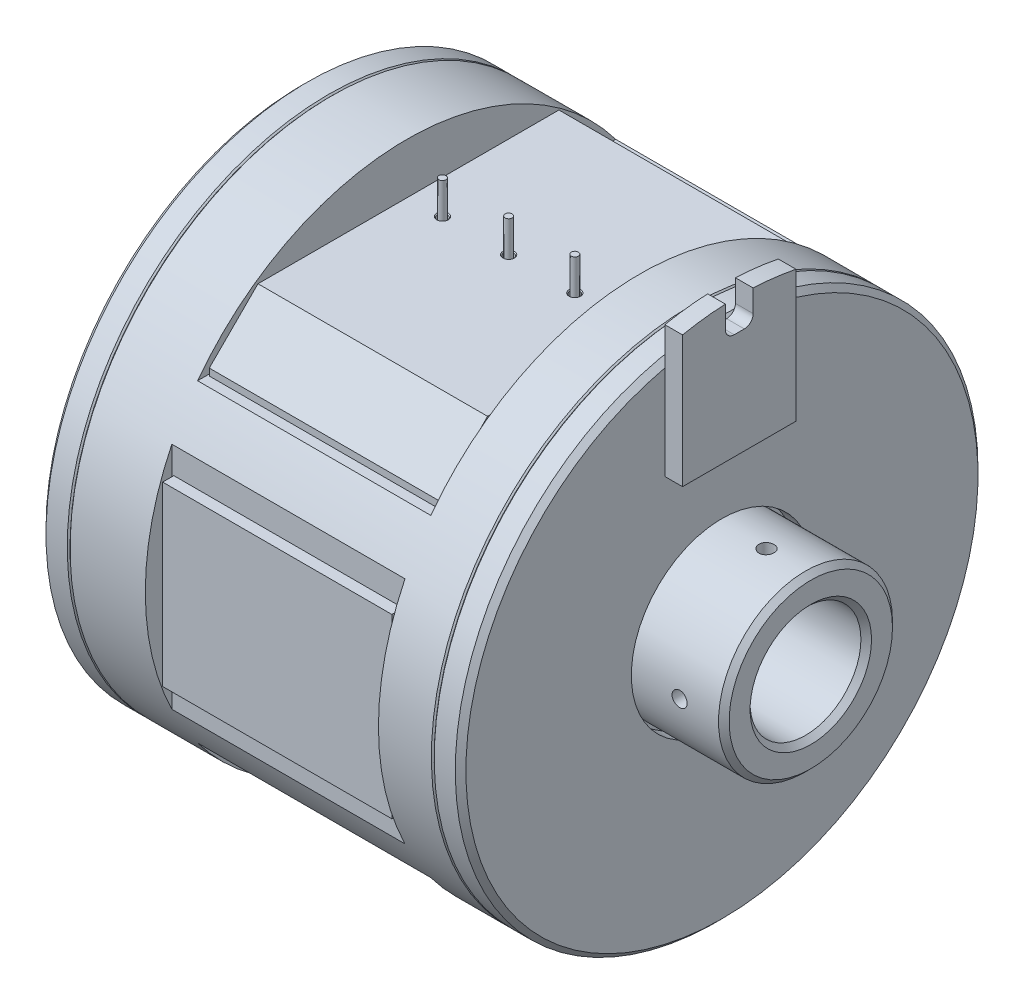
ISO-10303-21;
HEADER;
FILE_DESCRIPTION(('STEP AP214'),'2;1');
FILE_NAME('part.step','',(''),(''),'','','');
FILE_SCHEMA(('AUTOMOTIVE_DESIGN { 1 0 10303 214 1 1 1 1 }'));
ENDSEC;
DATA;
#1=APPLICATION_CONTEXT('core data for automotive mechanical design processes');
#2=APPLICATION_PROTOCOL_DEFINITION('international standard','automotive_design',2000,#1);
#3=PRODUCT_CONTEXT('',#1,'mechanical');
#4=PRODUCT('Part','Part','',(#3));
#5=PRODUCT_RELATED_PRODUCT_CATEGORY('part','',(#4));
#6=PRODUCT_DEFINITION_FORMATION('','',#4);
#7=PRODUCT_DEFINITION_CONTEXT('part definition',#1,'design');
#8=PRODUCT_DEFINITION('design','',#6,#7);
#9=PRODUCT_DEFINITION_SHAPE('','',#8);
#10=(LENGTH_UNIT() NAMED_UNIT(*) SI_UNIT(.MILLI.,.METRE.));
#11=(NAMED_UNIT(*) PLANE_ANGLE_UNIT() SI_UNIT($,.RADIAN.));
#12=(NAMED_UNIT(*) SI_UNIT($,.STERADIAN.) SOLID_ANGLE_UNIT());
#13=UNCERTAINTY_MEASURE_WITH_UNIT(LENGTH_MEASURE(1.E-05),#10,'distance_accuracy_value','');
#14=(GEOMETRIC_REPRESENTATION_CONTEXT(3) GLOBAL_UNCERTAINTY_ASSIGNED_CONTEXT((#13)) GLOBAL_UNIT_ASSIGNED_CONTEXT((#10,
#11,#12)) REPRESENTATION_CONTEXT('',''));
#15=CARTESIAN_POINT('',(0.,0.,0.));
#16=DIRECTION('',(0.,0.,1.));
#17=DIRECTION('',(1.,0.,0.));
#18=AXIS2_PLACEMENT_3D('',#15,#16,#17);
#19=CARTESIAN_POINT('',(15.0114,22.5044,30.0005748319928));
#20=DIRECTION('',(0.,-1.,0.));
#21=DIRECTION('',(0.,0.,-1.));
#22=AXIS2_PLACEMENT_3D('',#19,#20,#21);
#23=PLANE('',#22);
#24=DIRECTION('',(0.,0.,-1.));
#25=VECTOR('',#24,1.);
#26=CARTESIAN_POINT('',(48.4632,22.5044,30.0005748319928));
#27=LINE('',#26,#25);
#28=CARTESIAN_POINT('',(48.4632,22.5044,30.0005748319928));
#29=VERTEX_POINT('',#28);
#30=CARTESIAN_POINT('',(48.4632,22.5044,-30.0005748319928));
#31=VERTEX_POINT('',#30);
#32=EDGE_CURVE('E1569',#29,#31,#27,.T.);
#33=ORIENTED_EDGE('',*,*,#32,.T.);
#34=DIRECTION('',(1.,0.,0.));
#35=VECTOR('',#34,1.);
#36=CARTESIAN_POINT('',(15.0114,22.5044,-30.0005748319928));
#37=LINE('',#36,#35);
#38=CARTESIAN_POINT('',(15.0114,22.5044,-30.0005748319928));
#39=VERTEX_POINT('',#38);
#40=EDGE_CURVE('E1562',#39,#31,#37,.T.);
#41=ORIENTED_EDGE('',*,*,#40,.F.);
#42=DIRECTION('',(0.,0.,-1.));
#43=VECTOR('',#42,1.);
#44=CARTESIAN_POINT('',(15.0114,22.5044,30.0005748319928));
#45=LINE('',#44,#43);
#46=CARTESIAN_POINT('',(15.0114,22.5044,30.0005748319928));
#47=VERTEX_POINT('',#46);
#48=EDGE_CURVE('E1566',#47,#39,#45,.T.);
#49=ORIENTED_EDGE('',*,*,#48,.F.);
#50=DIRECTION('',(1.,0.,0.));
#51=VECTOR('',#50,1.);
#52=CARTESIAN_POINT('',(15.0114,22.5044,30.0005748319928));
#53=LINE('',#52,#51);
#54=EDGE_CURVE('E1563',#47,#29,#53,.T.);
#55=ORIENTED_EDGE('',*,*,#54,.T.);
#56=EDGE_LOOP('',(#33,#41,#49,#55));
#57=FACE_BOUND('',#56,.T.);
#58=DIRECTION('',(0.,0.,1.));
#59=VECTOR('',#58,1.);
#60=CARTESIAN_POINT('',(48.2092,22.5044,-28.575));
#61=LINE('',#60,#59);
#62=CARTESIAN_POINT('',(48.2092,22.5044,-28.575));
#63=VERTEX_POINT('',#62);
#64=CARTESIAN_POINT('',(48.2092,22.5044,28.575));
#65=VERTEX_POINT('',#64);
#66=EDGE_CURVE('E1582',#63,#65,#61,.T.);
#67=ORIENTED_EDGE('',*,*,#66,.T.);
#68=DIRECTION('',(-1.,0.,0.));
#69=VECTOR('',#68,1.);
#70=CARTESIAN_POINT('',(48.2092,22.5044,28.575));
#71=LINE('',#70,#69);
#72=CARTESIAN_POINT('',(15.2654,22.5044,28.575));
#73=VERTEX_POINT('',#72);
#74=EDGE_CURVE('E1575',#65,#73,#71,.T.);
#75=ORIENTED_EDGE('',*,*,#74,.T.);
#76=DIRECTION('',(0.,0.,1.));
#77=VECTOR('',#76,1.);
#78=CARTESIAN_POINT('',(15.2654,22.5044,-28.575));
#79=LINE('',#78,#77);
#80=CARTESIAN_POINT('',(15.2654,22.5044,-28.575));
#81=VERTEX_POINT('',#80);
#82=EDGE_CURVE('E1593',#81,#73,#79,.T.);
#83=ORIENTED_EDGE('',*,*,#82,.F.);
#84=DIRECTION('',(-1.,0.,0.));
#85=VECTOR('',#84,1.);
#86=CARTESIAN_POINT('',(48.2092,22.5044,-28.575));
#87=LINE('',#86,#85);
#88=EDGE_CURVE('E1588',#63,#81,#87,.T.);
#89=ORIENTED_EDGE('',*,*,#88,.F.);
#90=EDGE_LOOP('',(#67,#75,#83,#89));
#91=FACE_BOUND('',#90,.T.);
#92=ADVANCED_FACE('F47',(#57,#91),#23,.F.);
#93=CARTESIAN_POINT('',(30.1244,0.,0.));
#94=DIRECTION('',(1.,0.,0.));
#95=DIRECTION('',(0.,0.,-1.));
#96=AXIS2_PLACEMENT_3D('',#93,#94,#95);
#97=CYLINDRICAL_SURFACE('',#96,37.5031);
#98=DIRECTION('',(-1.,0.,0.));
#99=VECTOR('',#98,1.);
#100=CARTESIAN_POINT('',(48.4632000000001,-22.5044,30.0005748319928));
#101=LINE('',#100,#99);
#102=CARTESIAN_POINT('',(48.4632000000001,-22.5044,30.0005748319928));
#103=VERTEX_POINT('',#102);
#104=CARTESIAN_POINT('',(15.0114,-22.5044,30.0005748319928));
#105=VERTEX_POINT('',#104);
#106=EDGE_CURVE('E1489',#103,#105,#101,.T.);
#107=ORIENTED_EDGE('',*,*,#106,.F.);
#108=CARTESIAN_POINT('',(48.4632000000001,0.,0.));
#109=DIRECTION('',(-1.,0.,0.));
#110=DIRECTION('',(0.,0.,1.));
#111=AXIS2_PLACEMENT_3D('',#108,#109,#110);
#112=CIRCLE('',#111,37.5031);
#113=CARTESIAN_POINT('',(48.4632000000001,-22.5044,-30.0005748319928));
#114=VERTEX_POINT('',#113);
#115=EDGE_CURVE('E1498',#114,#103,#112,.T.);
#116=ORIENTED_EDGE('',*,*,#115,.F.);
#117=DIRECTION('',(-1.,0.,0.));
#118=VECTOR('',#117,1.);
#119=CARTESIAN_POINT('',(48.4632000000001,-22.5044,-30.0005748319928));
#120=LINE('',#119,#118);
#121=CARTESIAN_POINT('',(15.0114,-22.5044,-30.0005748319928));
#122=VERTEX_POINT('',#121);
#123=EDGE_CURVE('E1488',#114,#122,#120,.T.);
#124=ORIENTED_EDGE('',*,*,#123,.T.);
#125=CARTESIAN_POINT('',(15.0114,0.,0.));
#126=DIRECTION('',(-1.,0.,0.));
#127=DIRECTION('',(0.,0.,1.));
#128=AXIS2_PLACEMENT_3D('',#125,#126,#127);
#129=CIRCLE('',#128,37.5031);
#130=EDGE_CURVE('E1499',#122,#105,#129,.T.);
#131=ORIENTED_EDGE('',*,*,#130,.T.);
#132=EDGE_LOOP('',(#107,#116,#124,#131));
#133=FACE_BOUND('',#132,.T.);
#134=DIRECTION('',(-1.,0.,0.));
#135=VECTOR('',#134,1.);
#136=CARTESIAN_POINT('',(48.4632,16.4698974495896,33.6931));
#137=LINE('',#136,#135);
#138=CARTESIAN_POINT('',(48.4632,16.4698974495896,33.6931));
#139=VERTEX_POINT('',#138);
#140=CARTESIAN_POINT('',(15.0114,16.4698974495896,33.6931));
#141=VERTEX_POINT('',#140);
#142=EDGE_CURVE('E1359',#139,#141,#137,.T.);
#143=ORIENTED_EDGE('',*,*,#142,.F.);
#144=CARTESIAN_POINT('',(48.4632,0.,0.));
#145=DIRECTION('',(-1.,0.,0.));
#146=DIRECTION('',(0.,0.,1.));
#147=AXIS2_PLACEMENT_3D('',#144,#145,#146);
#148=CIRCLE('',#147,37.5031);
#149=CARTESIAN_POINT('',(48.4632,-16.4698974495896,33.6931));
#150=VERTEX_POINT('',#149);
#151=EDGE_CURVE('E1368',#150,#139,#148,.T.);
#152=ORIENTED_EDGE('',*,*,#151,.F.);
#153=DIRECTION('',(-1.,0.,0.));
#154=VECTOR('',#153,1.);
#155=CARTESIAN_POINT('',(48.4632,-16.4698974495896,33.6931));
#156=LINE('',#155,#154);
#157=CARTESIAN_POINT('',(15.0114,-16.4698974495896,33.6931));
#158=VERTEX_POINT('',#157);
#159=EDGE_CURVE('E1358',#150,#158,#156,.T.);
#160=ORIENTED_EDGE('',*,*,#159,.T.);
#161=CARTESIAN_POINT('',(15.0114,0.,0.));
#162=DIRECTION('',(-1.,0.,0.));
#163=DIRECTION('',(0.,0.,1.));
#164=AXIS2_PLACEMENT_3D('',#161,#162,#163);
#165=CIRCLE('',#164,37.5031);
#166=EDGE_CURVE('E1369',#158,#141,#165,.T.);
#167=ORIENTED_EDGE('',*,*,#166,.T.);
#168=EDGE_LOOP('',(#143,#152,#160,#167));
#169=FACE_BOUND('',#168,.T.);
#170=CARTESIAN_POINT('',(4.2164,0.,0.));
#171=DIRECTION('',(1.,0.,0.));
#172=DIRECTION('',(0.,0.,-1.));
#173=AXIS2_PLACEMENT_3D('',#170,#171,#172);
#174=CIRCLE('',#173,37.5031);
#175=CARTESIAN_POINT('',(4.2164,0.,-37.5031));
#176=VERTEX_POINT('',#175);
#177=EDGE_CURVE('E834',#176,#176,#174,.T.);
#178=ORIENTED_EDGE('',*,*,#177,.T.);
#179=EDGE_LOOP('',(#178));
#180=FACE_BOUND('',#179,.T.);
#181=CARTESIAN_POINT('',(56.0578,0.,0.));
#182=DIRECTION('',(1.,0.,0.));
#183=DIRECTION('',(0.,0.,-1.));
#184=AXIS2_PLACEMENT_3D('',#181,#182,#183);
#185=CIRCLE('',#184,37.5031);
#186=CARTESIAN_POINT('',(56.0578,0.,-37.5031));
#187=VERTEX_POINT('',#186);
#188=EDGE_CURVE('E873',#187,#187,#185,.F.);
#189=ORIENTED_EDGE('',*,*,#188,.T.);
#190=EDGE_LOOP('',(#189));
#191=FACE_BOUND('',#190,.T.);
#192=DIRECTION('',(1.,0.,0.));
#193=VECTOR('',#192,1.);
#194=CARTESIAN_POINT('',(15.0114,16.4698974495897,-33.6931));
#195=LINE('',#194,#193);
#196=CARTESIAN_POINT('',(15.0114,16.4698974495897,-33.6931));
#197=VERTEX_POINT('',#196);
#198=CARTESIAN_POINT('',(48.4632,16.4698974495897,-33.6931));
#199=VERTEX_POINT('',#198);
#200=EDGE_CURVE('E1409',#197,#199,#195,.T.);
#201=ORIENTED_EDGE('',*,*,#200,.F.);
#202=CARTESIAN_POINT('',(15.0114,0.,0.));
#203=DIRECTION('',(1.,0.,0.));
#204=DIRECTION('',(0.,0.,-1.));
#205=AXIS2_PLACEMENT_3D('',#202,#203,#204);
#206=CIRCLE('',#205,37.5031);
#207=CARTESIAN_POINT('',(15.0114,-16.4698974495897,-33.6931));
#208=VERTEX_POINT('',#207);
#209=EDGE_CURVE('E1418',#208,#197,#206,.T.);
#210=ORIENTED_EDGE('',*,*,#209,.F.);
#211=DIRECTION('',(1.,0.,0.));
#212=VECTOR('',#211,1.);
#213=CARTESIAN_POINT('',(15.0114,-16.4698974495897,-33.6931));
#214=LINE('',#213,#212);
#215=CARTESIAN_POINT('',(48.4632,-16.4698974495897,-33.6931));
#216=VERTEX_POINT('',#215);
#217=EDGE_CURVE('E1401',#208,#216,#214,.T.);
#218=ORIENTED_EDGE('',*,*,#217,.T.);
#219=CARTESIAN_POINT('',(48.4632,0.,0.));
#220=DIRECTION('',(1.,0.,0.));
#221=DIRECTION('',(0.,0.,-1.));
#222=AXIS2_PLACEMENT_3D('',#219,#220,#221);
#223=CIRCLE('',#222,37.5031);
#224=EDGE_CURVE('E1419',#216,#199,#223,.T.);
#225=ORIENTED_EDGE('',*,*,#224,.T.);
#226=EDGE_LOOP('',(#201,#210,#218,#225));
#227=FACE_BOUND('',#226,.T.);
#228=ORIENTED_EDGE('',*,*,#54,.F.);
#229=CARTESIAN_POINT('',(15.0114,0.,0.));
#230=DIRECTION('',(1.,0.,0.));
#231=DIRECTION('',(0.,0.,-1.));
#232=AXIS2_PLACEMENT_3D('',#229,#230,#231);
#233=CIRCLE('',#232,37.5031);
#234=EDGE_CURVE('E1571',#39,#47,#233,.T.);
#235=ORIENTED_EDGE('',*,*,#234,.F.);
#236=ORIENTED_EDGE('',*,*,#40,.T.);
#237=CARTESIAN_POINT('',(48.4632,0.,0.));
#238=DIRECTION('',(1.,0.,0.));
#239=DIRECTION('',(0.,0.,-1.));
#240=AXIS2_PLACEMENT_3D('',#237,#238,#239);
#241=CIRCLE('',#240,37.5031);
#242=EDGE_CURVE('E1572',#31,#29,#241,.T.);
#243=ORIENTED_EDGE('',*,*,#242,.T.);
#244=EDGE_LOOP('',(#228,#235,#236,#243));
#245=FACE_BOUND('',#244,.T.);
#246=ADVANCED_FACE('F412',(#133,#169,#180,#191,#227,#245),#97,.T.);
#247=CARTESIAN_POINT('',(48.4632000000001,-22.5044,30.0005748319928));
#248=DIRECTION('',(0.,1.,0.));
#249=DIRECTION('',(0.,0.,1.));
#250=AXIS2_PLACEMENT_3D('',#247,#248,#249);
#251=PLANE('',#250);
#252=DIRECTION('',(0.,0.,-1.));
#253=VECTOR('',#252,1.);
#254=CARTESIAN_POINT('',(15.0114,-22.5044,30.0005748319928));
#255=LINE('',#254,#253);
#256=EDGE_CURVE('E1495',#105,#122,#255,.T.);
#257=ORIENTED_EDGE('',*,*,#256,.T.);
#258=ORIENTED_EDGE('',*,*,#123,.F.);
#259=DIRECTION('',(0.,0.,-1.));
#260=VECTOR('',#259,1.);
#261=CARTESIAN_POINT('',(48.4632000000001,-22.5044,30.0005748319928));
#262=LINE('',#261,#260);
#263=EDGE_CURVE('E1492',#103,#114,#262,.T.);
#264=ORIENTED_EDGE('',*,*,#263,.F.);
#265=ORIENTED_EDGE('',*,*,#106,.T.);
#266=EDGE_LOOP('',(#257,#258,#264,#265));
#267=FACE_BOUND('',#266,.T.);
#268=DIRECTION('',(0.,0.,1.));
#269=VECTOR('',#268,1.);
#270=CARTESIAN_POINT('',(15.2654,-22.5044,-28.575));
#271=LINE('',#270,#269);
#272=CARTESIAN_POINT('',(15.2654,-22.5044,-28.575));
#273=VERTEX_POINT('',#272);
#274=CARTESIAN_POINT('',(15.2654,-22.5044,28.575));
#275=VERTEX_POINT('',#274);
#276=EDGE_CURVE('E1509',#273,#275,#271,.T.);
#277=ORIENTED_EDGE('',*,*,#276,.T.);
#278=DIRECTION('',(1.,0.,0.));
#279=VECTOR('',#278,1.);
#280=CARTESIAN_POINT('',(15.2654,-22.5044,28.575));
#281=LINE('',#280,#279);
#282=CARTESIAN_POINT('',(48.2092,-22.5044,28.575));
#283=VERTEX_POINT('',#282);
#284=EDGE_CURVE('E1502',#275,#283,#281,.T.);
#285=ORIENTED_EDGE('',*,*,#284,.T.);
#286=DIRECTION('',(0.,0.,1.));
#287=VECTOR('',#286,1.);
#288=CARTESIAN_POINT('',(48.2092,-22.5044,-28.575));
#289=LINE('',#288,#287);
#290=CARTESIAN_POINT('',(48.2092,-22.5044,-28.575));
#291=VERTEX_POINT('',#290);
#292=EDGE_CURVE('E1520',#291,#283,#289,.T.);
#293=ORIENTED_EDGE('',*,*,#292,.F.);
#294=DIRECTION('',(1.,0.,0.));
#295=VECTOR('',#294,1.);
#296=CARTESIAN_POINT('',(15.2654,-22.5044,-28.575));
#297=LINE('',#296,#295);
#298=EDGE_CURVE('E1515',#273,#291,#297,.T.);
#299=ORIENTED_EDGE('',*,*,#298,.F.);
#300=EDGE_LOOP('',(#277,#285,#293,#299));
#301=FACE_BOUND('',#300,.T.);
#302=ADVANCED_FACE('F418',(#267,#301),#251,.F.);
#303=CARTESIAN_POINT('',(2.28599999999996,0.,0.));
#304=DIRECTION('',(1.,0.,0.));
#305=DIRECTION('',(0.,0.,-1.));
#306=AXIS2_PLACEMENT_3D('',#303,#304,#305);
#307=PLANE('',#306);
#308=CARTESIAN_POINT('',(2.286,0.,0.));
#309=DIRECTION('',(-1.,0.,0.));
#310=DIRECTION('',(0.,0.,1.));
#311=AXIS2_PLACEMENT_3D('',#308,#309,#310);
#312=CIRCLE('',#311,20.4978);
#313=CARTESIAN_POINT('',(2.286,0.,20.4978));
#314=VERTEX_POINT('',#313);
#315=EDGE_CURVE('E1451',#314,#314,#312,.T.);
#316=ORIENTED_EDGE('',*,*,#315,.T.);
#317=EDGE_LOOP('',(#316));
#318=FACE_BOUND('',#317,.T.);
#319=CARTESIAN_POINT('',(2.28599999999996,0.,0.));
#320=DIRECTION('',(1.,0.,0.));
#321=DIRECTION('',(0.,0.,-1.));
#322=AXIS2_PLACEMENT_3D('',#319,#320,#321);
#323=CIRCLE('',#322,19.9771);
#324=CARTESIAN_POINT('',(2.28599999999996,0.,-19.9771));
#325=VERTEX_POINT('',#324);
#326=EDGE_CURVE('E831',#325,#325,#323,.F.);
#327=ORIENTED_EDGE('',*,*,#326,.F.);
#328=EDGE_LOOP('',(#327));
#329=FACE_BOUND('',#328,.T.);
#330=ADVANCED_FACE('F491',(#318,#329),#307,.F.);
#331=CARTESIAN_POINT('',(15.0114,16.4698974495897,-33.6931));
#332=DIRECTION('',(0.,0.,1.));
#333=DIRECTION('',(0.,-1.,0.));
#334=AXIS2_PLACEMENT_3D('',#331,#332,#333);
#335=PLANE('',#334);
#336=DIRECTION('',(0.,-1.,0.));
#337=VECTOR('',#336,1.);
#338=CARTESIAN_POINT('',(48.4632,16.4698974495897,-33.6931));
#339=LINE('',#338,#337);
#340=EDGE_CURVE('E1415',#199,#216,#339,.T.);
#341=ORIENTED_EDGE('',*,*,#340,.T.);
#342=ORIENTED_EDGE('',*,*,#217,.F.);
#343=DIRECTION('',(0.,-1.,0.));
#344=VECTOR('',#343,1.);
#345=CARTESIAN_POINT('',(15.0114,16.4698974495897,-33.6931));
#346=LINE('',#345,#344);
#347=EDGE_CURVE('E1412',#197,#208,#346,.T.);
#348=ORIENTED_EDGE('',*,*,#347,.F.);
#349=ORIENTED_EDGE('',*,*,#200,.T.);
#350=EDGE_LOOP('',(#341,#342,#348,#349));
#351=FACE_BOUND('',#350,.T.);
#352=DIRECTION('',(-1.,0.,0.));
#353=VECTOR('',#352,1.);
#354=CARTESIAN_POINT('',(15.2908,-12.7,-33.6931));
#355=LINE('',#354,#353);
#356=CARTESIAN_POINT('',(48.1838,-12.7,-33.6931));
#357=VERTEX_POINT('',#356);
#358=CARTESIAN_POINT('',(15.2908,-12.7,-33.6931));
#359=VERTEX_POINT('',#358);
#360=EDGE_CURVE('E1448',#357,#359,#355,.T.);
#361=ORIENTED_EDGE('',*,*,#360,.F.);
#362=DIRECTION('',(0.,-1.,0.));
#363=VECTOR('',#362,1.);
#364=CARTESIAN_POINT('',(48.1838,-12.7,-33.6931));
#365=LINE('',#364,#363);
#366=CARTESIAN_POINT('',(48.1838,12.7,-33.6931));
#367=VERTEX_POINT('',#366);
#368=EDGE_CURVE('E1438',#367,#357,#365,.T.);
#369=ORIENTED_EDGE('',*,*,#368,.F.);
#370=DIRECTION('',(1.,0.,0.));
#371=VECTOR('',#370,1.);
#372=CARTESIAN_POINT('',(48.1838,12.7,-33.6931));
#373=LINE('',#372,#371);
#374=CARTESIAN_POINT('',(15.2908,12.7,-33.6931));
#375=VERTEX_POINT('',#374);
#376=EDGE_CURVE('E1442',#375,#367,#373,.T.);
#377=ORIENTED_EDGE('',*,*,#376,.F.);
#378=DIRECTION('',(0.,1.,0.));
#379=VECTOR('',#378,1.);
#380=CARTESIAN_POINT('',(15.2908,12.7,-33.6931));
#381=LINE('',#380,#379);
#382=EDGE_CURVE('E1445',#359,#375,#381,.T.);
#383=ORIENTED_EDGE('',*,*,#382,.F.);
#384=EDGE_LOOP('',(#361,#369,#377,#383));
#385=FACE_BOUND('',#384,.T.);
#386=ADVANCED_FACE('F563',(#351,#385),#335,.F.);
#387=CARTESIAN_POINT('',(48.4632,16.4698974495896,33.6931));
#388=DIRECTION('',(0.,0.,-1.));
#389=DIRECTION('',(-1.,0.,0.));
#390=AXIS2_PLACEMENT_3D('',#387,#388,#389);
#391=PLANE('',#390);
#392=DIRECTION('',(0.,-1.,0.));
#393=VECTOR('',#392,1.);
#394=CARTESIAN_POINT('',(15.0114,16.4698974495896,33.6931));
#395=LINE('',#394,#393);
#396=EDGE_CURVE('E1365',#141,#158,#395,.T.);
#397=ORIENTED_EDGE('',*,*,#396,.T.);
#398=ORIENTED_EDGE('',*,*,#159,.F.);
#399=DIRECTION('',(0.,-1.,0.));
#400=VECTOR('',#399,1.);
#401=CARTESIAN_POINT('',(48.4632,16.4698974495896,33.6931));
#402=LINE('',#401,#400);
#403=EDGE_CURVE('E1362',#139,#150,#402,.T.);
#404=ORIENTED_EDGE('',*,*,#403,.F.);
#405=ORIENTED_EDGE('',*,*,#142,.T.);
#406=EDGE_LOOP('',(#397,#398,#404,#405));
#407=FACE_BOUND('',#406,.T.);
#408=DIRECTION('',(-1.,0.,0.));
#409=VECTOR('',#408,1.);
#410=CARTESIAN_POINT('',(15.2908,12.7,33.6931));
#411=LINE('',#410,#409);
#412=CARTESIAN_POINT('',(48.1838,12.7,33.6931));
#413=VERTEX_POINT('',#412);
#414=CARTESIAN_POINT('',(15.2908,12.7,33.6931));
#415=VERTEX_POINT('',#414);
#416=EDGE_CURVE('E1398',#413,#415,#411,.T.);
#417=ORIENTED_EDGE('',*,*,#416,.F.);
#418=DIRECTION('',(0.,1.,0.));
#419=VECTOR('',#418,1.);
#420=CARTESIAN_POINT('',(48.1838,12.7,33.6931));
#421=LINE('',#420,#419);
#422=CARTESIAN_POINT('',(48.1838,-12.7,33.6931));
#423=VERTEX_POINT('',#422);
#424=EDGE_CURVE('E1388',#423,#413,#421,.T.);
#425=ORIENTED_EDGE('',*,*,#424,.F.);
#426=DIRECTION('',(1.,0.,0.));
#427=VECTOR('',#426,1.);
#428=CARTESIAN_POINT('',(48.1838,-12.7,33.6931));
#429=LINE('',#428,#427);
#430=CARTESIAN_POINT('',(15.2908,-12.7,33.6931));
#431=VERTEX_POINT('',#430);
#432=EDGE_CURVE('E1392',#431,#423,#429,.T.);
#433=ORIENTED_EDGE('',*,*,#432,.F.);
#434=DIRECTION('',(0.,-1.,0.));
#435=VECTOR('',#434,1.);
#436=CARTESIAN_POINT('',(15.2908,-12.7,33.6931));
#437=LINE('',#436,#435);
#438=EDGE_CURVE('E1395',#415,#431,#437,.T.);
#439=ORIENTED_EDGE('',*,*,#438,.F.);
#440=EDGE_LOOP('',(#417,#425,#433,#439));
#441=FACE_BOUND('',#440,.T.);
#442=ADVANCED_FACE('F595',(#407,#441),#391,.F.);
#443=CARTESIAN_POINT('',(60.2488,25.25395,0.));
#444=DIRECTION('',(1.,0.,0.));
#445=DIRECTION('',(0.,0.,-1.));
#446=AXIS2_PLACEMENT_3D('',#443,#444,#445);
#447=PLANE('',#446);
#448=DIRECTION('',(0.,1.,0.));
#449=VECTOR('',#448,1.);
#450=CARTESIAN_POINT('',(60.2488,41.2148439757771,-8.08287442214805));
#451=LINE('',#450,#449);
#452=CARTESIAN_POINT('',(60.2488,22.3264083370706,-8.08287442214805));
#453=VERTEX_POINT('',#452);
#454=CARTESIAN_POINT('',(60.248800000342,35.8409761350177,-8.08287442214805));
#455=VERTEX_POINT('',#454);
#456=EDGE_CURVE('E65',#453,#455,#451,.T.);
#457=ORIENTED_EDGE('',*,*,#456,.F.);
#458=DIRECTION('',(0.,0.,-1.));
#459=VECTOR('',#458,1.);
#460=CARTESIAN_POINT('',(60.2488,22.3264083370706,8.19522622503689));
#461=LINE('',#460,#459);
#462=CARTESIAN_POINT('',(60.2488,22.3264083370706,8.19522622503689));
#463=VERTEX_POINT('',#462);
#464=EDGE_CURVE('E319',#463,#453,#461,.T.);
#465=ORIENTED_EDGE('',*,*,#464,.F.);
#466=DIRECTION('',(0.,-1.,0.));
#467=VECTOR('',#466,1.);
#468=CARTESIAN_POINT('',(60.2488,41.1926509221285,8.19522622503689));
#469=LINE('',#468,#467);
#470=CARTESIAN_POINT('',(60.248800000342,35.8154533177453,8.19522622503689));
#471=VERTEX_POINT('',#470);
#472=EDGE_CURVE('E13',#471,#463,#469,.T.);
#473=ORIENTED_EDGE('',*,*,#472,.F.);
#474=CARTESIAN_POINT('',(60.248800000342,0.,0.));
#475=DIRECTION('',(-1.,0.,0.));
#476=DIRECTION('',(0.,0.,1.));
#477=AXIS2_PLACEMENT_3D('',#474,#475,#476);
#478=CIRCLE('',#477,36.7411000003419);
#479=EDGE_CURVE('E70',#455,#471,#478,.T.);
#480=ORIENTED_EDGE('',*,*,#479,.F.);
#481=EDGE_LOOP('',(#457,#465,#473,#480));
#482=FACE_BOUND('',#481,.T.);
#483=CARTESIAN_POINT('',(60.2488,0.,0.));
#484=DIRECTION('',(1.,0.,0.));
#485=DIRECTION('',(0.,0.,-1.));
#486=AXIS2_PLACEMENT_3D('',#483,#484,#485);
#487=CIRCLE('',#486,13.0048);
#488=CARTESIAN_POINT('',(60.2488,0.,-13.0048));
#489=VERTEX_POINT('',#488);
#490=EDGE_CURVE('E1485',#489,#489,#487,.T.);
#491=ORIENTED_EDGE('',*,*,#490,.F.);
#492=EDGE_LOOP('',(#491));
#493=FACE_BOUND('',#492,.T.);
#494=ADVANCED_FACE('F627',(#482,#493),#447,.T.);
#495=CARTESIAN_POINT('',(59.4867999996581,0.,0.));
#496=DIRECTION('',(-1.,0.,0.));
#497=DIRECTION('',(0.,0.,1.));
#498=AXIS2_PLACEMENT_3D('',#495,#496,#497);
#499=CONICAL_SURFACE('',#498,37.5030999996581,0.7853981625);
#500=EDGE_CURVE('E835',#471,#455,#478,.T.);
#501=ORIENTED_EDGE('',*,*,#500,.T.);
#502=ORIENTED_EDGE('',*,*,#479,.T.);
#503=EDGE_LOOP('',(#501,#502));
#504=FACE_BOUND('',#503,.T.);
#505=CARTESIAN_POINT('',(59.4868,0.,0.));
#506=DIRECTION('',(1.,0.,0.));
#507=DIRECTION('',(0.,0.,-1.));
#508=AXIS2_PLACEMENT_3D('',#505,#506,#507);
#509=CIRCLE('',#508,37.5031);
#510=CARTESIAN_POINT('',(59.4868,0.,-37.5031));
#511=VERTEX_POINT('',#510);
#512=EDGE_CURVE('E839',#511,#511,#509,.F.);
#513=ORIENTED_EDGE('',*,*,#512,.F.);
#514=EDGE_LOOP('',(#513));
#515=FACE_BOUND('',#514,.T.);
#516=ADVANCED_FACE('F655',(#504,#515),#499,.T.);
#517=CARTESIAN_POINT('',(30.1244,0.,0.));
#518=DIRECTION('',(1.,0.,0.));
#519=DIRECTION('',(0.,0.,-1.));
#520=AXIS2_PLACEMENT_3D('',#517,#518,#519);
#521=CYLINDRICAL_SURFACE('',#520,37.5031);
#522=ORIENTED_EDGE('',*,*,#512,.T.);
#523=EDGE_LOOP('',(#522));
#524=FACE_BOUND('',#523,.T.);
#525=CARTESIAN_POINT('',(56.4642000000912,0.,0.));
#526=DIRECTION('',(1.,0.,0.));
#527=DIRECTION('',(0.,1.,0.));
#528=AXIS2_PLACEMENT_3D('',#525,#526,#527);
#529=CIRCLE('',#528,37.5030999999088);
#530=CARTESIAN_POINT('',(56.4642000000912,37.5030999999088,0.));
#531=VERTEX_POINT('',#530);
#532=EDGE_CURVE('E854',#531,#531,#529,.F.);
#533=ORIENTED_EDGE('',*,*,#532,.F.);
#534=EDGE_LOOP('',(#533));
#535=FACE_BOUND('',#534,.T.);
#536=ADVANCED_FACE('F651',(#524,#535),#521,.T.);
#537=CARTESIAN_POINT('',(56.4642000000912,0.,0.));
#538=DIRECTION('',(1.,0.,0.));
#539=DIRECTION('',(0.,0.,-1.));
#540=AXIS2_PLACEMENT_3D('',#537,#538,#539);
#541=CONICAL_SURFACE('',#540,37.5030999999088,0.785398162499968);
#542=ORIENTED_EDGE('',*,*,#532,.T.);
#543=EDGE_LOOP('',(#542));
#544=FACE_BOUND('',#543,.T.);
#545=CARTESIAN_POINT('',(56.2610000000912,0.,0.));
#546=DIRECTION('',(-1.,0.,0.));
#547=DIRECTION('',(0.,1.,0.));
#548=AXIS2_PLACEMENT_3D('',#545,#546,#547);
#549=CIRCLE('',#548,37.2999000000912);
#550=CARTESIAN_POINT('',(56.2610000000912,37.2999000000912,0.));
#551=VERTEX_POINT('',#550);
#552=EDGE_CURVE('E853',#551,#551,#549,.T.);
#553=ORIENTED_EDGE('',*,*,#552,.F.);
#554=EDGE_LOOP('',(#553));
#555=FACE_BOUND('',#554,.T.);
#556=ADVANCED_FACE('F647',(#544,#555),#541,.T.);
#557=CARTESIAN_POINT('',(3.80999999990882,0.,0.));
#558=DIRECTION('',(-1.,0.,0.));
#559=DIRECTION('',(0.,0.,1.));
#560=AXIS2_PLACEMENT_3D('',#557,#558,#559);
#561=CONICAL_SURFACE('',#560,37.5030999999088,0.785398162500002);
#562=CARTESIAN_POINT('',(4.01319999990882,0.,0.));
#563=DIRECTION('',(1.,0.,0.));
#564=DIRECTION('',(0.,1.,0.));
#565=AXIS2_PLACEMENT_3D('',#562,#563,#564);
#566=CIRCLE('',#565,37.2999000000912);
#567=CARTESIAN_POINT('',(4.01319999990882,37.2999000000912,0.));
#568=VERTEX_POINT('',#567);
#569=EDGE_CURVE('E867',#568,#568,#566,.T.);
#570=ORIENTED_EDGE('',*,*,#569,.F.);
#571=EDGE_LOOP('',(#570));
#572=FACE_BOUND('',#571,.T.);
#573=CARTESIAN_POINT('',(3.80999999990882,0.,0.));
#574=DIRECTION('',(-1.,0.,0.));
#575=DIRECTION('',(0.,0.,1.));
#576=AXIS2_PLACEMENT_3D('',#573,#574,#575);
#577=CIRCLE('',#576,37.5031);
#578=CARTESIAN_POINT('',(3.80999999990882,0.,-37.5031));
#579=VERTEX_POINT('',#578);
#580=EDGE_CURVE('E1354',#579,#579,#577,.T.);
#581=ORIENTED_EDGE('',*,*,#580,.F.);
#582=EDGE_LOOP('',(#581));
#583=FACE_BOUND('',#582,.T.);
#584=ADVANCED_FACE('F643',(#572,#583),#561,.T.);
#585=CARTESIAN_POINT('',(56.0577999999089,0.,0.));
#586=DIRECTION('',(-1.,0.,0.));
#587=DIRECTION('',(0.,0.,1.));
#588=AXIS2_PLACEMENT_3D('',#585,#586,#587);
#589=CONICAL_SURFACE('',#588,37.5030999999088,0.785398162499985);
#590=ORIENTED_EDGE('',*,*,#552,.T.);
#591=EDGE_LOOP('',(#590));
#592=FACE_BOUND('',#591,.T.);
#593=ORIENTED_EDGE('',*,*,#188,.F.);
#594=EDGE_LOOP('',(#593));
#595=FACE_BOUND('',#594,.T.);
#596=ADVANCED_FACE('F639',(#592,#595),#589,.T.);
#597=CARTESIAN_POINT('',(4.21640000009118,0.,0.));
#598=DIRECTION('',(1.,0.,0.));
#599=DIRECTION('',(0.,0.,-1.));
#600=AXIS2_PLACEMENT_3D('',#597,#598,#599);
#601=CONICAL_SURFACE('',#600,37.5030999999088,0.785398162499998);
#602=ORIENTED_EDGE('',*,*,#177,.F.);
#603=EDGE_LOOP('',(#602));
#604=FACE_BOUND('',#603,.T.);
#605=ORIENTED_EDGE('',*,*,#569,.T.);
#606=EDGE_LOOP('',(#605));
#607=FACE_BOUND('',#606,.T.);
#608=ADVANCED_FACE('F629',(#604,#607),#601,.T.);
#609=CARTESIAN_POINT('',(0.,0.,0.));
#610=DIRECTION('',(1.,0.,0.));
#611=DIRECTION('',(0.,0.,-1.));
#612=AXIS2_PLACEMENT_3D('',#609,#610,#611);
#613=CYLINDRICAL_SURFACE('',#612,37.5031);
#614=CARTESIAN_POINT('',(0.761999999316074,0.,0.));
#615=DIRECTION('',(-1.,0.,0.));
#616=DIRECTION('',(0.,0.,1.));
#617=AXIS2_PLACEMENT_3D('',#614,#615,#616);
#618=CIRCLE('',#617,37.5031);
#619=CARTESIAN_POINT('',(0.761999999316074,0.,-37.5031));
#620=VERTEX_POINT('',#619);
#621=EDGE_CURVE('E825',#620,#620,#618,.F.);
#622=CARTESIAN_POINT('',(0.761999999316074,0.,-37.5031));
#623=CARTESIAN_POINT('',(0.793749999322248,0.,-37.5031));
#624=CARTESIAN_POINT('',(0.825499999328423,0.,-37.5031));
#625=CARTESIAN_POINT('',(0.888999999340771,0.,-37.5031));
#626=CARTESIAN_POINT('',(0.920749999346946,0.,-37.5031));
#627=CARTESIAN_POINT('',(0.984249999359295,0.,-37.5031));
#628=CARTESIAN_POINT('',(1.01599999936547,0.,-37.5031));
#629=CARTESIAN_POINT('',(1.07949999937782,0.,-37.5031));
#630=CARTESIAN_POINT('',(1.11124999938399,0.,-37.5031));
#631=CARTESIAN_POINT('',(1.17474999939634,0.,-37.5031));
#632=CARTESIAN_POINT('',(1.20649999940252,0.,-37.5031));
#633=CARTESIAN_POINT('',(1.26999999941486,0.,-37.5031));
#634=CARTESIAN_POINT('',(1.30174999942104,0.,-37.5031));
#635=CARTESIAN_POINT('',(1.36524999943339,0.,-37.5031));
#636=CARTESIAN_POINT('',(1.39699999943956,0.,-37.5031));
#637=CARTESIAN_POINT('',(1.46049999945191,0.,-37.5031));
#638=CARTESIAN_POINT('',(1.49224999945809,0.,-37.5031));
#639=CARTESIAN_POINT('',(1.55574999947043,0.,-37.5031));
#640=CARTESIAN_POINT('',(1.58749999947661,0.,-37.5031));
#641=CARTESIAN_POINT('',(1.65099999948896,0.,-37.5031));
#642=CARTESIAN_POINT('',(1.68274999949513,0.,-37.5031));
#643=CARTESIAN_POINT('',(1.74624999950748,0.,-37.5031));
#644=CARTESIAN_POINT('',(1.77799999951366,0.,-37.5031));
#645=CARTESIAN_POINT('',(1.84149999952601,0.,-37.5031));
#646=CARTESIAN_POINT('',(1.87324999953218,0.,-37.5031));
#647=CARTESIAN_POINT('',(1.93674999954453,0.,-37.5031));
#648=CARTESIAN_POINT('',(1.9684999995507,0.,-37.5031));
#649=CARTESIAN_POINT('',(2.03199999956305,0.,-37.5031));
#650=CARTESIAN_POINT('',(2.06374999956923,0.,-37.5031));
#651=CARTESIAN_POINT('',(2.12724999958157,0.,-37.5031));
#652=CARTESIAN_POINT('',(2.15899999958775,0.,-37.5031));
#653=CARTESIAN_POINT('',(2.2224999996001,0.,-37.5031));
#654=CARTESIAN_POINT('',(2.25424999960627,0.,-37.5031));
#655=CARTESIAN_POINT('',(2.31774999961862,0.,-37.5031));
#656=CARTESIAN_POINT('',(2.3494999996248,0.,-37.5031));
#657=CARTESIAN_POINT('',(2.41299999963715,0.,-37.5031));
#658=CARTESIAN_POINT('',(2.44474999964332,0.,-37.5031));
#659=CARTESIAN_POINT('',(2.50824999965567,0.,-37.5031));
#660=CARTESIAN_POINT('',(2.53999999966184,0.,-37.5031));
#661=CARTESIAN_POINT('',(2.60349999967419,0.,-37.5031));
#662=CARTESIAN_POINT('',(2.63524999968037,0.,-37.5031));
#663=CARTESIAN_POINT('',(2.69874999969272,0.,-37.5031));
#664=CARTESIAN_POINT('',(2.73049999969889,0.,-37.5031));
#665=CARTESIAN_POINT('',(2.79399999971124,0.,-37.5031));
#666=CARTESIAN_POINT('',(2.82574999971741,0.,-37.5031));
#667=CARTESIAN_POINT('',(2.88924999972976,0.,-37.5031));
#668=CARTESIAN_POINT('',(2.92099999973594,0.,-37.5031));
#669=CARTESIAN_POINT('',(2.98449999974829,0.,-37.5031));
#670=CARTESIAN_POINT('',(3.01624999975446,0.,-37.5031));
#671=CARTESIAN_POINT('',(3.07974999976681,0.,-37.5031));
#672=CARTESIAN_POINT('',(3.11149999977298,0.,-37.5031));
#673=CARTESIAN_POINT('',(3.17499999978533,0.,-37.5031));
#674=CARTESIAN_POINT('',(3.20674999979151,0.,-37.5031));
#675=CARTESIAN_POINT('',(3.27024999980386,0.,-37.5031));
#676=CARTESIAN_POINT('',(3.30199999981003,0.,-37.5031));
#677=CARTESIAN_POINT('',(3.36549999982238,0.,-37.5031));
#678=CARTESIAN_POINT('',(3.39724999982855,0.,-37.5031));
#679=CARTESIAN_POINT('',(3.4607499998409,0.,-37.5031));
#680=CARTESIAN_POINT('',(3.49249999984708,0.,-37.5031));
#681=CARTESIAN_POINT('',(3.55599999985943,0.,-37.5031));
#682=CARTESIAN_POINT('',(3.5877499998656,0.,-37.5031));
#683=CARTESIAN_POINT('',(3.65124999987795,0.,-37.5031));
#684=CARTESIAN_POINT('',(3.68299999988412,0.,-37.5031));
#685=CARTESIAN_POINT('',(3.74649999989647,0.,-37.5031));
#686=CARTESIAN_POINT('',(3.77824999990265,0.,-37.5031));
#687=CARTESIAN_POINT('',(3.80999999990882,0.,-37.5031));
#688=B_SPLINE_CURVE_WITH_KNOTS('',3,(#622,#623,#624,#625,#626,#627,#628,#629,#630,#631,#632,
#633,#634,#635,#636,#637,#638,#639,#640,#641,#642,#643,#644,#645,#646,#647,#648,#649,#650,#651,
#652,#653,#654,#655,#656,#657,#658,#659,#660,#661,#662,#663,#664,#665,#666,#667,#668,#669,#670,
#671,#672,#673,#674,#675,#676,#677,#678,#679,#680,#681,#682,#683,#684,#685,#686,#687),
.UNSPECIFIED.,.F.,.F.,(4,2,2,2,2,2,2,2,2,2,2,2,2,2,2,2,2,2,2,2,2,2,2,2,2,2,2,2,2,2,2,2,4),(0.,
0.0952500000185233,0.190500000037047,0.28575000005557,0.381000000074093,0.476250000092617,
0.57150000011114,0.666750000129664,0.762000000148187,0.85725000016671,0.952500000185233,
1.04775000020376,1.14300000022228,1.2382500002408,1.33350000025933,1.42875000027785,
1.52400000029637,1.6192500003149,1.71450000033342,1.80975000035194,1.90500000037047,
2.00025000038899,2.09550000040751,2.19075000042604,2.28600000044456,2.38125000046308,
2.47650000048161,2.57175000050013,2.66700000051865,2.76225000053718,2.8575000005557,
2.95275000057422,3.04800000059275),.UNSPECIFIED.);
#689=EDGE_CURVE('BSEAM632',#620,#579,#688,.T.);
#690=ORIENTED_EDGE('',*,*,#621,.T.);
#691=ORIENTED_EDGE('',*,*,#580,.T.);
#692=ORIENTED_EDGE('',*,*,#689,.T.);
#693=ORIENTED_EDGE('',*,*,#689,.F.);
#694=EDGE_LOOP('',(#690,#692,#691,#693));
#695=FACE_BOUND('',#694,.T.);
#696=ADVANCED_FACE('F632',(#695),#613,.T.);
#697=CARTESIAN_POINT('',(0.,0.,0.));
#698=DIRECTION('',(-1.,0.,0.));
#699=DIRECTION('',(0.,0.,1.));
#700=AXIS2_PLACEMENT_3D('',#697,#698,#699);
#701=PLANE('',#700);
#702=CARTESIAN_POINT('',(0.,0.,0.));
#703=DIRECTION('',(-1.,0.,0.));
#704=DIRECTION('',(0.,0.,1.));
#705=AXIS2_PLACEMENT_3D('',#702,#703,#704);
#706=CIRCLE('',#705,36.7410999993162);
#707=CARTESIAN_POINT('',(0.,0.,36.7410999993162));
#708=VERTEX_POINT('',#707);
#709=EDGE_CURVE('E828',#708,#708,#706,.T.);
#710=ORIENTED_EDGE('',*,*,#709,.T.);
#711=EDGE_LOOP('',(#710));
#712=FACE_BOUND('',#711,.T.);
#713=CARTESIAN_POINT('',(0.,0.,0.));
#714=DIRECTION('',(-1.,0.,0.));
#715=DIRECTION('',(0.,0.,1.));
#716=AXIS2_PLACEMENT_3D('',#713,#714,#715);
#717=CIRCLE('',#716,20.4978);
#718=CARTESIAN_POINT('',(0.,0.,20.4978));
#719=VERTEX_POINT('',#718);
#720=EDGE_CURVE('E1461',#719,#719,#717,.T.);
#721=ORIENTED_EDGE('',*,*,#720,.F.);
#722=EDGE_LOOP('',(#721));
#723=FACE_BOUND('',#722,.T.);
#724=ADVANCED_FACE('F620',(#712,#723),#701,.T.);
#725=CARTESIAN_POINT('',(48.4632,0.,0.));
#726=DIRECTION('',(-1.,0.,0.));
#727=DIRECTION('',(0.,0.,1.));
#728=AXIS2_PLACEMENT_3D('',#725,#726,#727);
#729=PLANE('',#728);
#730=ORIENTED_EDGE('',*,*,#151,.T.);
#731=ORIENTED_EDGE('',*,*,#403,.T.);
#732=EDGE_LOOP('',(#730,#731));
#733=FACE_BOUND('',#732,.T.);
#734=ADVANCED_FACE('F617',(#733),#729,.T.);
#735=CARTESIAN_POINT('',(15.0114,0.,0.));
#736=DIRECTION('',(-1.,0.,0.));
#737=DIRECTION('',(0.,0.,1.));
#738=AXIS2_PLACEMENT_3D('',#735,#736,#737);
#739=PLANE('',#738);
#740=ORIENTED_EDGE('',*,*,#166,.F.);
#741=ORIENTED_EDGE('',*,*,#396,.F.);
#742=EDGE_LOOP('',(#740,#741));
#743=FACE_BOUND('',#742,.T.);
#744=ADVANCED_FACE('F615',(#743),#739,.F.);
#745=CARTESIAN_POINT('',(15.2908,12.7,35.2933));
#746=DIRECTION('',(0.,-1.,0.));
#747=DIRECTION('',(0.,0.,-1.));
#748=AXIS2_PLACEMENT_3D('',#745,#746,#747);
#749=PLANE('',#748);
#750=ORIENTED_EDGE('',*,*,#416,.T.);
#751=DIRECTION('',(0.,0.,-1.));
#752=VECTOR('',#751,1.);
#753=CARTESIAN_POINT('',(15.2908,12.7,35.2933));
#754=LINE('',#753,#752);
#755=CARTESIAN_POINT('',(15.2908,12.7,35.2933));
#756=VERTEX_POINT('',#755);
#757=EDGE_CURVE('E1372',#756,#415,#754,.T.);
#758=ORIENTED_EDGE('',*,*,#757,.F.);
#759=DIRECTION('',(-1.,0.,0.));
#760=VECTOR('',#759,1.);
#761=CARTESIAN_POINT('',(15.2908,12.7,35.2933));
#762=LINE('',#761,#760);
#763=CARTESIAN_POINT('',(48.1838,12.7,35.2933));
#764=VERTEX_POINT('',#763);
#765=EDGE_CURVE('E1391',#764,#756,#762,.T.);
#766=ORIENTED_EDGE('',*,*,#765,.F.);
#767=DIRECTION('',(0.,0.,-1.));
#768=VECTOR('',#767,1.);
#769=CARTESIAN_POINT('',(48.1838,12.7,35.2933));
#770=LINE('',#769,#768);
#771=EDGE_CURVE('E1384',#764,#413,#770,.T.);
#772=ORIENTED_EDGE('',*,*,#771,.T.);
#773=EDGE_LOOP('',(#750,#758,#766,#772));
#774=FACE_BOUND('',#773,.T.);
#775=ADVANCED_FACE('F611',(#774),#749,.F.);
#776=CARTESIAN_POINT('',(15.2908,-12.7,35.2933));
#777=DIRECTION('',(1.,0.,0.));
#778=DIRECTION('',(0.,1.,0.));
#779=AXIS2_PLACEMENT_3D('',#776,#777,#778);
#780=PLANE('',#779);
#781=ORIENTED_EDGE('',*,*,#438,.T.);
#782=DIRECTION('',(0.,0.,-1.));
#783=VECTOR('',#782,1.);
#784=CARTESIAN_POINT('',(15.2908,-12.7,35.2933));
#785=LINE('',#784,#783);
#786=CARTESIAN_POINT('',(15.2908,-12.7,35.2933));
#787=VERTEX_POINT('',#786);
#788=EDGE_CURVE('E1378',#787,#431,#785,.T.);
#789=ORIENTED_EDGE('',*,*,#788,.F.);
#790=DIRECTION('',(0.,-1.,0.));
#791=VECTOR('',#790,1.);
#792=CARTESIAN_POINT('',(15.2908,-12.7,35.2933));
#793=LINE('',#792,#791);
#794=EDGE_CURVE('E1405',#756,#787,#793,.T.);
#795=ORIENTED_EDGE('',*,*,#794,.F.);
#796=ORIENTED_EDGE('',*,*,#757,.T.);
#797=EDGE_LOOP('',(#781,#789,#795,#796));
#798=FACE_BOUND('',#797,.T.);
#799=ADVANCED_FACE('F607',(#798),#780,.F.);
#800=CARTESIAN_POINT('',(48.1838,-12.7,35.2933));
#801=DIRECTION('',(0.,1.,0.));
#802=DIRECTION('',(0.,0.,1.));
#803=AXIS2_PLACEMENT_3D('',#800,#801,#802);
#804=PLANE('',#803);
#805=ORIENTED_EDGE('',*,*,#432,.T.);
#806=DIRECTION('',(0.,0.,-1.));
#807=VECTOR('',#806,1.);
#808=CARTESIAN_POINT('',(48.1838,-12.7,35.2933));
#809=LINE('',#808,#807);
#810=CARTESIAN_POINT('',(48.1838,-12.7,35.2933));
#811=VERTEX_POINT('',#810);
#812=EDGE_CURVE('E1381',#811,#423,#809,.T.);
#813=ORIENTED_EDGE('',*,*,#812,.F.);
#814=DIRECTION('',(1.,0.,0.));
#815=VECTOR('',#814,1.);
#816=CARTESIAN_POINT('',(48.1838,-12.7,35.2933));
#817=LINE('',#816,#815);
#818=EDGE_CURVE('E1403',#787,#811,#817,.T.);
#819=ORIENTED_EDGE('',*,*,#818,.F.);
#820=ORIENTED_EDGE('',*,*,#788,.T.);
#821=EDGE_LOOP('',(#805,#813,#819,#820));
#822=FACE_BOUND('',#821,.T.);
#823=ADVANCED_FACE('F603',(#822),#804,.F.);
#824=CARTESIAN_POINT('',(48.1838,12.7,35.2933));
#825=DIRECTION('',(-1.,0.,0.));
#826=DIRECTION('',(0.,0.,1.));
#827=AXIS2_PLACEMENT_3D('',#824,#825,#826);
#828=PLANE('',#827);
#829=ORIENTED_EDGE('',*,*,#424,.T.);
#830=ORIENTED_EDGE('',*,*,#771,.F.);
#831=DIRECTION('',(0.,1.,0.));
#832=VECTOR('',#831,1.);
#833=CARTESIAN_POINT('',(48.1838,12.7,35.2933));
#834=LINE('',#833,#832);
#835=EDGE_CURVE('E1387',#811,#764,#834,.T.);
#836=ORIENTED_EDGE('',*,*,#835,.F.);
#837=ORIENTED_EDGE('',*,*,#812,.T.);
#838=EDGE_LOOP('',(#829,#830,#836,#837));
#839=FACE_BOUND('',#838,.T.);
#840=ADVANCED_FACE('F599',(#839),#828,.F.);
#841=CARTESIAN_POINT('',(48.1838,12.7,35.2933));
#842=DIRECTION('',(0.,0.,-1.));
#843=DIRECTION('',(-1.,0.,0.));
#844=AXIS2_PLACEMENT_3D('',#841,#842,#843);
#845=PLANE('',#844);
#846=ORIENTED_EDGE('',*,*,#765,.T.);
#847=ORIENTED_EDGE('',*,*,#794,.T.);
#848=ORIENTED_EDGE('',*,*,#818,.T.);
#849=ORIENTED_EDGE('',*,*,#835,.T.);
#850=EDGE_LOOP('',(#846,#847,#848,#849));
#851=FACE_BOUND('',#850,.T.);
#852=ADVANCED_FACE('F588',(#851),#845,.F.);
#853=CARTESIAN_POINT('',(15.0114,0.,0.));
#854=DIRECTION('',(1.,0.,0.));
#855=DIRECTION('',(0.,0.,-1.));
#856=AXIS2_PLACEMENT_3D('',#853,#854,#855);
#857=PLANE('',#856);
#858=ORIENTED_EDGE('',*,*,#209,.T.);
#859=ORIENTED_EDGE('',*,*,#347,.T.);
#860=EDGE_LOOP('',(#858,#859));
#861=FACE_BOUND('',#860,.T.);
#862=ADVANCED_FACE('F585',(#861),#857,.T.);
#863=CARTESIAN_POINT('',(48.4632,0.,0.));
#864=DIRECTION('',(1.,0.,0.));
#865=DIRECTION('',(0.,0.,-1.));
#866=AXIS2_PLACEMENT_3D('',#863,#864,#865);
#867=PLANE('',#866);
#868=ORIENTED_EDGE('',*,*,#224,.F.);
#869=ORIENTED_EDGE('',*,*,#340,.F.);
#870=EDGE_LOOP('',(#868,#869));
#871=FACE_BOUND('',#870,.T.);
#872=ADVANCED_FACE('F583',(#871),#867,.F.);
#873=CARTESIAN_POINT('',(15.2908,-12.7,-35.2933));
#874=DIRECTION('',(0.,1.,0.));
#875=DIRECTION('',(-1.,0.,0.));
#876=AXIS2_PLACEMENT_3D('',#873,#874,#875);
#877=PLANE('',#876);
#878=ORIENTED_EDGE('',*,*,#360,.T.);
#879=DIRECTION('',(0.,0.,1.));
#880=VECTOR('',#879,1.);
#881=CARTESIAN_POINT('',(15.2908,-12.7,-35.2933));
#882=LINE('',#881,#880);
#883=CARTESIAN_POINT('',(15.2908,-12.7,-35.2933));
#884=VERTEX_POINT('',#883);
#885=EDGE_CURVE('E1422',#884,#359,#882,.T.);
#886=ORIENTED_EDGE('',*,*,#885,.F.);
#887=DIRECTION('',(-1.,0.,0.));
#888=VECTOR('',#887,1.);
#889=CARTESIAN_POINT('',(15.2908,-12.7,-35.2933));
#890=LINE('',#889,#888);
#891=CARTESIAN_POINT('',(48.1838,-12.7,-35.2933));
#892=VERTEX_POINT('',#891);
#893=EDGE_CURVE('E1441',#892,#884,#890,.T.);
#894=ORIENTED_EDGE('',*,*,#893,.F.);
#895=DIRECTION('',(0.,0.,1.));
#896=VECTOR('',#895,1.);
#897=CARTESIAN_POINT('',(48.1838,-12.7,-35.2933));
#898=LINE('',#897,#896);
#899=EDGE_CURVE('E1434',#892,#357,#898,.T.);
#900=ORIENTED_EDGE('',*,*,#899,.T.);
#901=EDGE_LOOP('',(#878,#886,#894,#900));
#902=FACE_BOUND('',#901,.T.);
#903=ADVANCED_FACE('F579',(#902),#877,.F.);
#904=CARTESIAN_POINT('',(15.2908,12.7,-35.2933));
#905=DIRECTION('',(1.,0.,0.));
#906=DIRECTION('',(0.,1.,0.));
#907=AXIS2_PLACEMENT_3D('',#904,#905,#906);
#908=PLANE('',#907);
#909=ORIENTED_EDGE('',*,*,#382,.T.);
#910=DIRECTION('',(0.,0.,1.));
#911=VECTOR('',#910,1.);
#912=CARTESIAN_POINT('',(15.2908,12.7,-35.2933));
#913=LINE('',#912,#911);
#914=CARTESIAN_POINT('',(15.2908,12.7,-35.2933));
#915=VERTEX_POINT('',#914);
#916=EDGE_CURVE('E1428',#915,#375,#913,.T.);
#917=ORIENTED_EDGE('',*,*,#916,.F.);
#918=DIRECTION('',(0.,1.,0.));
#919=VECTOR('',#918,1.);
#920=CARTESIAN_POINT('',(15.2908,12.7,-35.2933));
#921=LINE('',#920,#919);
#922=EDGE_CURVE('E1455',#884,#915,#921,.T.);
#923=ORIENTED_EDGE('',*,*,#922,.F.);
#924=ORIENTED_EDGE('',*,*,#885,.T.);
#925=EDGE_LOOP('',(#909,#917,#923,#924));
#926=FACE_BOUND('',#925,.T.);
#927=ADVANCED_FACE('F575',(#926),#908,.F.);
#928=CARTESIAN_POINT('',(48.1838,12.7,-35.2933));
#929=DIRECTION('',(0.,-1.,0.));
#930=DIRECTION('',(1.,0.,0.));
#931=AXIS2_PLACEMENT_3D('',#928,#929,#930);
#932=PLANE('',#931);
#933=ORIENTED_EDGE('',*,*,#376,.T.);
#934=DIRECTION('',(0.,0.,1.));
#935=VECTOR('',#934,1.);
#936=CARTESIAN_POINT('',(48.1838,12.7,-35.2933));
#937=LINE('',#936,#935);
#938=CARTESIAN_POINT('',(48.1838,12.7,-35.2933));
#939=VERTEX_POINT('',#938);
#940=EDGE_CURVE('E1431',#939,#367,#937,.T.);
#941=ORIENTED_EDGE('',*,*,#940,.F.);
#942=DIRECTION('',(1.,0.,0.));
#943=VECTOR('',#942,1.);
#944=CARTESIAN_POINT('',(48.1838,12.7,-35.2933));
#945=LINE('',#944,#943);
#946=EDGE_CURVE('E1453',#915,#939,#945,.T.);
#947=ORIENTED_EDGE('',*,*,#946,.F.);
#948=ORIENTED_EDGE('',*,*,#916,.T.);
#949=EDGE_LOOP('',(#933,#941,#947,#948));
#950=FACE_BOUND('',#949,.T.);
#951=ADVANCED_FACE('F571',(#950),#932,.F.);
#952=CARTESIAN_POINT('',(48.1838,-12.7,-35.2933));
#953=DIRECTION('',(-1.,0.,0.));
#954=DIRECTION('',(0.,0.,1.));
#955=AXIS2_PLACEMENT_3D('',#952,#953,#954);
#956=PLANE('',#955);
#957=ORIENTED_EDGE('',*,*,#368,.T.);
#958=ORIENTED_EDGE('',*,*,#899,.F.);
#959=DIRECTION('',(0.,-1.,0.));
#960=VECTOR('',#959,1.);
#961=CARTESIAN_POINT('',(48.1838,-12.7,-35.2933));
#962=LINE('',#961,#960);
#963=EDGE_CURVE('E1437',#939,#892,#962,.T.);
#964=ORIENTED_EDGE('',*,*,#963,.F.);
#965=ORIENTED_EDGE('',*,*,#940,.T.);
#966=EDGE_LOOP('',(#957,#958,#964,#965));
#967=FACE_BOUND('',#966,.T.);
#968=ADVANCED_FACE('F567',(#967),#956,.F.);
#969=CARTESIAN_POINT('',(48.1838,-12.7,-35.2933));
#970=DIRECTION('',(0.,0.,1.));
#971=DIRECTION('',(1.,0.,0.));
#972=AXIS2_PLACEMENT_3D('',#969,#970,#971);
#973=PLANE('',#972);
#974=ORIENTED_EDGE('',*,*,#893,.T.);
#975=ORIENTED_EDGE('',*,*,#922,.T.);
#976=ORIENTED_EDGE('',*,*,#946,.T.);
#977=ORIENTED_EDGE('',*,*,#963,.T.);
#978=EDGE_LOOP('',(#974,#975,#976,#977));
#979=FACE_BOUND('',#978,.T.);
#980=ADVANCED_FACE('F559',(#979),#973,.F.);
#981=CARTESIAN_POINT('',(0.,0.,0.));
#982=DIRECTION('',(-1.,0.,0.));
#983=DIRECTION('',(0.,0.,1.));
#984=AXIS2_PLACEMENT_3D('',#981,#982,#983);
#985=CYLINDRICAL_SURFACE('',#984,20.4978);
#986=ORIENTED_EDGE('',*,*,#315,.F.);
#987=EDGE_LOOP('',(#986));
#988=FACE_BOUND('',#987,.T.);
#989=ORIENTED_EDGE('',*,*,#720,.T.);
#990=EDGE_LOOP('',(#989));
#991=FACE_BOUND('',#990,.T.);
#992=ADVANCED_FACE('F555',(#988,#991),#985,.F.);
#993=CARTESIAN_POINT('',(0.,0.,0.));
#994=DIRECTION('',(1.,0.,0.));
#995=DIRECTION('',(0.,0.,-1.));
#996=AXIS2_PLACEMENT_3D('',#993,#994,#995);
#997=CYLINDRICAL_SURFACE('',#996,19.9771);
#998=CARTESIAN_POINT('',(0.761999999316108,0.,0.));
#999=DIRECTION('',(-1.,0.,0.));
#1000=DIRECTION('',(0.,0.,1.));
#1001=AXIS2_PLACEMENT_3D('',#998,#999,#1000);
#1002=CIRCLE('',#1001,19.9771);
#1003=CARTESIAN_POINT('',(0.761999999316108,0.,19.9771));
#1004=VERTEX_POINT('',#1003);
#1005=EDGE_CURVE('E801',#1004,#1004,#1002,.F.);
#1006=ORIENTED_EDGE('',*,*,#1005,.T.);
#1007=EDGE_LOOP('',(#1006));
#1008=FACE_BOUND('',#1007,.T.);
#1009=ORIENTED_EDGE('',*,*,#326,.T.);
#1010=EDGE_LOOP('',(#1009));
#1011=FACE_BOUND('',#1010,.T.);
#1012=ADVANCED_FACE('F551',(#1008,#1011),#997,.T.);
#1013=CARTESIAN_POINT('',(0.,0.,0.));
#1014=DIRECTION('',(-1.,0.,0.));
#1015=DIRECTION('',(0.,0.,1.));
#1016=AXIS2_PLACEMENT_3D('',#1013,#1014,#1015);
#1017=PLANE('',#1016);
#1018=CARTESIAN_POINT('',(0.,-7.49935,-12.9892552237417));
#1019=DIRECTION('',(-1.,0.,0.));
#1020=DIRECTION('',(0.,0.,1.));
#1021=AXIS2_PLACEMENT_3D('',#1018,#1019,#1020);
#1022=CIRCLE('',#1021,1.30809999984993);
#1023=CARTESIAN_POINT('',(0.,-7.49935,-11.6811552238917));
#1024=VERTEX_POINT('',#1023);
#1025=EDGE_CURVE('E768',#1024,#1024,#1022,.F.);
#1026=ORIENTED_EDGE('',*,*,#1025,.T.);
#1027=EDGE_LOOP('',(#1026));
#1028=FACE_BOUND('',#1027,.T.);
#1029=CARTESIAN_POINT('',(0.,-7.49935,12.9892552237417));
#1030=DIRECTION('',(-1.,0.,0.));
#1031=DIRECTION('',(0.,0.,1.));
#1032=AXIS2_PLACEMENT_3D('',#1029,#1030,#1031);
#1033=CIRCLE('',#1032,1.30809999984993);
#1034=CARTESIAN_POINT('',(0.,-7.49935,14.2973552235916));
#1035=VERTEX_POINT('',#1034);
#1036=EDGE_CURVE('E771',#1035,#1035,#1033,.F.);
#1037=ORIENTED_EDGE('',*,*,#1036,.T.);
#1038=EDGE_LOOP('',(#1037));
#1039=FACE_BOUND('',#1038,.T.);
#1040=CARTESIAN_POINT('',(0.,14.9987,0.));
#1041=DIRECTION('',(-1.,0.,0.));
#1042=DIRECTION('',(0.,0.,1.));
#1043=AXIS2_PLACEMENT_3D('',#1040,#1041,#1042);
#1044=CIRCLE('',#1043,1.30809999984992);
#1045=CARTESIAN_POINT('',(0.,14.9987,1.30809999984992));
#1046=VERTEX_POINT('',#1045);
#1047=EDGE_CURVE('E774',#1046,#1046,#1044,.F.);
#1048=ORIENTED_EDGE('',*,*,#1047,.T.);
#1049=EDGE_LOOP('',(#1048));
#1050=FACE_BOUND('',#1049,.T.);
#1051=CARTESIAN_POINT('',(0.,7.49935,12.9892552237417));
#1052=DIRECTION('',(-1.,0.,0.));
#1053=DIRECTION('',(0.,0.,1.));
#1054=AXIS2_PLACEMENT_3D('',#1051,#1052,#1053);
#1055=CIRCLE('',#1054,1.30809999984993);
#1056=CARTESIAN_POINT('',(0.,7.49935,14.2973552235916));
#1057=VERTEX_POINT('',#1056);
#1058=EDGE_CURVE('E777',#1057,#1057,#1055,.F.);
#1059=ORIENTED_EDGE('',*,*,#1058,.T.);
#1060=EDGE_LOOP('',(#1059));
#1061=FACE_BOUND('',#1060,.T.);
#1062=CARTESIAN_POINT('',(0.,-14.9987,0.));
#1063=DIRECTION('',(-1.,0.,0.));
#1064=DIRECTION('',(0.,0.,1.));
#1065=AXIS2_PLACEMENT_3D('',#1062,#1063,#1064);
#1066=CIRCLE('',#1065,1.30809999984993);
#1067=CARTESIAN_POINT('',(0.,-14.9987,1.30809999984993));
#1068=VERTEX_POINT('',#1067);
#1069=EDGE_CURVE('E780',#1068,#1068,#1066,.F.);
#1070=ORIENTED_EDGE('',*,*,#1069,.T.);
#1071=EDGE_LOOP('',(#1070));
#1072=FACE_BOUND('',#1071,.T.);
#1073=CARTESIAN_POINT('',(0.,7.49935,-12.9892552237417));
#1074=DIRECTION('',(-1.,0.,0.));
#1075=DIRECTION('',(0.,0.,1.));
#1076=AXIS2_PLACEMENT_3D('',#1073,#1074,#1075);
#1077=CIRCLE('',#1076,1.30809999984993);
#1078=CARTESIAN_POINT('',(0.,7.49935,-11.6811552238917));
#1079=VERTEX_POINT('',#1078);
#1080=EDGE_CURVE('E783',#1079,#1079,#1077,.F.);
#1081=ORIENTED_EDGE('',*,*,#1080,.T.);
#1082=EDGE_LOOP('',(#1081));
#1083=FACE_BOUND('',#1082,.T.);
#1084=CARTESIAN_POINT('',(0.,0.,0.));
#1085=DIRECTION('',(-1.,0.,0.));
#1086=DIRECTION('',(0.,0.,1.));
#1087=AXIS2_PLACEMENT_3D('',#1084,#1085,#1086);
#1088=CIRCLE('',#1087,8.71219999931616);
#1089=CARTESIAN_POINT('',(0.,0.,8.71219999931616));
#1090=VERTEX_POINT('',#1089);
#1091=EDGE_CURVE('E813',#1090,#1090,#1088,.F.);
#1092=ORIENTED_EDGE('',*,*,#1091,.T.);
#1093=EDGE_LOOP('',(#1092));
#1094=FACE_BOUND('',#1093,.T.);
#1095=CARTESIAN_POINT('',(0.,0.,0.));
#1096=DIRECTION('',(-1.,0.,0.));
#1097=DIRECTION('',(0.,0.,1.));
#1098=AXIS2_PLACEMENT_3D('',#1095,#1096,#1097);
#1099=CIRCLE('',#1098,19.2150999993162);
#1100=CARTESIAN_POINT('',(0.,0.,19.2150999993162));
#1101=VERTEX_POINT('',#1100);
#1102=EDGE_CURVE('E816',#1101,#1101,#1099,.T.);
#1103=ORIENTED_EDGE('',*,*,#1102,.T.);
#1104=EDGE_LOOP('',(#1103));
#1105=FACE_BOUND('',#1104,.T.);
#1106=ADVANCED_FACE('F547',(#1028,#1039,#1050,#1061,#1072,#1083,#1094,#1105),#1017,.T.);
#1107=CARTESIAN_POINT('',(1.524,-7.49935,-12.9892552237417));
#1108=DIRECTION('',(1.,0.,0.));
#1109=DIRECTION('',(0.,0.,-1.));
#1110=AXIS2_PLACEMENT_3D('',#1107,#1108,#1109);
#1111=PLANE('',#1110);
#1112=CARTESIAN_POINT('',(1.524,-7.49935,-12.9892552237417));
#1113=DIRECTION('',(-1.,0.,0.));
#1114=DIRECTION('',(0.,0.,1.));
#1115=AXIS2_PLACEMENT_3D('',#1112,#1113,#1114);
#1116=CIRCLE('',#1115,0.8509);
#1117=CARTESIAN_POINT('',(1.524,-7.49935,-12.1383552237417));
#1118=VERTEX_POINT('',#1117);
#1119=EDGE_CURVE('E1734',#1118,#1118,#1116,.T.);
#1120=ORIENTED_EDGE('',*,*,#1119,.F.);
#1121=EDGE_LOOP('',(#1120));
#1122=FACE_BOUND('',#1121,.T.);
#1123=CARTESIAN_POINT('',(1.524,-7.49935,-12.9892552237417));
#1124=DIRECTION('',(-1.,0.,0.));
#1125=DIRECTION('',(0.,0.,1.));
#1126=AXIS2_PLACEMENT_3D('',#1123,#1124,#1125);
#1127=CIRCLE('',#1126,1.18109999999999);
#1128=CARTESIAN_POINT('',(1.524,-7.49935,-11.8081552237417));
#1129=VERTEX_POINT('',#1128);
#1130=EDGE_CURVE('E1464',#1129,#1129,#1127,.T.);
#1131=ORIENTED_EDGE('',*,*,#1130,.T.);
#1132=EDGE_LOOP('',(#1131));
#1133=FACE_BOUND('',#1132,.T.);
#1134=ADVANCED_FACE('F543',(#1122,#1133),#1111,.F.);
#1135=CARTESIAN_POINT('',(0.,-7.49935,-12.9892552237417));
#1136=DIRECTION('',(-1.,0.,0.));
#1137=DIRECTION('',(0.,0.,1.));
#1138=AXIS2_PLACEMENT_3D('',#1135,#1136,#1137);
#1139=CYLINDRICAL_SURFACE('',#1138,1.18109999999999);
#1140=CARTESIAN_POINT('',(0.127000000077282,-7.49935,-12.9892552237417));
#1141=DIRECTION('',(-1.,0.,0.));
#1142=DIRECTION('',(0.,0.,1.));
#1143=AXIS2_PLACEMENT_3D('',#1140,#1141,#1142);
#1144=CIRCLE('',#1143,1.18109999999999);
#1145=CARTESIAN_POINT('',(0.127000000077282,-7.49935,-11.8081552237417));
#1146=VERTEX_POINT('',#1145);
#1147=EDGE_CURVE('E786',#1146,#1146,#1144,.T.);
#1148=ORIENTED_EDGE('',*,*,#1147,.T.);
#1149=EDGE_LOOP('',(#1148));
#1150=FACE_BOUND('',#1149,.T.);
#1151=ORIENTED_EDGE('',*,*,#1130,.F.);
#1152=EDGE_LOOP('',(#1151));
#1153=FACE_BOUND('',#1152,.T.);
#1154=ADVANCED_FACE('F539',(#1150,#1153),#1139,.F.);
#1155=CARTESIAN_POINT('',(1.524,-7.49935,12.9892552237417));
#1156=DIRECTION('',(1.,0.,0.));
#1157=DIRECTION('',(0.,0.,-1.));
#1158=AXIS2_PLACEMENT_3D('',#1155,#1156,#1157);
#1159=PLANE('',#1158);
#1160=CARTESIAN_POINT('',(1.524,-7.49935,12.9892552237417));
#1161=DIRECTION('',(-1.,0.,0.));
#1162=DIRECTION('',(0.,0.,1.));
#1163=AXIS2_PLACEMENT_3D('',#1160,#1161,#1162);
#1164=CIRCLE('',#1163,0.8509);
#1165=CARTESIAN_POINT('',(1.524,-7.49935,13.8401552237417));
#1166=VERTEX_POINT('',#1165);
#1167=EDGE_CURVE('E1722',#1166,#1166,#1164,.T.);
#1168=ORIENTED_EDGE('',*,*,#1167,.F.);
#1169=EDGE_LOOP('',(#1168));
#1170=FACE_BOUND('',#1169,.T.);
#1171=CARTESIAN_POINT('',(1.524,-7.49935,12.9892552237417));
#1172=DIRECTION('',(-1.,0.,0.));
#1173=DIRECTION('',(0.,0.,1.));
#1174=AXIS2_PLACEMENT_3D('',#1171,#1172,#1173);
#1175=CIRCLE('',#1174,1.18109999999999);
#1176=CARTESIAN_POINT('',(1.524,-7.49935,14.1703552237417));
#1177=VERTEX_POINT('',#1176);
#1178=EDGE_CURVE('E1467',#1177,#1177,#1175,.T.);
#1179=ORIENTED_EDGE('',*,*,#1178,.T.);
#1180=EDGE_LOOP('',(#1179));
#1181=FACE_BOUND('',#1180,.T.);
#1182=ADVANCED_FACE('F535',(#1170,#1181),#1159,.F.);
#1183=CARTESIAN_POINT('',(0.,-7.49935,12.9892552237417));
#1184=DIRECTION('',(-1.,0.,0.));
#1185=DIRECTION('',(0.,0.,1.));
#1186=AXIS2_PLACEMENT_3D('',#1183,#1184,#1185);
#1187=CYLINDRICAL_SURFACE('',#1186,1.18109999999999);
#1188=CARTESIAN_POINT('',(0.127000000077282,-7.49935,12.9892552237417));
#1189=DIRECTION('',(-1.,0.,0.));
#1190=DIRECTION('',(0.,0.,1.));
#1191=AXIS2_PLACEMENT_3D('',#1188,#1189,#1190);
#1192=CIRCLE('',#1191,1.18109999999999);
#1193=CARTESIAN_POINT('',(0.127000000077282,-7.49935,14.1703552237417));
#1194=VERTEX_POINT('',#1193);
#1195=EDGE_CURVE('E762',#1194,#1194,#1192,.T.);
#1196=ORIENTED_EDGE('',*,*,#1195,.T.);
#1197=EDGE_LOOP('',(#1196));
#1198=FACE_BOUND('',#1197,.T.);
#1199=ORIENTED_EDGE('',*,*,#1178,.F.);
#1200=EDGE_LOOP('',(#1199));
#1201=FACE_BOUND('',#1200,.T.);
#1202=ADVANCED_FACE('F531',(#1198,#1201),#1187,.F.);
#1203=CARTESIAN_POINT('',(1.524,14.9987,0.));
#1204=DIRECTION('',(1.,0.,0.));
#1205=DIRECTION('',(0.,0.,-1.));
#1206=AXIS2_PLACEMENT_3D('',#1203,#1204,#1205);
#1207=PLANE('',#1206);
#1208=CARTESIAN_POINT('',(1.524,14.9987,0.));
#1209=DIRECTION('',(-1.,0.,0.));
#1210=DIRECTION('',(0.,0.,1.));
#1211=AXIS2_PLACEMENT_3D('',#1208,#1209,#1210);
#1212=CIRCLE('',#1211,0.8509);
#1213=CARTESIAN_POINT('',(1.524,14.9987,0.8509));
#1214=VERTEX_POINT('',#1213);
#1215=EDGE_CURVE('E1710',#1214,#1214,#1212,.T.);
#1216=ORIENTED_EDGE('',*,*,#1215,.F.);
#1217=EDGE_LOOP('',(#1216));
#1218=FACE_BOUND('',#1217,.T.);
#1219=CARTESIAN_POINT('',(1.524,14.9987,0.));
#1220=DIRECTION('',(-1.,0.,0.));
#1221=DIRECTION('',(0.,0.,1.));
#1222=AXIS2_PLACEMENT_3D('',#1219,#1220,#1221);
#1223=CIRCLE('',#1222,1.18109999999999);
#1224=CARTESIAN_POINT('',(1.524,14.9987,1.18109999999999));
#1225=VERTEX_POINT('',#1224);
#1226=EDGE_CURVE('E1470',#1225,#1225,#1223,.T.);
#1227=ORIENTED_EDGE('',*,*,#1226,.T.);
#1228=EDGE_LOOP('',(#1227));
#1229=FACE_BOUND('',#1228,.T.);
#1230=ADVANCED_FACE('F527',(#1218,#1229),#1207,.F.);
#1231=CARTESIAN_POINT('',(0.,14.9987,0.));
#1232=DIRECTION('',(-1.,0.,0.));
#1233=DIRECTION('',(0.,0.,1.));
#1234=AXIS2_PLACEMENT_3D('',#1231,#1232,#1233);
#1235=CYLINDRICAL_SURFACE('',#1234,1.18109999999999);
#1236=CARTESIAN_POINT('',(0.127000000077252,14.9987,0.));
#1237=DIRECTION('',(-1.,0.,0.));
#1238=DIRECTION('',(0.,0.,1.));
#1239=AXIS2_PLACEMENT_3D('',#1236,#1237,#1238);
#1240=CIRCLE('',#1239,1.18109999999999);
#1241=CARTESIAN_POINT('',(0.127000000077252,14.9987,1.18109999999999));
#1242=VERTEX_POINT('',#1241);
#1243=EDGE_CURVE('E749',#1242,#1242,#1240,.T.);
#1244=ORIENTED_EDGE('',*,*,#1243,.T.);
#1245=EDGE_LOOP('',(#1244));
#1246=FACE_BOUND('',#1245,.T.);
#1247=ORIENTED_EDGE('',*,*,#1226,.F.);
#1248=EDGE_LOOP('',(#1247));
#1249=FACE_BOUND('',#1248,.T.);
#1250=ADVANCED_FACE('F523',(#1246,#1249),#1235,.F.);
#1251=CARTESIAN_POINT('',(1.524,7.49935,12.9892552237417));
#1252=DIRECTION('',(1.,0.,0.));
#1253=DIRECTION('',(0.,0.,-1.));
#1254=AXIS2_PLACEMENT_3D('',#1251,#1252,#1253);
#1255=PLANE('',#1254);
#1256=CARTESIAN_POINT('',(1.524,7.49935,12.9892552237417));
#1257=DIRECTION('',(-1.,0.,0.));
#1258=DIRECTION('',(0.,0.,1.));
#1259=AXIS2_PLACEMENT_3D('',#1256,#1257,#1258);
#1260=CIRCLE('',#1259,0.850900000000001);
#1261=CARTESIAN_POINT('',(1.524,7.49935,13.8401552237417));
#1262=VERTEX_POINT('',#1261);
#1263=EDGE_CURVE('E1698',#1262,#1262,#1260,.T.);
#1264=ORIENTED_EDGE('',*,*,#1263,.F.);
#1265=EDGE_LOOP('',(#1264));
#1266=FACE_BOUND('',#1265,.T.);
#1267=CARTESIAN_POINT('',(1.524,7.49935,12.9892552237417));
#1268=DIRECTION('',(-1.,0.,0.));
#1269=DIRECTION('',(0.,0.,1.));
#1270=AXIS2_PLACEMENT_3D('',#1267,#1268,#1269);
#1271=CIRCLE('',#1270,1.18109999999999);
#1272=CARTESIAN_POINT('',(1.524,7.49935,14.1703552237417));
#1273=VERTEX_POINT('',#1272);
#1274=EDGE_CURVE('E1473',#1273,#1273,#1271,.T.);
#1275=ORIENTED_EDGE('',*,*,#1274,.T.);
#1276=EDGE_LOOP('',(#1275));
#1277=FACE_BOUND('',#1276,.T.);
#1278=ADVANCED_FACE('F519',(#1266,#1277),#1255,.F.);
#1279=CARTESIAN_POINT('',(0.,7.49935,12.9892552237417));
#1280=DIRECTION('',(-1.,0.,0.));
#1281=DIRECTION('',(0.,0.,1.));
#1282=AXIS2_PLACEMENT_3D('',#1279,#1280,#1281);
#1283=CYLINDRICAL_SURFACE('',#1282,1.18109999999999);
#1284=CARTESIAN_POINT('',(0.127000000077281,7.49935,12.9892552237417));
#1285=DIRECTION('',(-1.,0.,0.));
#1286=DIRECTION('',(0.,0.,1.));
#1287=AXIS2_PLACEMENT_3D('',#1284,#1285,#1286);
#1288=CIRCLE('',#1287,1.18109999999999);
#1289=CARTESIAN_POINT('',(0.127000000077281,7.49935,14.1703552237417));
#1290=VERTEX_POINT('',#1289);
#1291=EDGE_CURVE('E746',#1290,#1290,#1288,.T.);
#1292=ORIENTED_EDGE('',*,*,#1291,.T.);
#1293=EDGE_LOOP('',(#1292));
#1294=FACE_BOUND('',#1293,.T.);
#1295=ORIENTED_EDGE('',*,*,#1274,.F.);
#1296=EDGE_LOOP('',(#1295));
#1297=FACE_BOUND('',#1296,.T.);
#1298=ADVANCED_FACE('F515',(#1294,#1297),#1283,.F.);
#1299=CARTESIAN_POINT('',(1.524,-14.9987,0.));
#1300=DIRECTION('',(1.,0.,0.));
#1301=DIRECTION('',(0.,0.,-1.));
#1302=AXIS2_PLACEMENT_3D('',#1299,#1300,#1301);
#1303=PLANE('',#1302);
#1304=CARTESIAN_POINT('',(1.524,-14.9987,0.));
#1305=DIRECTION('',(-1.,0.,0.));
#1306=DIRECTION('',(0.,0.,1.));
#1307=AXIS2_PLACEMENT_3D('',#1304,#1305,#1306);
#1308=CIRCLE('',#1307,0.8509);
#1309=CARTESIAN_POINT('',(1.524,-14.9987,0.8509));
#1310=VERTEX_POINT('',#1309);
#1311=EDGE_CURVE('E1686',#1310,#1310,#1308,.T.);
#1312=ORIENTED_EDGE('',*,*,#1311,.F.);
#1313=EDGE_LOOP('',(#1312));
#1314=FACE_BOUND('',#1313,.T.);
#1315=CARTESIAN_POINT('',(1.524,-14.9987,0.));
#1316=DIRECTION('',(-1.,0.,0.));
#1317=DIRECTION('',(0.,0.,1.));
#1318=AXIS2_PLACEMENT_3D('',#1315,#1316,#1317);
#1319=CIRCLE('',#1318,1.18109999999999);
#1320=CARTESIAN_POINT('',(1.524,-14.9987,1.18109999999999));
#1321=VERTEX_POINT('',#1320);
#1322=EDGE_CURVE('E1476',#1321,#1321,#1319,.T.);
#1323=ORIENTED_EDGE('',*,*,#1322,.T.);
#1324=EDGE_LOOP('',(#1323));
#1325=FACE_BOUND('',#1324,.T.);
#1326=ADVANCED_FACE('F511',(#1314,#1325),#1303,.F.);
#1327=CARTESIAN_POINT('',(0.,-14.9987,0.));
#1328=DIRECTION('',(-1.,0.,0.));
#1329=DIRECTION('',(0.,0.,1.));
#1330=AXIS2_PLACEMENT_3D('',#1327,#1328,#1329);
#1331=CYLINDRICAL_SURFACE('',#1330,1.18109999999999);
#1332=CARTESIAN_POINT('',(0.127000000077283,-14.9987,0.));
#1333=DIRECTION('',(-1.,0.,0.));
#1334=DIRECTION('',(0.,0.,1.));
#1335=AXIS2_PLACEMENT_3D('',#1332,#1333,#1334);
#1336=CIRCLE('',#1335,1.18109999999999);
#1337=CARTESIAN_POINT('',(0.127000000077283,-14.9987,1.18109999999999));
#1338=VERTEX_POINT('',#1337);
#1339=EDGE_CURVE('E743',#1338,#1338,#1336,.T.);
#1340=ORIENTED_EDGE('',*,*,#1339,.T.);
#1341=EDGE_LOOP('',(#1340));
#1342=FACE_BOUND('',#1341,.T.);
#1343=ORIENTED_EDGE('',*,*,#1322,.F.);
#1344=EDGE_LOOP('',(#1343));
#1345=FACE_BOUND('',#1344,.T.);
#1346=ADVANCED_FACE('F507',(#1342,#1345),#1331,.F.);
#1347=CARTESIAN_POINT('',(1.524,7.49935,-12.9892552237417));
#1348=DIRECTION('',(1.,0.,0.));
#1349=DIRECTION('',(0.,0.,-1.));
#1350=AXIS2_PLACEMENT_3D('',#1347,#1348,#1349);
#1351=PLANE('',#1350);
#1352=CARTESIAN_POINT('',(1.524,7.49935,-12.9892552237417));
#1353=DIRECTION('',(-1.,0.,0.));
#1354=DIRECTION('',(0.,0.,1.));
#1355=AXIS2_PLACEMENT_3D('',#1352,#1353,#1354);
#1356=CIRCLE('',#1355,0.850900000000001);
#1357=CARTESIAN_POINT('',(1.524,7.49935,-12.1383552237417));
#1358=VERTEX_POINT('',#1357);
#1359=EDGE_CURVE('E1674',#1358,#1358,#1356,.T.);
#1360=ORIENTED_EDGE('',*,*,#1359,.F.);
#1361=EDGE_LOOP('',(#1360));
#1362=FACE_BOUND('',#1361,.T.);
#1363=CARTESIAN_POINT('',(1.524,7.49935,-12.9892552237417));
#1364=DIRECTION('',(-1.,0.,0.));
#1365=DIRECTION('',(0.,0.,1.));
#1366=AXIS2_PLACEMENT_3D('',#1363,#1364,#1365);
#1367=CIRCLE('',#1366,1.18109999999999);
#1368=CARTESIAN_POINT('',(1.524,7.49935,-11.8081552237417));
#1369=VERTEX_POINT('',#1368);
#1370=EDGE_CURVE('E1479',#1369,#1369,#1367,.T.);
#1371=ORIENTED_EDGE('',*,*,#1370,.T.);
#1372=EDGE_LOOP('',(#1371));
#1373=FACE_BOUND('',#1372,.T.);
#1374=ADVANCED_FACE('F503',(#1362,#1373),#1351,.F.);
#1375=CARTESIAN_POINT('',(0.,7.49935,-12.9892552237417));
#1376=DIRECTION('',(-1.,0.,0.));
#1377=DIRECTION('',(0.,0.,1.));
#1378=AXIS2_PLACEMENT_3D('',#1375,#1376,#1377);
#1379=CYLINDRICAL_SURFACE('',#1378,1.18109999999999);
#1380=CARTESIAN_POINT('',(0.127000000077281,7.49935,-12.9892552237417));
#1381=DIRECTION('',(-1.,0.,0.));
#1382=DIRECTION('',(0.,0.,1.));
#1383=AXIS2_PLACEMENT_3D('',#1380,#1381,#1382);
#1384=CIRCLE('',#1383,1.18109999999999);
#1385=CARTESIAN_POINT('',(0.127000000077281,7.49935,-11.8081552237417));
#1386=VERTEX_POINT('',#1385);
#1387=EDGE_CURVE('E735',#1386,#1386,#1384,.T.);
#1388=ORIENTED_EDGE('',*,*,#1387,.T.);
#1389=EDGE_LOOP('',(#1388));
#1390=FACE_BOUND('',#1389,.T.);
#1391=ORIENTED_EDGE('',*,*,#1370,.F.);
#1392=EDGE_LOOP('',(#1391));
#1393=FACE_BOUND('',#1392,.T.);
#1394=ADVANCED_FACE('F499',(#1390,#1393),#1379,.F.);
#1395=CARTESIAN_POINT('',(57.9628000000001,0.,0.));
#1396=DIRECTION('',(-1.,0.,0.));
#1397=DIRECTION('',(0.,0.,1.));
#1398=AXIS2_PLACEMENT_3D('',#1395,#1396,#1397);
#1399=PLANE('',#1398);
#1400=CARTESIAN_POINT('',(57.9628,0.,0.));
#1401=DIRECTION('',(1.,0.,0.));
#1402=DIRECTION('',(0.,0.,-1.));
#1403=AXIS2_PLACEMENT_3D('',#1400,#1401,#1402);
#1404=CIRCLE('',#1403,12.4841);
#1405=CARTESIAN_POINT('',(57.9628,0.,-12.4841));
#1406=VERTEX_POINT('',#1405);
#1407=EDGE_CURVE('E1671',#1406,#1406,#1404,.T.);
#1408=ORIENTED_EDGE('',*,*,#1407,.F.);
#1409=EDGE_LOOP('',(#1408));
#1410=FACE_BOUND('',#1409,.T.);
#1411=CARTESIAN_POINT('',(57.9628,0.,0.));
#1412=DIRECTION('',(1.,0.,0.));
#1413=DIRECTION('',(0.,0.,-1.));
#1414=AXIS2_PLACEMENT_3D('',#1411,#1412,#1413);
#1415=CIRCLE('',#1414,13.0048);
#1416=CARTESIAN_POINT('',(57.9628,0.,-13.0048));
#1417=VERTEX_POINT('',#1416);
#1418=EDGE_CURVE('E1482',#1417,#1417,#1415,.T.);
#1419=ORIENTED_EDGE('',*,*,#1418,.T.);
#1420=EDGE_LOOP('',(#1419));
#1421=FACE_BOUND('',#1420,.T.);
#1422=ADVANCED_FACE('F495',(#1410,#1421),#1399,.F.);
#1423=CARTESIAN_POINT('',(60.2488,0.,0.));
#1424=DIRECTION('',(1.,0.,0.));
#1425=DIRECTION('',(0.,0.,-1.));
#1426=AXIS2_PLACEMENT_3D('',#1423,#1424,#1425);
#1427=CYLINDRICAL_SURFACE('',#1426,13.0048);
#1428=ORIENTED_EDGE('',*,*,#1418,.F.);
#1429=EDGE_LOOP('',(#1428));
#1430=FACE_BOUND('',#1429,.T.);
#1431=ORIENTED_EDGE('',*,*,#490,.T.);
#1432=EDGE_LOOP('',(#1431));
#1433=FACE_BOUND('',#1432,.T.);
#1434=ADVANCED_FACE('F484',(#1430,#1433),#1427,.F.);
#1435=CARTESIAN_POINT('',(48.4632000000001,0.,0.));
#1436=DIRECTION('',(-1.,0.,0.));
#1437=DIRECTION('',(0.,0.,1.));
#1438=AXIS2_PLACEMENT_3D('',#1435,#1436,#1437);
#1439=PLANE('',#1438);
#1440=ORIENTED_EDGE('',*,*,#115,.T.);
#1441=ORIENTED_EDGE('',*,*,#263,.T.);
#1442=EDGE_LOOP('',(#1440,#1441));
#1443=FACE_BOUND('',#1442,.T.);
#1444=ADVANCED_FACE('F481',(#1443),#1439,.T.);
#1445=CARTESIAN_POINT('',(15.0114,0.,0.));
#1446=DIRECTION('',(-1.,0.,0.));
#1447=DIRECTION('',(0.,0.,1.));
#1448=AXIS2_PLACEMENT_3D('',#1445,#1446,#1447);
#1449=PLANE('',#1448);
#1450=ORIENTED_EDGE('',*,*,#130,.F.);
#1451=ORIENTED_EDGE('',*,*,#256,.F.);
#1452=EDGE_LOOP('',(#1450,#1451));
#1453=FACE_BOUND('',#1452,.T.);
#1454=ADVANCED_FACE('F479',(#1453),#1449,.F.);
#1455=CARTESIAN_POINT('',(15.2654,-22.5044,28.575));
#1456=DIRECTION('',(0.,0.,1.));
#1457=DIRECTION('',(1.,0.,0.));
#1458=AXIS2_PLACEMENT_3D('',#1455,#1456,#1457);
#1459=PLANE('',#1458);
#1460=DIRECTION('',(0.,-1.,0.));
#1461=VECTOR('',#1460,1.);
#1462=CARTESIAN_POINT('',(48.2092,-22.5044,28.575));
#1463=LINE('',#1462,#1461);
#1464=CARTESIAN_POINT('',(48.2092,-23.495,28.575));
#1465=VERTEX_POINT('',#1464);
#1466=EDGE_CURVE('E1535',#283,#1465,#1463,.T.);
#1467=ORIENTED_EDGE('',*,*,#1466,.F.);
#1468=ORIENTED_EDGE('',*,*,#284,.F.);
#1469=DIRECTION('',(0.,-1.,0.));
#1470=VECTOR('',#1469,1.);
#1471=CARTESIAN_POINT('',(15.2654,-22.5044,28.575));
#1472=LINE('',#1471,#1470);
#1473=CARTESIAN_POINT('',(15.2654,-23.495,28.575));
#1474=VERTEX_POINT('',#1473);
#1475=EDGE_CURVE('E1523',#275,#1474,#1472,.T.);
#1476=ORIENTED_EDGE('',*,*,#1475,.T.);
#1477=DIRECTION('',(1.,0.,0.));
#1478=VECTOR('',#1477,1.);
#1479=CARTESIAN_POINT('',(15.2654,-23.495,28.575));
#1480=LINE('',#1479,#1478);
#1481=EDGE_CURVE('E1506',#1474,#1465,#1480,.T.);
#1482=ORIENTED_EDGE('',*,*,#1481,.T.);
#1483=EDGE_LOOP('',(#1467,#1468,#1476,#1482));
#1484=FACE_BOUND('',#1483,.T.);
#1485=ADVANCED_FACE('F465',(#1484),#1459,.T.);
#1486=CARTESIAN_POINT('',(15.2654,-23.495,-28.575));
#1487=DIRECTION('',(0.,0.,-1.));
#1488=DIRECTION('',(-1.,0.,0.));
#1489=AXIS2_PLACEMENT_3D('',#1486,#1487,#1488);
#1490=PLANE('',#1489);
#1491=DIRECTION('',(0.,1.,0.));
#1492=VECTOR('',#1491,1.);
#1493=CARTESIAN_POINT('',(48.2092,-23.495,-28.575));
#1494=LINE('',#1493,#1492);
#1495=CARTESIAN_POINT('',(48.2092,-23.495,-28.575));
#1496=VERTEX_POINT('',#1495);
#1497=EDGE_CURVE('E1524',#1496,#291,#1494,.T.);
#1498=ORIENTED_EDGE('',*,*,#1497,.F.);
#1499=DIRECTION('',(1.,0.,0.));
#1500=VECTOR('',#1499,1.);
#1501=CARTESIAN_POINT('',(15.2654,-23.495,-28.575));
#1502=LINE('',#1501,#1500);
#1503=CARTESIAN_POINT('',(15.2654,-23.495,-28.575));
#1504=VERTEX_POINT('',#1503);
#1505=EDGE_CURVE('E1513',#1504,#1496,#1502,.T.);
#1506=ORIENTED_EDGE('',*,*,#1505,.F.);
#1507=DIRECTION('',(0.,1.,0.));
#1508=VECTOR('',#1507,1.);
#1509=CARTESIAN_POINT('',(15.2654,-23.495,-28.575));
#1510=LINE('',#1509,#1508);
#1511=EDGE_CURVE('E1541',#1504,#273,#1510,.T.);
#1512=ORIENTED_EDGE('',*,*,#1511,.T.);
#1513=ORIENTED_EDGE('',*,*,#298,.T.);
#1514=EDGE_LOOP('',(#1498,#1506,#1512,#1513));
#1515=FACE_BOUND('',#1514,.T.);
#1516=ADVANCED_FACE('F461',(#1515),#1490,.T.);
#1517=CARTESIAN_POINT('',(15.2654,-30.48,-21.59));
#1518=DIRECTION('',(0.,-0.707106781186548,-0.707106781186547));
#1519=DIRECTION('',(0.,0.707106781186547,-0.707106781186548));
#1520=AXIS2_PLACEMENT_3D('',#1517,#1518,#1519);
#1521=PLANE('',#1520);
#1522=DIRECTION('',(0.,0.707106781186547,-0.707106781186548));
#1523=VECTOR('',#1522,1.);
#1524=CARTESIAN_POINT('',(48.2092,-30.48,-21.59));
#1525=LINE('',#1524,#1523);
#1526=CARTESIAN_POINT('',(48.2092,-30.48,-21.59));
#1527=VERTEX_POINT('',#1526);
#1528=EDGE_CURVE('E1526',#1527,#1496,#1525,.T.);
#1529=ORIENTED_EDGE('',*,*,#1528,.F.);
#1530=DIRECTION('',(1.,0.,0.));
#1531=VECTOR('',#1530,1.);
#1532=CARTESIAN_POINT('',(15.2654,-30.48,-21.59));
#1533=LINE('',#1532,#1531);
#1534=CARTESIAN_POINT('',(15.2654,-30.48,-21.59));
#1535=VERTEX_POINT('',#1534);
#1536=EDGE_CURVE('E1511',#1535,#1527,#1533,.T.);
#1537=ORIENTED_EDGE('',*,*,#1536,.F.);
#1538=DIRECTION('',(0.,0.707106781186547,-0.707106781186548));
#1539=VECTOR('',#1538,1.);
#1540=CARTESIAN_POINT('',(15.2654,-30.48,-21.59));
#1541=LINE('',#1540,#1539);
#1542=EDGE_CURVE('E1543',#1535,#1504,#1541,.T.);
#1543=ORIENTED_EDGE('',*,*,#1542,.T.);
#1544=ORIENTED_EDGE('',*,*,#1505,.T.);
#1545=EDGE_LOOP('',(#1529,#1537,#1543,#1544));
#1546=FACE_BOUND('',#1545,.T.);
#1547=ADVANCED_FACE('F464',(#1546),#1521,.T.);
#1548=CARTESIAN_POINT('',(15.2654,-30.48,21.59));
#1549=DIRECTION('',(0.,-1.,0.));
#1550=DIRECTION('',(0.,0.,-1.));
#1551=AXIS2_PLACEMENT_3D('',#1548,#1549,#1550);
#1552=PLANE('',#1551);
#1553=CARTESIAN_POINT('',(43.8912,-30.48,0.));
#1554=DIRECTION('',(0.,-1.,0.));
#1555=DIRECTION('',(0.,0.,-1.));
#1556=AXIS2_PLACEMENT_3D('',#1553,#1554,#1555);
#1557=CIRCLE('',#1556,0.825499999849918);
#1558=CARTESIAN_POINT('',(43.8912,-30.48,-0.825499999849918));
#1559=VERTEX_POINT('',#1558);
#1560=EDGE_CURVE('E789',#1559,#1559,#1557,.F.);
#1561=ORIENTED_EDGE('',*,*,#1560,.T.);
#1562=EDGE_LOOP('',(#1561));
#1563=FACE_BOUND('',#1562,.T.);
#1564=CARTESIAN_POINT('',(34.3916,-30.48,0.));
#1565=DIRECTION('',(0.,-1.,0.));
#1566=DIRECTION('',(0.,0.,-1.));
#1567=AXIS2_PLACEMENT_3D('',#1564,#1565,#1566);
#1568=CIRCLE('',#1567,0.825499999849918);
#1569=CARTESIAN_POINT('',(34.3916,-30.48,-0.825499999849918));
#1570=VERTEX_POINT('',#1569);
#1571=EDGE_CURVE('E792',#1570,#1570,#1568,.F.);
#1572=ORIENTED_EDGE('',*,*,#1571,.T.);
#1573=EDGE_LOOP('',(#1572));
#1574=FACE_BOUND('',#1573,.T.);
#1575=CARTESIAN_POINT('',(24.892,-30.48,0.));
#1576=DIRECTION('',(0.,-1.,0.));
#1577=DIRECTION('',(0.,0.,-1.));
#1578=AXIS2_PLACEMENT_3D('',#1575,#1576,#1577);
#1579=CIRCLE('',#1578,0.825499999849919);
#1580=CARTESIAN_POINT('',(24.892,-30.48,-0.825499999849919));
#1581=VERTEX_POINT('',#1580);
#1582=EDGE_CURVE('E795',#1581,#1581,#1579,.F.);
#1583=ORIENTED_EDGE('',*,*,#1582,.T.);
#1584=EDGE_LOOP('',(#1583));
#1585=FACE_BOUND('',#1584,.T.);
#1586=DIRECTION('',(0.,0.,-1.));
#1587=VECTOR('',#1586,1.);
#1588=CARTESIAN_POINT('',(48.2092,-30.48,21.59));
#1589=LINE('',#1588,#1587);
#1590=CARTESIAN_POINT('',(48.2092,-30.48,21.59));
#1591=VERTEX_POINT('',#1590);
#1592=EDGE_CURVE('E1529',#1591,#1527,#1589,.T.);
#1593=ORIENTED_EDGE('',*,*,#1592,.F.);
#1594=DIRECTION('',(1.,0.,0.));
#1595=VECTOR('',#1594,1.);
#1596=CARTESIAN_POINT('',(15.2654,-30.48,21.59));
#1597=LINE('',#1596,#1595);
#1598=CARTESIAN_POINT('',(15.2654,-30.48,21.59));
#1599=VERTEX_POINT('',#1598);
#1600=EDGE_CURVE('E1508',#1599,#1591,#1597,.T.);
#1601=ORIENTED_EDGE('',*,*,#1600,.F.);
#1602=DIRECTION('',(0.,0.,-1.));
#1603=VECTOR('',#1602,1.);
#1604=CARTESIAN_POINT('',(15.2654,-30.48,21.59));
#1605=LINE('',#1604,#1603);
#1606=EDGE_CURVE('E1546',#1599,#1535,#1605,.T.);
#1607=ORIENTED_EDGE('',*,*,#1606,.T.);
#1608=ORIENTED_EDGE('',*,*,#1536,.T.);
#1609=EDGE_LOOP('',(#1593,#1601,#1607,#1608));
#1610=FACE_BOUND('',#1609,.T.);
#1611=ADVANCED_FACE('F469',(#1563,#1574,#1585,#1610),#1552,.T.);
#1612=CARTESIAN_POINT('',(15.2654,-23.495,28.575));
#1613=DIRECTION('',(0.,-0.707106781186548,0.707106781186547));
#1614=DIRECTION('',(0.,-0.707106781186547,-0.707106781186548));
#1615=AXIS2_PLACEMENT_3D('',#1612,#1613,#1614);
#1616=PLANE('',#1615);
#1617=DIRECTION('',(0.,-0.707106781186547,-0.707106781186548));
#1618=VECTOR('',#1617,1.);
#1619=CARTESIAN_POINT('',(48.2092,-23.495,28.575));
#1620=LINE('',#1619,#1618);
#1621=EDGE_CURVE('E1532',#1465,#1591,#1620,.T.);
#1622=ORIENTED_EDGE('',*,*,#1621,.F.);
#1623=ORIENTED_EDGE('',*,*,#1481,.F.);
#1624=DIRECTION('',(0.,-0.707106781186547,-0.707106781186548));
#1625=VECTOR('',#1624,1.);
#1626=CARTESIAN_POINT('',(15.2654,-23.495,28.575));
#1627=LINE('',#1626,#1625);
#1628=EDGE_CURVE('E1549',#1474,#1599,#1627,.T.);
#1629=ORIENTED_EDGE('',*,*,#1628,.T.);
#1630=ORIENTED_EDGE('',*,*,#1600,.T.);
#1631=EDGE_LOOP('',(#1622,#1623,#1629,#1630));
#1632=FACE_BOUND('',#1631,.T.);
#1633=ADVANCED_FACE('F456',(#1632),#1616,.T.);
#1634=CARTESIAN_POINT('',(15.2654,-30.48,28.575));
#1635=DIRECTION('',(1.,0.,0.));
#1636=DIRECTION('',(0.,0.,-1.));
#1637=AXIS2_PLACEMENT_3D('',#1634,#1635,#1636);
#1638=PLANE('',#1637);
#1639=ORIENTED_EDGE('',*,*,#1475,.F.);
#1640=ORIENTED_EDGE('',*,*,#276,.F.);
#1641=ORIENTED_EDGE('',*,*,#1511,.F.);
#1642=ORIENTED_EDGE('',*,*,#1542,.F.);
#1643=ORIENTED_EDGE('',*,*,#1606,.F.);
#1644=ORIENTED_EDGE('',*,*,#1628,.F.);
#1645=EDGE_LOOP('',(#1639,#1640,#1641,#1642,#1643,#1644));
#1646=FACE_BOUND('',#1645,.T.);
#1647=ADVANCED_FACE('F453',(#1646),#1638,.F.);
#1648=CARTESIAN_POINT('',(48.2092,-30.48,28.575));
#1649=DIRECTION('',(1.,0.,0.));
#1650=DIRECTION('',(0.,0.,-1.));
#1651=AXIS2_PLACEMENT_3D('',#1648,#1649,#1650);
#1652=PLANE('',#1651);
#1653=ORIENTED_EDGE('',*,*,#1466,.T.);
#1654=ORIENTED_EDGE('',*,*,#1621,.T.);
#1655=ORIENTED_EDGE('',*,*,#1592,.T.);
#1656=ORIENTED_EDGE('',*,*,#1528,.T.);
#1657=ORIENTED_EDGE('',*,*,#1497,.T.);
#1658=ORIENTED_EDGE('',*,*,#292,.T.);
#1659=EDGE_LOOP('',(#1653,#1654,#1655,#1656,#1657,#1658));
#1660=FACE_BOUND('',#1659,.T.);
#1661=ADVANCED_FACE('F451',(#1660),#1652,.T.);
#1662=CARTESIAN_POINT('',(34.3916,-28.956,0.));
#1663=DIRECTION('',(0.,1.,0.));
#1664=DIRECTION('',(0.,0.,1.));
#1665=AXIS2_PLACEMENT_3D('',#1662,#1663,#1664);
#1666=PLANE('',#1665);
#1667=CARTESIAN_POINT('',(34.3916,-28.956,0.));
#1668=DIRECTION('',(0.,-1.,0.));
#1669=DIRECTION('',(0.,0.,-1.));
#1670=AXIS2_PLACEMENT_3D('',#1667,#1668,#1669);
#1671=CIRCLE('',#1670,0.508000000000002);
#1672=CARTESIAN_POINT('',(34.3916,-28.956,-0.508000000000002));
#1673=VERTEX_POINT('',#1672);
#1674=EDGE_CURVE('E1665',#1673,#1673,#1671,.T.);
#1675=ORIENTED_EDGE('',*,*,#1674,.F.);
#1676=EDGE_LOOP('',(#1675));
#1677=FACE_BOUND('',#1676,.T.);
#1678=CARTESIAN_POINT('',(34.3916,-28.956,0.));
#1679=DIRECTION('',(0.,-1.,0.));
#1680=DIRECTION('',(0.,0.,-1.));
#1681=AXIS2_PLACEMENT_3D('',#1678,#1679,#1680);
#1682=CIRCLE('',#1681,0.698500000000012);
#1683=CARTESIAN_POINT('',(34.3916,-28.956,-0.698500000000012));
#1684=VERTEX_POINT('',#1683);
#1685=EDGE_CURVE('E1538',#1684,#1684,#1682,.T.);
#1686=ORIENTED_EDGE('',*,*,#1685,.T.);
#1687=EDGE_LOOP('',(#1686));
#1688=FACE_BOUND('',#1687,.T.);
#1689=ADVANCED_FACE('F447',(#1677,#1688),#1666,.F.);
#1690=CARTESIAN_POINT('',(34.3916,-30.48,0.));
#1691=DIRECTION('',(0.,-1.,0.));
#1692=DIRECTION('',(0.,0.,-1.));
#1693=AXIS2_PLACEMENT_3D('',#1690,#1691,#1692);
#1694=CYLINDRICAL_SURFACE('',#1693,0.698500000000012);
#1695=CARTESIAN_POINT('',(34.3916,-30.3529999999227,0.));
#1696=DIRECTION('',(0.,-1.,0.));
#1697=DIRECTION('',(0.,0.,-1.));
#1698=AXIS2_PLACEMENT_3D('',#1695,#1696,#1697);
#1699=CIRCLE('',#1698,0.698500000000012);
#1700=CARTESIAN_POINT('',(34.3916,-30.3529999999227,-0.698500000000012));
#1701=VERTEX_POINT('',#1700);
#1702=EDGE_CURVE('E765',#1701,#1701,#1699,.T.);
#1703=ORIENTED_EDGE('',*,*,#1702,.T.);
#1704=EDGE_LOOP('',(#1703));
#1705=FACE_BOUND('',#1704,.T.);
#1706=ORIENTED_EDGE('',*,*,#1685,.F.);
#1707=EDGE_LOOP('',(#1706));
#1708=FACE_BOUND('',#1707,.T.);
#1709=ADVANCED_FACE('F443',(#1705,#1708),#1694,.F.);
#1710=CARTESIAN_POINT('',(24.892,-28.956,0.));
#1711=DIRECTION('',(0.,1.,0.));
#1712=DIRECTION('',(0.,0.,1.));
#1713=AXIS2_PLACEMENT_3D('',#1710,#1711,#1712);
#1714=PLANE('',#1713);
#1715=CARTESIAN_POINT('',(24.892,-28.956,0.));
#1716=DIRECTION('',(0.,-1.,0.));
#1717=DIRECTION('',(0.,0.,-1.));
#1718=AXIS2_PLACEMENT_3D('',#1715,#1716,#1717);
#1719=CIRCLE('',#1718,0.508000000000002);
#1720=CARTESIAN_POINT('',(24.892,-28.956,-0.508000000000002));
#1721=VERTEX_POINT('',#1720);
#1722=EDGE_CURVE('E1659',#1721,#1721,#1719,.T.);
#1723=ORIENTED_EDGE('',*,*,#1722,.F.);
#1724=EDGE_LOOP('',(#1723));
#1725=FACE_BOUND('',#1724,.T.);
#1726=CARTESIAN_POINT('',(24.892,-28.956,0.));
#1727=DIRECTION('',(0.,-1.,0.));
#1728=DIRECTION('',(0.,0.,-1.));
#1729=AXIS2_PLACEMENT_3D('',#1726,#1727,#1728);
#1730=CIRCLE('',#1729,0.698500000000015);
#1731=CARTESIAN_POINT('',(24.892,-28.956,-0.698500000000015));
#1732=VERTEX_POINT('',#1731);
#1733=EDGE_CURVE('E1556',#1732,#1732,#1730,.T.);
#1734=ORIENTED_EDGE('',*,*,#1733,.T.);
#1735=EDGE_LOOP('',(#1734));
#1736=FACE_BOUND('',#1735,.T.);
#1737=ADVANCED_FACE('F439',(#1725,#1736),#1714,.F.);
#1738=CARTESIAN_POINT('',(24.892,-30.48,0.));
#1739=DIRECTION('',(0.,-1.,0.));
#1740=DIRECTION('',(0.,0.,-1.));
#1741=AXIS2_PLACEMENT_3D('',#1738,#1739,#1740);
#1742=CYLINDRICAL_SURFACE('',#1741,0.698500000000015);
#1743=CARTESIAN_POINT('',(24.892,-30.3529999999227,0.));
#1744=DIRECTION('',(0.,-1.,0.));
#1745=DIRECTION('',(0.,0.,-1.));
#1746=AXIS2_PLACEMENT_3D('',#1743,#1744,#1745);
#1747=CIRCLE('',#1746,0.698500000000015);
#1748=CARTESIAN_POINT('',(24.892,-30.3529999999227,-0.698500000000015));
#1749=VERTEX_POINT('',#1748);
#1750=EDGE_CURVE('E738',#1749,#1749,#1747,.T.);
#1751=ORIENTED_EDGE('',*,*,#1750,.T.);
#1752=EDGE_LOOP('',(#1751));
#1753=FACE_BOUND('',#1752,.T.);
#1754=ORIENTED_EDGE('',*,*,#1733,.F.);
#1755=EDGE_LOOP('',(#1754));
#1756=FACE_BOUND('',#1755,.T.);
#1757=ADVANCED_FACE('F435',(#1753,#1756),#1742,.F.);
#1758=CARTESIAN_POINT('',(43.8912,-28.956,0.));
#1759=DIRECTION('',(0.,1.,0.));
#1760=DIRECTION('',(0.,0.,1.));
#1761=AXIS2_PLACEMENT_3D('',#1758,#1759,#1760);
#1762=PLANE('',#1761);
#1763=CARTESIAN_POINT('',(43.8912,-28.956,0.));
#1764=DIRECTION('',(0.,-1.,0.));
#1765=DIRECTION('',(0.,0.,-1.));
#1766=AXIS2_PLACEMENT_3D('',#1763,#1764,#1765);
#1767=CIRCLE('',#1766,0.508000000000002);
#1768=CARTESIAN_POINT('',(43.8912,-28.956,-0.508000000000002));
#1769=VERTEX_POINT('',#1768);
#1770=EDGE_CURVE('E1653',#1769,#1769,#1767,.T.);
#1771=ORIENTED_EDGE('',*,*,#1770,.F.);
#1772=EDGE_LOOP('',(#1771));
#1773=FACE_BOUND('',#1772,.T.);
#1774=CARTESIAN_POINT('',(43.8912,-28.956,0.));
#1775=DIRECTION('',(0.,-1.,0.));
#1776=DIRECTION('',(0.,0.,-1.));
#1777=AXIS2_PLACEMENT_3D('',#1774,#1775,#1776);
#1778=CIRCLE('',#1777,0.698500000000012);
#1779=CARTESIAN_POINT('',(43.8912,-28.956,-0.698500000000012));
#1780=VERTEX_POINT('',#1779);
#1781=EDGE_CURVE('E1559',#1780,#1780,#1778,.T.);
#1782=ORIENTED_EDGE('',*,*,#1781,.T.);
#1783=EDGE_LOOP('',(#1782));
#1784=FACE_BOUND('',#1783,.T.);
#1785=ADVANCED_FACE('F431',(#1773,#1784),#1762,.F.);
#1786=CARTESIAN_POINT('',(43.8912,-30.48,0.));
#1787=DIRECTION('',(0.,-1.,0.));
#1788=DIRECTION('',(0.,0.,-1.));
#1789=AXIS2_PLACEMENT_3D('',#1786,#1787,#1788);
#1790=CYLINDRICAL_SURFACE('',#1789,0.698500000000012);
#1791=CARTESIAN_POINT('',(43.8912,-30.3529999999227,0.));
#1792=DIRECTION('',(0.,-1.,0.));
#1793=DIRECTION('',(0.,0.,-1.));
#1794=AXIS2_PLACEMENT_3D('',#1791,#1792,#1793);
#1795=CIRCLE('',#1794,0.698500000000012);
#1796=CARTESIAN_POINT('',(43.8912,-30.3529999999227,-0.698500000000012));
#1797=VERTEX_POINT('',#1796);
#1798=EDGE_CURVE('E798',#1797,#1797,#1795,.T.);
#1799=ORIENTED_EDGE('',*,*,#1798,.T.);
#1800=EDGE_LOOP('',(#1799));
#1801=FACE_BOUND('',#1800,.T.);
#1802=ORIENTED_EDGE('',*,*,#1781,.F.);
#1803=EDGE_LOOP('',(#1802));
#1804=FACE_BOUND('',#1803,.T.);
#1805=ADVANCED_FACE('F427',(#1801,#1804),#1790,.F.);
#1806=CARTESIAN_POINT('',(15.0114,0.,0.));
#1807=DIRECTION('',(1.,0.,0.));
#1808=DIRECTION('',(0.,0.,-1.));
#1809=AXIS2_PLACEMENT_3D('',#1806,#1807,#1808);
#1810=PLANE('',#1809);
#1811=ORIENTED_EDGE('',*,*,#234,.T.);
#1812=ORIENTED_EDGE('',*,*,#48,.T.);
#1813=EDGE_LOOP('',(#1811,#1812));
#1814=FACE_BOUND('',#1813,.T.);
#1815=ADVANCED_FACE('F430',(#1814),#1810,.T.);
#1816=CARTESIAN_POINT('',(48.4632,0.,0.));
#1817=DIRECTION('',(1.,0.,0.));
#1818=DIRECTION('',(0.,0.,-1.));
#1819=AXIS2_PLACEMENT_3D('',#1816,#1817,#1818);
#1820=PLANE('',#1819);
#1821=ORIENTED_EDGE('',*,*,#242,.F.);
#1822=ORIENTED_EDGE('',*,*,#32,.F.);
#1823=EDGE_LOOP('',(#1821,#1822));
#1824=FACE_BOUND('',#1823,.T.);
#1825=ADVANCED_FACE('F425',(#1824),#1820,.F.);
#1826=CARTESIAN_POINT('',(48.2092,22.5044,28.575));
#1827=DIRECTION('',(0.,0.,1.));
#1828=DIRECTION('',(1.,0.,0.));
#1829=AXIS2_PLACEMENT_3D('',#1826,#1827,#1828);
#1830=PLANE('',#1829);
#1831=DIRECTION('',(0.,1.,0.));
#1832=VECTOR('',#1831,1.);
#1833=CARTESIAN_POINT('',(15.2654,22.5044,28.575));
#1834=LINE('',#1833,#1832);
#1835=CARTESIAN_POINT('',(15.2654,23.495,28.575));
#1836=VERTEX_POINT('',#1835);
#1837=EDGE_CURVE('E1608',#73,#1836,#1834,.T.);
#1838=ORIENTED_EDGE('',*,*,#1837,.F.);
#1839=ORIENTED_EDGE('',*,*,#74,.F.);
#1840=DIRECTION('',(0.,1.,0.));
#1841=VECTOR('',#1840,1.);
#1842=CARTESIAN_POINT('',(48.2092,22.5044,28.575));
#1843=LINE('',#1842,#1841);
#1844=CARTESIAN_POINT('',(48.2092,23.495,28.575));
#1845=VERTEX_POINT('',#1844);
#1846=EDGE_CURVE('E1596',#65,#1845,#1843,.T.);
#1847=ORIENTED_EDGE('',*,*,#1846,.T.);
#1848=DIRECTION('',(-1.,0.,0.));
#1849=VECTOR('',#1848,1.);
#1850=CARTESIAN_POINT('',(48.2092,23.495,28.575));
#1851=LINE('',#1850,#1849);
#1852=EDGE_CURVE('E1579',#1845,#1836,#1851,.T.);
#1853=ORIENTED_EDGE('',*,*,#1852,.T.);
#1854=EDGE_LOOP('',(#1838,#1839,#1847,#1853));
#1855=FACE_BOUND('',#1854,.T.);
#1856=ADVANCED_FACE('F1985',(#1855),#1830,.T.);
#1857=CARTESIAN_POINT('',(48.2092,23.495,-28.575));
#1858=DIRECTION('',(0.,0.,-1.));
#1859=DIRECTION('',(-1.,0.,0.));
#1860=AXIS2_PLACEMENT_3D('',#1857,#1858,#1859);
#1861=PLANE('',#1860);
#1862=DIRECTION('',(0.,-1.,0.));
#1863=VECTOR('',#1862,1.);
#1864=CARTESIAN_POINT('',(15.2654,23.495,-28.575));
#1865=LINE('',#1864,#1863);
#1866=CARTESIAN_POINT('',(15.2654,23.495,-28.575));
#1867=VERTEX_POINT('',#1866);
#1868=EDGE_CURVE('E1597',#1867,#81,#1865,.T.);
#1869=ORIENTED_EDGE('',*,*,#1868,.F.);
#1870=DIRECTION('',(-1.,0.,0.));
#1871=VECTOR('',#1870,1.);
#1872=CARTESIAN_POINT('',(48.2092,23.495,-28.575));
#1873=LINE('',#1872,#1871);
#1874=CARTESIAN_POINT('',(48.2092,23.495,-28.575));
#1875=VERTEX_POINT('',#1874);
#1876=EDGE_CURVE('E1586',#1875,#1867,#1873,.T.);
#1877=ORIENTED_EDGE('',*,*,#1876,.F.);
#1878=DIRECTION('',(0.,-1.,0.));
#1879=VECTOR('',#1878,1.);
#1880=CARTESIAN_POINT('',(48.2092,23.495,-28.575));
#1881=LINE('',#1880,#1879);
#1882=EDGE_CURVE('E1614',#1875,#63,#1881,.T.);
#1883=ORIENTED_EDGE('',*,*,#1882,.T.);
#1884=ORIENTED_EDGE('',*,*,#88,.T.);
#1885=EDGE_LOOP('',(#1869,#1877,#1883,#1884));
#1886=FACE_BOUND('',#1885,.T.);
#1887=ADVANCED_FACE('F1981',(#1886),#1861,.T.);
#1888=CARTESIAN_POINT('',(48.2092,30.48,-21.59));
#1889=DIRECTION('',(0.,0.707106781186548,-0.707106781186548));
#1890=DIRECTION('',(0.,0.707106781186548,0.707106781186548));
#1891=AXIS2_PLACEMENT_3D('',#1888,#1889,#1890);
#1892=PLANE('',#1891);
#1893=DIRECTION('',(0.,-0.707106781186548,-0.707106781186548));
#1894=VECTOR('',#1893,1.);
#1895=CARTESIAN_POINT('',(15.2654,30.48,-21.59));
#1896=LINE('',#1895,#1894);
#1897=CARTESIAN_POINT('',(15.2654,30.48,-21.59));
#1898=VERTEX_POINT('',#1897);
#1899=EDGE_CURVE('E1599',#1898,#1867,#1896,.T.);
#1900=ORIENTED_EDGE('',*,*,#1899,.F.);
#1901=DIRECTION('',(-1.,0.,0.));
#1902=VECTOR('',#1901,1.);
#1903=CARTESIAN_POINT('',(48.2092,30.48,-21.59));
#1904=LINE('',#1903,#1902);
#1905=CARTESIAN_POINT('',(48.2092,30.48,-21.59));
#1906=VERTEX_POINT('',#1905);
#1907=EDGE_CURVE('E1584',#1906,#1898,#1904,.T.);
#1908=ORIENTED_EDGE('',*,*,#1907,.F.);
#1909=DIRECTION('',(0.,-0.707106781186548,-0.707106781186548));
#1910=VECTOR('',#1909,1.);
#1911=CARTESIAN_POINT('',(48.2092,30.48,-21.59));
#1912=LINE('',#1911,#1910);
#1913=EDGE_CURVE('E1616',#1906,#1875,#1912,.T.);
#1914=ORIENTED_EDGE('',*,*,#1913,.T.);
#1915=ORIENTED_EDGE('',*,*,#1876,.T.);
#1916=EDGE_LOOP('',(#1900,#1908,#1914,#1915));
#1917=FACE_BOUND('',#1916,.T.);
#1918=ADVANCED_FACE('F1984',(#1917),#1892,.T.);
#1919=CARTESIAN_POINT('',(48.2092,30.48,21.59));
#1920=DIRECTION('',(0.,1.,0.));
#1921=DIRECTION('',(0.,0.,1.));
#1922=AXIS2_PLACEMENT_3D('',#1919,#1920,#1921);
#1923=PLANE('',#1922);
#1924=CARTESIAN_POINT('',(20.1422,30.48,0.));
#1925=DIRECTION('',(0.,1.,0.));
#1926=DIRECTION('',(0.,0.,1.));
#1927=AXIS2_PLACEMENT_3D('',#1924,#1925,#1926);
#1928=CIRCLE('',#1927,0.825499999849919);
#1929=CARTESIAN_POINT('',(20.1422,30.48,0.825499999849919));
#1930=VERTEX_POINT('',#1929);
#1931=EDGE_CURVE('E752',#1930,#1930,#1928,.F.);
#1932=ORIENTED_EDGE('',*,*,#1931,.T.);
#1933=EDGE_LOOP('',(#1932));
#1934=FACE_BOUND('',#1933,.T.);
#1935=CARTESIAN_POINT('',(29.6418,30.48,0.));
#1936=DIRECTION('',(0.,1.,0.));
#1937=DIRECTION('',(0.,0.,1.));
#1938=AXIS2_PLACEMENT_3D('',#1935,#1936,#1937);
#1939=CIRCLE('',#1938,0.825499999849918);
#1940=CARTESIAN_POINT('',(29.6418,30.48,0.825499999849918));
#1941=VERTEX_POINT('',#1940);
#1942=EDGE_CURVE('E730',#1941,#1941,#1939,.F.);
#1943=ORIENTED_EDGE('',*,*,#1942,.T.);
#1944=EDGE_LOOP('',(#1943));
#1945=FACE_BOUND('',#1944,.T.);
#1946=CARTESIAN_POINT('',(39.1414,30.48,0.));
#1947=DIRECTION('',(0.,1.,0.));
#1948=DIRECTION('',(0.,0.,1.));
#1949=AXIS2_PLACEMENT_3D('',#1946,#1947,#1948);
#1950=CIRCLE('',#1949,0.825499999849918);
#1951=CARTESIAN_POINT('',(39.1414,30.48,0.825499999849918));
#1952=VERTEX_POINT('',#1951);
#1953=EDGE_CURVE('E756',#1952,#1952,#1950,.F.);
#1954=ORIENTED_EDGE('',*,*,#1953,.T.);
#1955=EDGE_LOOP('',(#1954));
#1956=FACE_BOUND('',#1955,.T.);
#1957=DIRECTION('',(0.,0.,-1.));
#1958=VECTOR('',#1957,1.);
#1959=CARTESIAN_POINT('',(15.2654,30.48,21.59));
#1960=LINE('',#1959,#1958);
#1961=CARTESIAN_POINT('',(15.2654,30.48,21.59));
#1962=VERTEX_POINT('',#1961);
#1963=EDGE_CURVE('E1602',#1962,#1898,#1960,.T.);
#1964=ORIENTED_EDGE('',*,*,#1963,.F.);
#1965=DIRECTION('',(-1.,0.,0.));
#1966=VECTOR('',#1965,1.);
#1967=CARTESIAN_POINT('',(48.2092,30.48,21.59));
#1968=LINE('',#1967,#1966);
#1969=CARTESIAN_POINT('',(48.2092,30.48,21.59));
#1970=VERTEX_POINT('',#1969);
#1971=EDGE_CURVE('E1581',#1970,#1962,#1968,.T.);
#1972=ORIENTED_EDGE('',*,*,#1971,.F.);
#1973=DIRECTION('',(0.,0.,-1.));
#1974=VECTOR('',#1973,1.);
#1975=CARTESIAN_POINT('',(48.2092,30.48,21.59));
#1976=LINE('',#1975,#1974);
#1977=EDGE_CURVE('E1619',#1970,#1906,#1976,.T.);
#1978=ORIENTED_EDGE('',*,*,#1977,.T.);
#1979=ORIENTED_EDGE('',*,*,#1907,.T.);
#1980=EDGE_LOOP('',(#1964,#1972,#1978,#1979));
#1981=FACE_BOUND('',#1980,.T.);
#1982=ADVANCED_FACE('F1989',(#1934,#1945,#1956,#1981),#1923,.T.);
#1983=CARTESIAN_POINT('',(48.2092,23.495,28.575));
#1984=DIRECTION('',(0.,0.707106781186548,0.707106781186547));
#1985=DIRECTION('',(0.,-0.707106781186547,0.707106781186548));
#1986=AXIS2_PLACEMENT_3D('',#1983,#1984,#1985);
#1987=PLANE('',#1986);
#1988=DIRECTION('',(0.,0.707106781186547,-0.707106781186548));
#1989=VECTOR('',#1988,1.);
#1990=CARTESIAN_POINT('',(15.2654,23.495,28.575));
#1991=LINE('',#1990,#1989);
#1992=EDGE_CURVE('E1605',#1836,#1962,#1991,.T.);
#1993=ORIENTED_EDGE('',*,*,#1992,.F.);
#1994=ORIENTED_EDGE('',*,*,#1852,.F.);
#1995=DIRECTION('',(0.,0.707106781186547,-0.707106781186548));
#1996=VECTOR('',#1995,1.);
#1997=CARTESIAN_POINT('',(48.2092,23.495,28.575));
#1998=LINE('',#1997,#1996);
#1999=EDGE_CURVE('E1622',#1845,#1970,#1998,.T.);
#2000=ORIENTED_EDGE('',*,*,#1999,.T.);
#2001=ORIENTED_EDGE('',*,*,#1971,.T.);
#2002=EDGE_LOOP('',(#1993,#1994,#2000,#2001));
#2003=FACE_BOUND('',#2002,.T.);
#2004=ADVANCED_FACE('F1976',(#2003),#1987,.T.);
#2005=CARTESIAN_POINT('',(48.2092,30.48,28.575));
#2006=DIRECTION('',(-1.,0.,0.));
#2007=DIRECTION('',(0.,0.,1.));
#2008=AXIS2_PLACEMENT_3D('',#2005,#2006,#2007);
#2009=PLANE('',#2008);
#2010=ORIENTED_EDGE('',*,*,#1846,.F.);
#2011=ORIENTED_EDGE('',*,*,#66,.F.);
#2012=ORIENTED_EDGE('',*,*,#1882,.F.);
#2013=ORIENTED_EDGE('',*,*,#1913,.F.);
#2014=ORIENTED_EDGE('',*,*,#1977,.F.);
#2015=ORIENTED_EDGE('',*,*,#1999,.F.);
#2016=EDGE_LOOP('',(#2010,#2011,#2012,#2013,#2014,#2015));
#2017=FACE_BOUND('',#2016,.T.);
#2018=ADVANCED_FACE('F1973',(#2017),#2009,.F.);
#2019=CARTESIAN_POINT('',(15.2654,30.48,28.575));
#2020=DIRECTION('',(-1.,0.,0.));
#2021=DIRECTION('',(0.,0.,1.));
#2022=AXIS2_PLACEMENT_3D('',#2019,#2020,#2021);
#2023=PLANE('',#2022);
#2024=ORIENTED_EDGE('',*,*,#1837,.T.);
#2025=ORIENTED_EDGE('',*,*,#1992,.T.);
#2026=ORIENTED_EDGE('',*,*,#1963,.T.);
#2027=ORIENTED_EDGE('',*,*,#1899,.T.);
#2028=ORIENTED_EDGE('',*,*,#1868,.T.);
#2029=ORIENTED_EDGE('',*,*,#82,.T.);
#2030=EDGE_LOOP('',(#2024,#2025,#2026,#2027,#2028,#2029));
#2031=FACE_BOUND('',#2030,.T.);
#2032=ADVANCED_FACE('F1971',(#2031),#2023,.T.);
#2033=CARTESIAN_POINT('',(29.6418,28.956,0.));
#2034=DIRECTION('',(0.,-1.,0.));
#2035=DIRECTION('',(0.,0.,-1.));
#2036=AXIS2_PLACEMENT_3D('',#2033,#2034,#2035);
#2037=PLANE('',#2036);
#2038=CARTESIAN_POINT('',(29.6418,28.956,0.));
#2039=DIRECTION('',(0.,1.,0.));
#2040=DIRECTION('',(0.,0.,1.));
#2041=AXIS2_PLACEMENT_3D('',#2038,#2039,#2040);
#2042=CIRCLE('',#2041,0.508000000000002);
#2043=CARTESIAN_POINT('',(29.6418,28.956,0.508000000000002));
#2044=VERTEX_POINT('',#2043);
#2045=EDGE_CURVE('E1647',#2044,#2044,#2042,.T.);
#2046=ORIENTED_EDGE('',*,*,#2045,.F.);
#2047=EDGE_LOOP('',(#2046));
#2048=FACE_BOUND('',#2047,.T.);
#2049=CARTESIAN_POINT('',(29.6418,28.956,0.));
#2050=DIRECTION('',(0.,1.,0.));
#2051=DIRECTION('',(0.,0.,1.));
#2052=AXIS2_PLACEMENT_3D('',#2049,#2050,#2051);
#2053=CIRCLE('',#2052,0.698500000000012);
#2054=CARTESIAN_POINT('',(29.6418,28.956,0.698500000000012));
#2055=VERTEX_POINT('',#2054);
#2056=EDGE_CURVE('E1611',#2055,#2055,#2053,.T.);
#2057=ORIENTED_EDGE('',*,*,#2056,.T.);
#2058=EDGE_LOOP('',(#2057));
#2059=FACE_BOUND('',#2058,.T.);
#2060=ADVANCED_FACE('F1968',(#2048,#2059),#2037,.F.);
#2061=CARTESIAN_POINT('',(29.6418,30.48,0.));
#2062=DIRECTION('',(0.,1.,0.));
#2063=DIRECTION('',(0.,0.,1.));
#2064=AXIS2_PLACEMENT_3D('',#2061,#2062,#2063);
#2065=CYLINDRICAL_SURFACE('',#2064,0.698500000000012);
#2066=CARTESIAN_POINT('',(29.6418,30.3529999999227,0.));
#2067=DIRECTION('',(0.,1.,0.));
#2068=DIRECTION('',(0.,0.,1.));
#2069=AXIS2_PLACEMENT_3D('',#2066,#2067,#2068);
#2070=CIRCLE('',#2069,0.698500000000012);
#2071=CARTESIAN_POINT('',(29.6418,30.3529999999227,0.698500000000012));
#2072=VERTEX_POINT('',#2071);
#2073=EDGE_CURVE('E733',#2072,#2072,#2070,.T.);
#2074=ORIENTED_EDGE('',*,*,#2073,.T.);
#2075=EDGE_LOOP('',(#2074));
#2076=FACE_BOUND('',#2075,.T.);
#2077=ORIENTED_EDGE('',*,*,#2056,.F.);
#2078=EDGE_LOOP('',(#2077));
#2079=FACE_BOUND('',#2078,.T.);
#2080=ADVANCED_FACE('F1964',(#2076,#2079),#2065,.F.);
#2081=CARTESIAN_POINT('',(20.1422,28.956,0.));
#2082=DIRECTION('',(0.,-1.,0.));
#2083=DIRECTION('',(0.,0.,-1.));
#2084=AXIS2_PLACEMENT_3D('',#2081,#2082,#2083);
#2085=PLANE('',#2084);
#2086=CARTESIAN_POINT('',(20.1422,28.956,0.));
#2087=DIRECTION('',(0.,1.,0.));
#2088=DIRECTION('',(0.,0.,1.));
#2089=AXIS2_PLACEMENT_3D('',#2086,#2087,#2088);
#2090=CIRCLE('',#2089,0.508000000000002);
#2091=CARTESIAN_POINT('',(20.1422,28.956,0.508000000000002));
#2092=VERTEX_POINT('',#2091);
#2093=EDGE_CURVE('E1641',#2092,#2092,#2090,.T.);
#2094=ORIENTED_EDGE('',*,*,#2093,.F.);
#2095=EDGE_LOOP('',(#2094));
#2096=FACE_BOUND('',#2095,.T.);
#2097=CARTESIAN_POINT('',(20.1422,28.956,0.));
#2098=DIRECTION('',(0.,1.,0.));
#2099=DIRECTION('',(0.,0.,1.));
#2100=AXIS2_PLACEMENT_3D('',#2097,#2098,#2099);
#2101=CIRCLE('',#2100,0.698500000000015);
#2102=CARTESIAN_POINT('',(20.1422,28.956,0.698500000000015));
#2103=VERTEX_POINT('',#2102);
#2104=EDGE_CURVE('E1629',#2103,#2103,#2101,.T.);
#2105=ORIENTED_EDGE('',*,*,#2104,.T.);
#2106=EDGE_LOOP('',(#2105));
#2107=FACE_BOUND('',#2106,.T.);
#2108=ADVANCED_FACE('F1960',(#2096,#2107),#2085,.F.);
#2109=CARTESIAN_POINT('',(20.1422,30.48,0.));
#2110=DIRECTION('',(0.,1.,0.));
#2111=DIRECTION('',(0.,0.,1.));
#2112=AXIS2_PLACEMENT_3D('',#2109,#2110,#2111);
#2113=CYLINDRICAL_SURFACE('',#2112,0.698500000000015);
#2114=CARTESIAN_POINT('',(20.1422,30.3529999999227,0.));
#2115=DIRECTION('',(0.,1.,0.));
#2116=DIRECTION('',(0.,0.,1.));
#2117=AXIS2_PLACEMENT_3D('',#2114,#2115,#2116);
#2118=CIRCLE('',#2117,0.698500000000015);
#2119=CARTESIAN_POINT('',(20.1422,30.3529999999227,0.698500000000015));
#2120=VERTEX_POINT('',#2119);
#2121=EDGE_CURVE('E759',#2120,#2120,#2118,.T.);
#2122=ORIENTED_EDGE('',*,*,#2121,.T.);
#2123=EDGE_LOOP('',(#2122));
#2124=FACE_BOUND('',#2123,.T.);
#2125=ORIENTED_EDGE('',*,*,#2104,.F.);
#2126=EDGE_LOOP('',(#2125));
#2127=FACE_BOUND('',#2126,.T.);
#2128=ADVANCED_FACE('F1956',(#2124,#2127),#2113,.F.);
#2129=CARTESIAN_POINT('',(39.1414,28.956,0.));
#2130=DIRECTION('',(0.,-1.,0.));
#2131=DIRECTION('',(0.,0.,-1.));
#2132=AXIS2_PLACEMENT_3D('',#2129,#2130,#2131);
#2133=PLANE('',#2132);
#2134=CARTESIAN_POINT('',(39.1414,28.956,0.));
#2135=DIRECTION('',(0.,1.,0.));
#2136=DIRECTION('',(0.,0.,1.));
#2137=AXIS2_PLACEMENT_3D('',#2134,#2135,#2136);
#2138=CIRCLE('',#2137,0.508000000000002);
#2139=CARTESIAN_POINT('',(39.1414,28.956,0.508000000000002));
#2140=VERTEX_POINT('',#2139);
#2141=EDGE_CURVE('E1635',#2140,#2140,#2138,.T.);
#2142=ORIENTED_EDGE('',*,*,#2141,.F.);
#2143=EDGE_LOOP('',(#2142));
#2144=FACE_BOUND('',#2143,.T.);
#2145=CARTESIAN_POINT('',(39.1414,28.956,0.));
#2146=DIRECTION('',(0.,1.,0.));
#2147=DIRECTION('',(0.,0.,1.));
#2148=AXIS2_PLACEMENT_3D('',#2145,#2146,#2147);
#2149=CIRCLE('',#2148,0.698500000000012);
#2150=CARTESIAN_POINT('',(39.1414,28.956,0.698500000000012));
#2151=VERTEX_POINT('',#2150);
#2152=EDGE_CURVE('E1632',#2151,#2151,#2149,.T.);
#2153=ORIENTED_EDGE('',*,*,#2152,.T.);
#2154=EDGE_LOOP('',(#2153));
#2155=FACE_BOUND('',#2154,.T.);
#2156=ADVANCED_FACE('F1952',(#2144,#2155),#2133,.F.);
#2157=CARTESIAN_POINT('',(39.1414,30.48,0.));
#2158=DIRECTION('',(0.,1.,0.));
#2159=DIRECTION('',(0.,0.,1.));
#2160=AXIS2_PLACEMENT_3D('',#2157,#2158,#2159);
#2161=CYLINDRICAL_SURFACE('',#2160,0.698500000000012);
#2162=CARTESIAN_POINT('',(39.1414,30.3529999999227,0.));
#2163=DIRECTION('',(0.,1.,0.));
#2164=DIRECTION('',(0.,0.,1.));
#2165=AXIS2_PLACEMENT_3D('',#2162,#2163,#2164);
#2166=CIRCLE('',#2165,0.698500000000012);
#2167=CARTESIAN_POINT('',(39.1414,30.3529999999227,0.698500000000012));
#2168=VERTEX_POINT('',#2167);
#2169=EDGE_CURVE('E51',#2168,#2168,#2166,.T.);
#2170=ORIENTED_EDGE('',*,*,#2169,.T.);
#2171=EDGE_LOOP('',(#2170));
#2172=FACE_BOUND('',#2171,.T.);
#2173=ORIENTED_EDGE('',*,*,#2152,.F.);
#2174=EDGE_LOOP('',(#2173));
#2175=FACE_BOUND('',#2174,.T.);
#2176=ADVANCED_FACE('F1948',(#2172,#2175),#2161,.F.);
#2177=CARTESIAN_POINT('',(39.1414,28.956,0.));
#2178=DIRECTION('',(0.,1.,0.));
#2179=DIRECTION('',(0.,0.,1.));
#2180=AXIS2_PLACEMENT_3D('',#2177,#2178,#2179);
#2181=CYLINDRICAL_SURFACE('',#2180,0.508000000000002);
#2182=ORIENTED_EDGE('',*,*,#2141,.T.);
#2183=EDGE_LOOP('',(#2182));
#2184=FACE_BOUND('',#2183,.T.);
#2185=CARTESIAN_POINT('',(39.1414,35.306,0.));
#2186=DIRECTION('',(0.,1.,0.));
#2187=DIRECTION('',(0.,0.,1.));
#2188=AXIS2_PLACEMENT_3D('',#2185,#2186,#2187);
#2189=CIRCLE('',#2188,0.508000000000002);
#2190=CARTESIAN_POINT('',(39.1414,35.306,0.508000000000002));
#2191=VERTEX_POINT('',#2190);
#2192=EDGE_CURVE('E1638',#2191,#2191,#2189,.T.);
#2193=ORIENTED_EDGE('',*,*,#2192,.F.);
#2194=EDGE_LOOP('',(#2193));
#2195=FACE_BOUND('',#2194,.T.);
#2196=ADVANCED_FACE('F1944',(#2184,#2195),#2181,.T.);
#2197=CARTESIAN_POINT('',(39.1414,35.306,0.));
#2198=DIRECTION('',(0.,1.,0.));
#2199=DIRECTION('',(0.,0.,1.));
#2200=AXIS2_PLACEMENT_3D('',#2197,#2198,#2199);
#2201=PLANE('',#2200);
#2202=ORIENTED_EDGE('',*,*,#2192,.T.);
#2203=EDGE_LOOP('',(#2202));
#2204=FACE_BOUND('',#2203,.T.);
#2205=ADVANCED_FACE('F1940',(#2204),#2201,.T.);
#2206=CARTESIAN_POINT('',(20.1422,28.956,0.));
#2207=DIRECTION('',(0.,1.,0.));
#2208=DIRECTION('',(0.,0.,1.));
#2209=AXIS2_PLACEMENT_3D('',#2206,#2207,#2208);
#2210=CYLINDRICAL_SURFACE('',#2209,0.508000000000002);
#2211=ORIENTED_EDGE('',*,*,#2093,.T.);
#2212=EDGE_LOOP('',(#2211));
#2213=FACE_BOUND('',#2212,.T.);
#2214=CARTESIAN_POINT('',(20.1422,35.306,0.));
#2215=DIRECTION('',(0.,1.,0.));
#2216=DIRECTION('',(0.,0.,1.));
#2217=AXIS2_PLACEMENT_3D('',#2214,#2215,#2216);
#2218=CIRCLE('',#2217,0.508000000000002);
#2219=CARTESIAN_POINT('',(20.1422,35.306,0.508000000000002));
#2220=VERTEX_POINT('',#2219);
#2221=EDGE_CURVE('E1644',#2220,#2220,#2218,.T.);
#2222=ORIENTED_EDGE('',*,*,#2221,.F.);
#2223=EDGE_LOOP('',(#2222));
#2224=FACE_BOUND('',#2223,.T.);
#2225=ADVANCED_FACE('F1936',(#2213,#2224),#2210,.T.);
#2226=CARTESIAN_POINT('',(20.1422,35.306,0.));
#2227=DIRECTION('',(0.,1.,0.));
#2228=DIRECTION('',(0.,0.,1.));
#2229=AXIS2_PLACEMENT_3D('',#2226,#2227,#2228);
#2230=PLANE('',#2229);
#2231=ORIENTED_EDGE('',*,*,#2221,.T.);
#2232=EDGE_LOOP('',(#2231));
#2233=FACE_BOUND('',#2232,.T.);
#2234=ADVANCED_FACE('F1932',(#2233),#2230,.T.);
#2235=CARTESIAN_POINT('',(29.6418,28.956,0.));
#2236=DIRECTION('',(0.,1.,0.));
#2237=DIRECTION('',(0.,0.,1.));
#2238=AXIS2_PLACEMENT_3D('',#2235,#2236,#2237);
#2239=CYLINDRICAL_SURFACE('',#2238,0.508000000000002);
#2240=ORIENTED_EDGE('',*,*,#2045,.T.);
#2241=EDGE_LOOP('',(#2240));
#2242=FACE_BOUND('',#2241,.T.);
#2243=CARTESIAN_POINT('',(29.6418,35.306,0.));
#2244=DIRECTION('',(0.,1.,0.));
#2245=DIRECTION('',(0.,0.,1.));
#2246=AXIS2_PLACEMENT_3D('',#2243,#2244,#2245);
#2247=CIRCLE('',#2246,0.508000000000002);
#2248=CARTESIAN_POINT('',(29.6418,35.306,0.508000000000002));
#2249=VERTEX_POINT('',#2248);
#2250=EDGE_CURVE('E1650',#2249,#2249,#2247,.T.);
#2251=ORIENTED_EDGE('',*,*,#2250,.F.);
#2252=EDGE_LOOP('',(#2251));
#2253=FACE_BOUND('',#2252,.T.);
#2254=ADVANCED_FACE('F1928',(#2242,#2253),#2239,.T.);
#2255=CARTESIAN_POINT('',(29.6418,35.306,0.));
#2256=DIRECTION('',(0.,1.,0.));
#2257=DIRECTION('',(0.,0.,1.));
#2258=AXIS2_PLACEMENT_3D('',#2255,#2256,#2257);
#2259=PLANE('',#2258);
#2260=ORIENTED_EDGE('',*,*,#2250,.T.);
#2261=EDGE_LOOP('',(#2260));
#2262=FACE_BOUND('',#2261,.T.);
#2263=ADVANCED_FACE('F1924',(#2262),#2259,.T.);
#2264=CARTESIAN_POINT('',(43.8912,-28.956,0.));
#2265=DIRECTION('',(0.,-1.,0.));
#2266=DIRECTION('',(0.,0.,-1.));
#2267=AXIS2_PLACEMENT_3D('',#2264,#2265,#2266);
#2268=CYLINDRICAL_SURFACE('',#2267,0.508000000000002);
#2269=ORIENTED_EDGE('',*,*,#1770,.T.);
#2270=EDGE_LOOP('',(#2269));
#2271=FACE_BOUND('',#2270,.T.);
#2272=CARTESIAN_POINT('',(43.8912,-35.306,0.));
#2273=DIRECTION('',(0.,-1.,0.));
#2274=DIRECTION('',(0.,0.,-1.));
#2275=AXIS2_PLACEMENT_3D('',#2272,#2273,#2274);
#2276=CIRCLE('',#2275,0.508000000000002);
#2277=CARTESIAN_POINT('',(43.8912,-35.306,-0.508000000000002));
#2278=VERTEX_POINT('',#2277);
#2279=EDGE_CURVE('E1656',#2278,#2278,#2276,.T.);
#2280=ORIENTED_EDGE('',*,*,#2279,.F.);
#2281=EDGE_LOOP('',(#2280));
#2282=FACE_BOUND('',#2281,.T.);
#2283=ADVANCED_FACE('F1920',(#2271,#2282),#2268,.T.);
#2284=CARTESIAN_POINT('',(43.8912,-35.306,0.));
#2285=DIRECTION('',(0.,-1.,0.));
#2286=DIRECTION('',(0.,0.,-1.));
#2287=AXIS2_PLACEMENT_3D('',#2284,#2285,#2286);
#2288=PLANE('',#2287);
#2289=ORIENTED_EDGE('',*,*,#2279,.T.);
#2290=EDGE_LOOP('',(#2289));
#2291=FACE_BOUND('',#2290,.T.);
#2292=ADVANCED_FACE('F1916',(#2291),#2288,.T.);
#2293=CARTESIAN_POINT('',(24.892,-28.956,0.));
#2294=DIRECTION('',(0.,-1.,0.));
#2295=DIRECTION('',(0.,0.,-1.));
#2296=AXIS2_PLACEMENT_3D('',#2293,#2294,#2295);
#2297=CYLINDRICAL_SURFACE('',#2296,0.508000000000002);
#2298=ORIENTED_EDGE('',*,*,#1722,.T.);
#2299=EDGE_LOOP('',(#2298));
#2300=FACE_BOUND('',#2299,.T.);
#2301=CARTESIAN_POINT('',(24.892,-35.306,0.));
#2302=DIRECTION('',(0.,-1.,0.));
#2303=DIRECTION('',(0.,0.,-1.));
#2304=AXIS2_PLACEMENT_3D('',#2301,#2302,#2303);
#2305=CIRCLE('',#2304,0.508000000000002);
#2306=CARTESIAN_POINT('',(24.892,-35.306,-0.508000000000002));
#2307=VERTEX_POINT('',#2306);
#2308=EDGE_CURVE('E1662',#2307,#2307,#2305,.T.);
#2309=ORIENTED_EDGE('',*,*,#2308,.F.);
#2310=EDGE_LOOP('',(#2309));
#2311=FACE_BOUND('',#2310,.T.);
#2312=ADVANCED_FACE('F1912',(#2300,#2311),#2297,.T.);
#2313=CARTESIAN_POINT('',(24.892,-35.306,0.));
#2314=DIRECTION('',(0.,-1.,0.));
#2315=DIRECTION('',(0.,0.,-1.));
#2316=AXIS2_PLACEMENT_3D('',#2313,#2314,#2315);
#2317=PLANE('',#2316);
#2318=ORIENTED_EDGE('',*,*,#2308,.T.);
#2319=EDGE_LOOP('',(#2318));
#2320=FACE_BOUND('',#2319,.T.);
#2321=ADVANCED_FACE('F1906',(#2320),#2317,.T.);
#2322=CARTESIAN_POINT('',(34.3916,-28.956,0.));
#2323=DIRECTION('',(0.,-1.,0.));
#2324=DIRECTION('',(0.,0.,-1.));
#2325=AXIS2_PLACEMENT_3D('',#2322,#2323,#2324);
#2326=CYLINDRICAL_SURFACE('',#2325,0.508000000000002);
#2327=ORIENTED_EDGE('',*,*,#1674,.T.);
#2328=EDGE_LOOP('',(#2327));
#2329=FACE_BOUND('',#2328,.T.);
#2330=CARTESIAN_POINT('',(34.3916,-35.306,0.));
#2331=DIRECTION('',(0.,-1.,0.));
#2332=DIRECTION('',(0.,0.,-1.));
#2333=AXIS2_PLACEMENT_3D('',#2330,#2331,#2332);
#2334=CIRCLE('',#2333,0.508000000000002);
#2335=CARTESIAN_POINT('',(34.3916,-35.306,-0.508000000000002));
#2336=VERTEX_POINT('',#2335);
#2337=EDGE_CURVE('E1668',#2336,#2336,#2334,.T.);
#2338=ORIENTED_EDGE('',*,*,#2337,.F.);
#2339=EDGE_LOOP('',(#2338));
#2340=FACE_BOUND('',#2339,.T.);
#2341=ADVANCED_FACE('F1900',(#2329,#2340),#2326,.T.);
#2342=CARTESIAN_POINT('',(34.3916,-35.306,0.));
#2343=DIRECTION('',(0.,-1.,0.));
#2344=DIRECTION('',(0.,0.,-1.));
#2345=AXIS2_PLACEMENT_3D('',#2342,#2343,#2344);
#2346=PLANE('',#2345);
#2347=ORIENTED_EDGE('',*,*,#2337,.T.);
#2348=EDGE_LOOP('',(#2347));
#2349=FACE_BOUND('',#2348,.T.);
#2350=ADVANCED_FACE('F1869',(#2349),#2346,.T.);
#2351=CARTESIAN_POINT('',(57.9628,0.,0.));
#2352=DIRECTION('',(1.,0.,0.));
#2353=DIRECTION('',(0.,0.,-1.));
#2354=AXIS2_PLACEMENT_3D('',#2351,#2352,#2353);
#2355=CYLINDRICAL_SURFACE('',#2354,12.4841);
#2356=CARTESIAN_POINT('',(72.2376000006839,0.,0.));
#2357=DIRECTION('',(1.,0.,0.));
#2358=DIRECTION('',(0.,0.,-1.));
#2359=AXIS2_PLACEMENT_3D('',#2356,#2357,#2358);
#2360=CIRCLE('',#2359,12.4841);
#2361=CARTESIAN_POINT('',(72.2376000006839,0.,-12.4841));
#2362=VERTEX_POINT('',#2361);
#2363=EDGE_CURVE('E804',#2362,#2362,#2360,.F.);
#2364=ORIENTED_EDGE('',*,*,#2363,.T.);
#2365=EDGE_LOOP('',(#2364));
#2366=FACE_BOUND('',#2365,.T.);
#2367=CARTESIAN_POINT('',(66.6496,12.4373402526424,1.07950000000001));
#2368=CARTESIAN_POINT('',(66.7101142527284,12.4373408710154,1.07949736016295));
#2369=CARTESIAN_POINT('',(66.770669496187,12.4377866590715,1.07439444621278));
#2370=CARTESIAN_POINT('',(66.8901039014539,12.439521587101,1.05411340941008));
#2371=CARTESIAN_POINT('',(66.9489810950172,12.4408116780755,1.0389239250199));
#2372=CARTESIAN_POINT('',(67.0633123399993,12.4440880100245,0.998912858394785));
#2373=CARTESIAN_POINT('',(67.1187683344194,12.4460738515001,0.974096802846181));
#2374=CARTESIAN_POINT('',(67.2247148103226,12.4505174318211,0.915547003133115));
#2375=CARTESIAN_POINT('',(67.2752063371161,12.4529750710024,0.881815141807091));
#2376=CARTESIAN_POINT('',(67.369942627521,12.4580929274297,0.806291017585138));
#2377=CARTESIAN_POINT('',(67.4141718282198,12.4607536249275,0.76447926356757));
#2378=CARTESIAN_POINT('',(67.4949942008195,12.4659734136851,0.674023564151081));
#2379=CARTESIAN_POINT('',(67.5315870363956,12.4685325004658,0.625379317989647));
#2380=CARTESIAN_POINT('',(67.5961501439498,12.4732653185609,0.522546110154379));
#2381=CARTESIAN_POINT('',(67.6241068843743,12.4754384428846,0.468348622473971));
#2382=CARTESIAN_POINT('',(67.6705176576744,12.4791492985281,0.356006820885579));
#2383=CARTESIAN_POINT('',(67.6889718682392,12.4806870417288,0.297862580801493));
#2384=CARTESIAN_POINT('',(67.7158087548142,12.4829505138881,0.179433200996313));
#2385=CARTESIAN_POINT('',(67.7242166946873,12.4836782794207,0.11915382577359));
#2386=CARTESIAN_POINT('',(67.730800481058,12.48424670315,-0.00196464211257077));
#2387=CARTESIAN_POINT('',(67.7289765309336,12.4840873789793,-0.0628037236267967));
#2388=CARTESIAN_POINT('',(67.7151689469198,12.4829012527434,-0.183143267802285));
#2389=CARTESIAN_POINT('',(67.7032124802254,12.4818767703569,-0.242646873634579));
#2390=CARTESIAN_POINT('',(67.6695215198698,12.4790782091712,-0.358799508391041));
#2391=CARTESIAN_POINT('',(67.6477869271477,12.4773041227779,-0.415448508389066));
#2392=CARTESIAN_POINT('',(67.595126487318,12.4732019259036,-0.524370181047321));
#2393=CARTESIAN_POINT('',(67.5641884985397,12.47087308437,-0.576636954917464));
#2394=CARTESIAN_POINT('',(67.494008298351,12.4659230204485,-0.675246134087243));
#2395=CARTESIAN_POINT('',(67.4547659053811,12.4633017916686,-0.721588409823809));
#2396=CARTESIAN_POINT('',(67.3689377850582,12.458051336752,-0.807191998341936));
#2397=CARTESIAN_POINT('',(67.3223284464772,12.4554221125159,-0.846429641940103));
#2398=CARTESIAN_POINT('',(67.2231717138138,12.4504606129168,-0.916527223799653));
#2399=CARTESIAN_POINT('',(67.1706243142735,12.4481283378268,-0.947387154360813));
#2400=CARTESIAN_POINT('',(67.0610661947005,12.4440244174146,-0.999852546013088));
#2401=CARTESIAN_POINT('',(67.0040548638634,12.4422528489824,-1.02145673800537));
#2402=CARTESIAN_POINT('',(66.8871953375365,12.4394724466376,-1.0547796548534));
#2403=CARTESIAN_POINT('',(66.8273472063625,12.4384635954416,-1.06649860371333));
#2404=CARTESIAN_POINT('',(66.7067201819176,12.4373256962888,-1.07968832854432));
#2405=CARTESIAN_POINT('',(66.6459449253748,12.4371938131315,-1.08119212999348));
#2406=CARTESIAN_POINT('',(66.5250068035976,12.4378172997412,-1.0739954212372));
#2407=CARTESIAN_POINT('',(66.4648439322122,12.4385726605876,-1.0652950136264));
#2408=CARTESIAN_POINT('',(66.3469334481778,12.4408829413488,-1.03796440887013));
#2409=CARTESIAN_POINT('',(66.2891822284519,12.4424366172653,-1.01934965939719));
#2410=CARTESIAN_POINT('',(66.1776225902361,12.4461674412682,-0.972734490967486));
#2411=CARTESIAN_POINT('',(66.1238142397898,12.4483446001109,-0.944733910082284));
#2412=CARTESIAN_POINT('',(66.0215167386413,12.4530839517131,-0.88005849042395));
#2413=CARTESIAN_POINT('',(65.9730415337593,12.4556471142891,-0.843361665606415));
#2414=CARTESIAN_POINT('',(65.882927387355,12.4608664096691,-0.762367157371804));
#2415=CARTESIAN_POINT('',(65.8412885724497,12.4635225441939,-0.718069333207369));
#2416=CARTESIAN_POINT('',(65.7659162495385,12.4686369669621,-0.622987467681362));
#2417=CARTESIAN_POINT('',(65.7322042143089,12.4710947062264,-0.572186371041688));
#2418=CARTESIAN_POINT('',(65.6737898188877,12.4755274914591,-0.465624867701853));
#2419=CARTESIAN_POINT('',(65.6490873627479,12.4775025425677,-0.409864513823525));
#2420=CARTESIAN_POINT('',(65.6094301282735,12.4807448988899,-0.295043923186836));
#2421=CARTESIAN_POINT('',(65.5944621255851,12.4820131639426,-0.235988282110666));
#2422=CARTESIAN_POINT('',(65.5746554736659,12.4837029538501,-0.116190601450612));
#2423=CARTESIAN_POINT('',(65.5698166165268,12.4841244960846,-0.0554485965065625));
#2424=CARTESIAN_POINT('',(65.5704081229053,12.4840733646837,0.0657860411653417));
#2425=CARTESIAN_POINT('',(65.5758050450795,12.4836036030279,0.126278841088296));
#2426=CARTESIAN_POINT('',(65.5966451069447,12.4818284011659,0.24549539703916));
#2427=CARTESIAN_POINT('',(65.612088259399,12.4805229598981,0.3042191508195));
#2428=CARTESIAN_POINT('',(65.6525737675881,12.4772228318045,0.418232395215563));
#2429=CARTESIAN_POINT('',(65.6776154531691,12.4752281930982,0.473522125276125));
#2430=CARTESIAN_POINT('',(65.7365834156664,12.4707726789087,0.579118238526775));
#2431=CARTESIAN_POINT('',(65.7705095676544,12.4683118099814,0.629424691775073));
#2432=CARTESIAN_POINT('',(65.8464089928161,12.463190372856,0.723797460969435));
#2433=CARTESIAN_POINT('',(65.8884070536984,12.4605292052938,0.767843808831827));
#2434=CARTESIAN_POINT('',(65.9792123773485,12.4553122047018,0.848280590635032));
#2435=CARTESIAN_POINT('',(66.0280212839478,12.4527563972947,0.884669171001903));
#2436=CARTESIAN_POINT('',(66.1311645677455,12.4480340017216,0.948810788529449));
#2437=CARTESIAN_POINT('',(66.1855097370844,12.4458681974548,0.976546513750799));
#2438=CARTESIAN_POINT('',(66.298067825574,12.4421805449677,1.02246350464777));
#2439=CARTESIAN_POINT('',(66.3562762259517,12.4406579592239,1.04065571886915));
#2440=CARTESIAN_POINT('',(66.453954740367,12.4388193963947,1.06235274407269));
#2441=CARTESIAN_POINT('',(66.4927972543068,12.4382672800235,1.06877437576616));
#2442=CARTESIAN_POINT('',(66.5709540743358,12.4375275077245,1.07734885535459));
#2443=CARTESIAN_POINT('',(66.6102683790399,12.437339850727,1.07950171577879));
#2444=CARTESIAN_POINT('',(66.6496,12.4373402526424,1.07950000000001));
#2445=B_SPLINE_CURVE_WITH_KNOTS('',3,(#2367,#2368,#2369,#2370,#2371,#2372,#2373,#2374,#2375,
#2376,#2377,#2378,#2379,#2380,#2381,#2382,#2383,#2384,#2385,#2386,#2387,#2388,#2389,#2390,#2391,
#2392,#2393,#2394,#2395,#2396,#2397,#2398,#2399,#2400,#2401,#2402,#2403,#2404,#2405,#2406,#2407,
#2408,#2409,#2410,#2411,#2412,#2413,#2414,#2415,#2416,#2417,#2418,#2419,#2420,#2421,#2422,#2423,
#2424,#2425,#2426,#2427,#2428,#2429,#2430,#2431,#2432,#2433,#2434,#2435,#2436,#2437,#2438,#2439,
#2440,#2441,#2442,#2443,#2444),.UNSPECIFIED.,.T.,.F.,(4,2,2,2,2,2,2,2,2,2,2,2,2,2,2,2,2,2,2,2,2,
2,2,2,2,2,2,2,2,2,2,2,2,2,2,2,2,2,4),(0.,0.181399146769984,0.363002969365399,0.544502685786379,
0.725964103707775,0.907868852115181,1.08978161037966,1.27197797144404,1.45417092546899,
1.63590473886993,1.81763493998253,1.99887942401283,2.18012574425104,2.36161224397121,
2.54310271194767,2.725187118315,2.90727169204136,3.0893812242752,3.27148662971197,
3.45300300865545,3.63451756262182,3.81575012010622,3.99698580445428,4.17868467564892,
4.36038691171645,4.5425758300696,4.72476280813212,4.90670176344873,5.08863698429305,
5.26997882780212,5.45132090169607,5.63265031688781,5.81397718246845,5.99587004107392,
6.17780687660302,6.36010541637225,6.54219435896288,6.66009622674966,6.77799774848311),.UNSPECIFIED.);
#2446=CARTESIAN_POINT('',(66.6496,12.4373402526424,1.07950000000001));
#2447=VERTEX_POINT('',#2446);
#2448=EDGE_CURVE('E343',#2447,#2447,#2445,.T.);
#2449=ORIENTED_EDGE('',*,*,#2448,.F.);
#2450=EDGE_LOOP('',(#2449));
#2451=FACE_BOUND('',#2450,.T.);
#2452=CARTESIAN_POINT('',(66.6496,-1.07950000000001,12.4373402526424));
#2453=CARTESIAN_POINT('',(66.7101142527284,-1.07949736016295,12.4373408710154));
#2454=CARTESIAN_POINT('',(66.770669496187,-1.07439444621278,12.4377866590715));
#2455=CARTESIAN_POINT('',(66.8901039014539,-1.05411340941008,12.439521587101));
#2456=CARTESIAN_POINT('',(66.9489810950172,-1.0389239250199,12.4408116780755));
#2457=CARTESIAN_POINT('',(67.0633123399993,-0.998912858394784,12.4440880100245));
#2458=CARTESIAN_POINT('',(67.1187683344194,-0.97409680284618,12.4460738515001));
#2459=CARTESIAN_POINT('',(67.2247148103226,-0.915547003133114,12.4505174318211));
#2460=CARTESIAN_POINT('',(67.2752063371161,-0.88181514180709,12.4529750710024));
#2461=CARTESIAN_POINT('',(67.369942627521,-0.806291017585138,12.4580929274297));
#2462=CARTESIAN_POINT('',(67.4141718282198,-0.764479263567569,12.4607536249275));
#2463=CARTESIAN_POINT('',(67.4949942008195,-0.67402356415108,12.4659734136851));
#2464=CARTESIAN_POINT('',(67.5315870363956,-0.625379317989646,12.4685325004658));
#2465=CARTESIAN_POINT('',(67.5961501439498,-0.522546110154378,12.4732653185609));
#2466=CARTESIAN_POINT('',(67.6241068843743,-0.46834862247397,12.4754384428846));
#2467=CARTESIAN_POINT('',(67.6705176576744,-0.356006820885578,12.4791492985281));
#2468=CARTESIAN_POINT('',(67.6889718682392,-0.297862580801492,12.4806870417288));
#2469=CARTESIAN_POINT('',(67.7158087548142,-0.179433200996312,12.4829505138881));
#2470=CARTESIAN_POINT('',(67.7242166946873,-0.11915382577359,12.4836782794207));
#2471=CARTESIAN_POINT('',(67.730800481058,0.00196464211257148,12.48424670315));
#2472=CARTESIAN_POINT('',(67.7289765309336,0.0628037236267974,12.4840873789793));
#2473=CARTESIAN_POINT('',(67.7151689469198,0.183143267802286,12.4829012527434));
#2474=CARTESIAN_POINT('',(67.7032124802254,0.24264687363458,12.4818767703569));
#2475=CARTESIAN_POINT('',(67.6695215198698,0.358799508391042,12.4790782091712));
#2476=CARTESIAN_POINT('',(67.6477869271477,0.415448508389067,12.4773041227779));
#2477=CARTESIAN_POINT('',(67.595126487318,0.524370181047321,12.4732019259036));
#2478=CARTESIAN_POINT('',(67.5641884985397,0.576636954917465,12.47087308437));
#2479=CARTESIAN_POINT('',(67.494008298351,0.675246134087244,12.4659230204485));
#2480=CARTESIAN_POINT('',(67.4547659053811,0.721588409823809,12.4633017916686));
#2481=CARTESIAN_POINT('',(67.3689377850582,0.807191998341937,12.458051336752));
#2482=CARTESIAN_POINT('',(67.3223284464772,0.846429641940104,12.4554221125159));
#2483=CARTESIAN_POINT('',(67.2231717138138,0.916527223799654,12.4504606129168));
#2484=CARTESIAN_POINT('',(67.1706243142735,0.947387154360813,12.4481283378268));
#2485=CARTESIAN_POINT('',(67.0610661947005,0.999852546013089,12.4440244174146));
#2486=CARTESIAN_POINT('',(67.0040548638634,1.02145673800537,12.4422528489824));
#2487=CARTESIAN_POINT('',(66.8871953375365,1.0547796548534,12.4394724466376));
#2488=CARTESIAN_POINT('',(66.8273472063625,1.06649860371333,12.4384635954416));
#2489=CARTESIAN_POINT('',(66.7067201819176,1.07968832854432,12.4373256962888));
#2490=CARTESIAN_POINT('',(66.6459449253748,1.08119212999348,12.4371938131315));
#2491=CARTESIAN_POINT('',(66.5250068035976,1.0739954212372,12.4378172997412));
#2492=CARTESIAN_POINT('',(66.4648439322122,1.0652950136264,12.4385726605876));
#2493=CARTESIAN_POINT('',(66.3469334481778,1.03796440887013,12.4408829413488));
#2494=CARTESIAN_POINT('',(66.2891822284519,1.01934965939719,12.4424366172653));
#2495=CARTESIAN_POINT('',(66.1776225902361,0.972734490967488,12.4461674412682));
#2496=CARTESIAN_POINT('',(66.1238142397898,0.944733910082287,12.4483446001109));
#2497=CARTESIAN_POINT('',(66.0215167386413,0.880058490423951,12.4530839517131));
#2498=CARTESIAN_POINT('',(65.9730415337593,0.843361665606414,12.4556471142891));
#2499=CARTESIAN_POINT('',(65.882927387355,0.762367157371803,12.4608664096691));
#2500=CARTESIAN_POINT('',(65.8412885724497,0.71806933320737,12.4635225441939));
#2501=CARTESIAN_POINT('',(65.7659162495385,0.622987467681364,12.4686369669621));
#2502=CARTESIAN_POINT('',(65.7322042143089,0.572186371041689,12.4710947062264));
#2503=CARTESIAN_POINT('',(65.6737898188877,0.465624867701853,12.4755274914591));
#2504=CARTESIAN_POINT('',(65.6490873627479,0.409864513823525,12.4775025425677));
#2505=CARTESIAN_POINT('',(65.6094301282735,0.295043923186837,12.4807448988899));
#2506=CARTESIAN_POINT('',(65.5944621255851,0.235988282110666,12.4820131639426));
#2507=CARTESIAN_POINT('',(65.5746554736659,0.116190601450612,12.4837029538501));
#2508=CARTESIAN_POINT('',(65.5698166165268,0.0554485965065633,12.4841244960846));
#2509=CARTESIAN_POINT('',(65.5704081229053,-0.0657860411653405,12.4840733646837));
#2510=CARTESIAN_POINT('',(65.5758050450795,-0.126278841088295,12.4836036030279));
#2511=CARTESIAN_POINT('',(65.5966451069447,-0.245495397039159,12.4818284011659));
#2512=CARTESIAN_POINT('',(65.6120882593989,-0.304219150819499,12.4805229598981));
#2513=CARTESIAN_POINT('',(65.6525737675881,-0.418232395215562,12.4772228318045));
#2514=CARTESIAN_POINT('',(65.6776154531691,-0.473522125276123,12.4752281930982));
#2515=CARTESIAN_POINT('',(65.7365834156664,-0.579118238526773,12.4707726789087));
#2516=CARTESIAN_POINT('',(65.7705095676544,-0.629424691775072,12.4683118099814));
#2517=CARTESIAN_POINT('',(65.8464089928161,-0.723797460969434,12.463190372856));
#2518=CARTESIAN_POINT('',(65.8884070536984,-0.767843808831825,12.4605292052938));
#2519=CARTESIAN_POINT('',(65.9792123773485,-0.848280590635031,12.4553122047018));
#2520=CARTESIAN_POINT('',(66.0280212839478,-0.884669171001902,12.4527563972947));
#2521=CARTESIAN_POINT('',(66.1311645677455,-0.94881078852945,12.4480340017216));
#2522=CARTESIAN_POINT('',(66.1855097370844,-0.976546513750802,12.4458681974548));
#2523=CARTESIAN_POINT('',(66.298067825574,-1.02246350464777,12.4421805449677));
#2524=CARTESIAN_POINT('',(66.3562762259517,-1.04065571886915,12.4406579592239));
#2525=CARTESIAN_POINT('',(66.453954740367,-1.06235274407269,12.4388193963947));
#2526=CARTESIAN_POINT('',(66.4927972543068,-1.06877437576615,12.4382672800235));
#2527=CARTESIAN_POINT('',(66.5709540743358,-1.07734885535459,12.4375275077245));
#2528=CARTESIAN_POINT('',(66.6102683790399,-1.07950171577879,12.437339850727));
#2529=CARTESIAN_POINT('',(66.6496,-1.07950000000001,12.4373402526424));
#2530=B_SPLINE_CURVE_WITH_KNOTS('',3,(#2452,#2453,#2454,#2455,#2456,#2457,#2458,#2459,#2460,
#2461,#2462,#2463,#2464,#2465,#2466,#2467,#2468,#2469,#2470,#2471,#2472,#2473,#2474,#2475,#2476,
#2477,#2478,#2479,#2480,#2481,#2482,#2483,#2484,#2485,#2486,#2487,#2488,#2489,#2490,#2491,#2492,
#2493,#2494,#2495,#2496,#2497,#2498,#2499,#2500,#2501,#2502,#2503,#2504,#2505,#2506,#2507,#2508,
#2509,#2510,#2511,#2512,#2513,#2514,#2515,#2516,#2517,#2518,#2519,#2520,#2521,#2522,#2523,#2524,
#2525,#2526,#2527,#2528,#2529),.UNSPECIFIED.,.T.,.F.,(4,2,2,2,2,2,2,2,2,2,2,2,2,2,2,2,2,2,2,2,2,
2,2,2,2,2,2,2,2,2,2,2,2,2,2,2,2,2,4),(0.,0.181399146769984,0.363002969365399,0.544502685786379,
0.725964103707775,0.907868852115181,1.08978161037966,1.27197797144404,1.45417092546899,
1.63590473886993,1.81763493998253,1.99887942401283,2.18012574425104,2.36161224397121,
2.54310271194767,2.725187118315,2.90727169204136,3.0893812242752,3.27148662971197,
3.45300300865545,3.63451756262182,3.81575012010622,3.99698580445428,4.1786846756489,
4.36038691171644,4.5425758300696,4.72476280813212,4.90670176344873,5.08863698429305,
5.26997882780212,5.45132090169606,5.6326503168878,5.81397718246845,5.99587004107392,
6.17780687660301,6.36010541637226,6.54219435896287,6.66009622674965,6.77799774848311),.UNSPECIFIED.);
#2531=CARTESIAN_POINT('',(66.6496,-1.07950000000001,12.4373402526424));
#2532=VERTEX_POINT('',#2531);
#2533=EDGE_CURVE('E1746',#2532,#2532,#2530,.T.);
#2534=ORIENTED_EDGE('',*,*,#2533,.F.);
#2535=EDGE_LOOP('',(#2534));
#2536=FACE_BOUND('',#2535,.T.);
#2537=ORIENTED_EDGE('',*,*,#1407,.T.);
#2538=EDGE_LOOP('',(#2537));
#2539=FACE_BOUND('',#2538,.T.);
#2540=ADVANCED_FACE('F1754',(#2366,#2451,#2536,#2539),#2355,.T.);
#2541=CARTESIAN_POINT('',(72.9996,0.,0.));
#2542=DIRECTION('',(1.,0.,0.));
#2543=DIRECTION('',(0.,0.,-1.));
#2544=AXIS2_PLACEMENT_3D('',#2541,#2542,#2543);
#2545=PLANE('',#2544);
#2546=CARTESIAN_POINT('',(72.9996,0.,0.));
#2547=DIRECTION('',(1.,0.,0.));
#2548=DIRECTION('',(0.,0.,-1.));
#2549=AXIS2_PLACEMENT_3D('',#2546,#2547,#2548);
#2550=CIRCLE('',#2549,11.7220999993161);
#2551=CARTESIAN_POINT('',(72.9996,0.,-11.7220999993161));
#2552=VERTEX_POINT('',#2551);
#2553=EDGE_CURVE('E807',#2552,#2552,#2550,.T.);
#2554=ORIENTED_EDGE('',*,*,#2553,.T.);
#2555=EDGE_LOOP('',(#2554));
#2556=FACE_BOUND('',#2555,.T.);
#2557=CARTESIAN_POINT('',(72.9996,0.,0.));
#2558=DIRECTION('',(1.,0.,0.));
#2559=DIRECTION('',(0.,0.,-1.));
#2560=AXIS2_PLACEMENT_3D('',#2557,#2558,#2559);
#2561=CIRCLE('',#2560,8.71219999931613);
#2562=CARTESIAN_POINT('',(72.9996,0.,-8.71219999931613));
#2563=VERTEX_POINT('',#2562);
#2564=EDGE_CURVE('E810',#2563,#2563,#2561,.F.);
#2565=ORIENTED_EDGE('',*,*,#2564,.T.);
#2566=EDGE_LOOP('',(#2565));
#2567=FACE_BOUND('',#2566,.T.);
#2568=ADVANCED_FACE('F1862',(#2556,#2567),#2545,.T.);
#2569=CARTESIAN_POINT('',(1.524,7.49935,-12.9892552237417));
#2570=DIRECTION('',(-1.,0.,0.));
#2571=DIRECTION('',(0.,0.,1.));
#2572=AXIS2_PLACEMENT_3D('',#2569,#2570,#2571);
#2573=CYLINDRICAL_SURFACE('',#2572,0.850900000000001);
#2574=ORIENTED_EDGE('',*,*,#1359,.T.);
#2575=EDGE_LOOP('',(#2574));
#2576=FACE_BOUND('',#2575,.T.);
#2577=CARTESIAN_POINT('',(-4.826,7.49935,-12.9892552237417));
#2578=DIRECTION('',(-1.,0.,0.));
#2579=DIRECTION('',(0.,0.,1.));
#2580=AXIS2_PLACEMENT_3D('',#2577,#2578,#2579);
#2581=CIRCLE('',#2580,0.850900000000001);
#2582=CARTESIAN_POINT('',(-4.826,7.49935,-12.1383552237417));
#2583=VERTEX_POINT('',#2582);
#2584=EDGE_CURVE('E1683',#2583,#2583,#2581,.T.);
#2585=ORIENTED_EDGE('',*,*,#2584,.F.);
#2586=EDGE_LOOP('',(#2585));
#2587=FACE_BOUND('',#2586,.T.);
#2588=ADVANCED_FACE('F1859',(#2576,#2587),#2573,.T.);
#2589=CARTESIAN_POINT('',(-8.001,7.49935,-12.9892552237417));
#2590=DIRECTION('',(-1.,0.,0.));
#2591=DIRECTION('',(0.,0.,1.));
#2592=AXIS2_PLACEMENT_3D('',#2589,#2590,#2591);
#2593=PLANE('',#2592);
#2594=CARTESIAN_POINT('',(-8.001,7.49935,-12.9892552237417));
#2595=DIRECTION('',(-1.,0.,0.));
#2596=DIRECTION('',(0.,0.,1.));
#2597=AXIS2_PLACEMENT_3D('',#2594,#2595,#2596);
#2598=CIRCLE('',#2597,0.6477);
#2599=CARTESIAN_POINT('',(-8.001,7.49935,-12.3415552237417));
#2600=VERTEX_POINT('',#2599);
#2601=EDGE_CURVE('E1677',#2600,#2600,#2598,.T.);
#2602=ORIENTED_EDGE('',*,*,#2601,.T.);
#2603=EDGE_LOOP('',(#2602));
#2604=FACE_BOUND('',#2603,.T.);
#2605=ADVANCED_FACE('F1855',(#2604),#2593,.T.);
#2606=CARTESIAN_POINT('',(1.524,7.49935,-12.9892552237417));
#2607=DIRECTION('',(-1.,0.,0.));
#2608=DIRECTION('',(0.,0.,1.));
#2609=AXIS2_PLACEMENT_3D('',#2606,#2607,#2608);
#2610=CYLINDRICAL_SURFACE('',#2609,0.6477);
#2611=CARTESIAN_POINT('',(-4.826,7.49935,-12.9892552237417));
#2612=DIRECTION('',(-1.,0.,0.));
#2613=DIRECTION('',(0.,0.,1.));
#2614=AXIS2_PLACEMENT_3D('',#2611,#2612,#2613);
#2615=CIRCLE('',#2614,0.6477);
#2616=CARTESIAN_POINT('',(-4.826,7.49935,-12.3415552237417));
#2617=VERTEX_POINT('',#2616);
#2618=EDGE_CURVE('E1680',#2617,#2617,#2615,.T.);
#2619=ORIENTED_EDGE('',*,*,#2618,.T.);
#2620=EDGE_LOOP('',(#2619));
#2621=FACE_BOUND('',#2620,.T.);
#2622=ORIENTED_EDGE('',*,*,#2601,.F.);
#2623=EDGE_LOOP('',(#2622));
#2624=FACE_BOUND('',#2623,.T.);
#2625=ADVANCED_FACE('F1851',(#2621,#2624),#2610,.T.);
#2626=CARTESIAN_POINT('',(-4.826,8.14705,-12.9892552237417));
#2627=DIRECTION('',(-1.,0.,0.));
#2628=DIRECTION('',(0.,0.,1.));
#2629=AXIS2_PLACEMENT_3D('',#2626,#2627,#2628);
#2630=PLANE('',#2629);
#2631=ORIENTED_EDGE('',*,*,#2584,.T.);
#2632=EDGE_LOOP('',(#2631));
#2633=FACE_BOUND('',#2632,.T.);
#2634=ORIENTED_EDGE('',*,*,#2618,.F.);
#2635=EDGE_LOOP('',(#2634));
#2636=FACE_BOUND('',#2635,.T.);
#2637=ADVANCED_FACE('F1847',(#2633,#2636),#2630,.T.);
#2638=CARTESIAN_POINT('',(1.524,-14.9987,0.));
#2639=DIRECTION('',(-1.,0.,0.));
#2640=DIRECTION('',(0.,0.,1.));
#2641=AXIS2_PLACEMENT_3D('',#2638,#2639,#2640);
#2642=CYLINDRICAL_SURFACE('',#2641,0.8509);
#2643=ORIENTED_EDGE('',*,*,#1311,.T.);
#2644=EDGE_LOOP('',(#2643));
#2645=FACE_BOUND('',#2644,.T.);
#2646=CARTESIAN_POINT('',(-4.826,-14.9987,0.));
#2647=DIRECTION('',(-1.,0.,0.));
#2648=DIRECTION('',(0.,0.,1.));
#2649=AXIS2_PLACEMENT_3D('',#2646,#2647,#2648);
#2650=CIRCLE('',#2649,0.8509);
#2651=CARTESIAN_POINT('',(-4.826,-14.9987,0.8509));
#2652=VERTEX_POINT('',#2651);
#2653=EDGE_CURVE('E1695',#2652,#2652,#2650,.T.);
#2654=ORIENTED_EDGE('',*,*,#2653,.F.);
#2655=EDGE_LOOP('',(#2654));
#2656=FACE_BOUND('',#2655,.T.);
#2657=ADVANCED_FACE('F1843',(#2645,#2656),#2642,.T.);
#2658=CARTESIAN_POINT('',(-8.001,-14.9987,0.));
#2659=DIRECTION('',(-1.,0.,0.));
#2660=DIRECTION('',(0.,0.,1.));
#2661=AXIS2_PLACEMENT_3D('',#2658,#2659,#2660);
#2662=PLANE('',#2661);
#2663=CARTESIAN_POINT('',(-8.001,-14.9987,0.));
#2664=DIRECTION('',(-1.,0.,0.));
#2665=DIRECTION('',(0.,0.,1.));
#2666=AXIS2_PLACEMENT_3D('',#2663,#2664,#2665);
#2667=CIRCLE('',#2666,0.647699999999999);
#2668=CARTESIAN_POINT('',(-8.001,-14.9987,0.647699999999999));
#2669=VERTEX_POINT('',#2668);
#2670=EDGE_CURVE('E1689',#2669,#2669,#2667,.T.);
#2671=ORIENTED_EDGE('',*,*,#2670,.T.);
#2672=EDGE_LOOP('',(#2671));
#2673=FACE_BOUND('',#2672,.T.);
#2674=ADVANCED_FACE('F1839',(#2673),#2662,.T.);
#2675=CARTESIAN_POINT('',(1.524,-14.9987,0.));
#2676=DIRECTION('',(-1.,0.,0.));
#2677=DIRECTION('',(0.,0.,1.));
#2678=AXIS2_PLACEMENT_3D('',#2675,#2676,#2677);
#2679=CYLINDRICAL_SURFACE('',#2678,0.647699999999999);
#2680=CARTESIAN_POINT('',(-4.826,-14.9987,0.));
#2681=DIRECTION('',(-1.,0.,0.));
#2682=DIRECTION('',(0.,0.,1.));
#2683=AXIS2_PLACEMENT_3D('',#2680,#2681,#2682);
#2684=CIRCLE('',#2683,0.647699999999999);
#2685=CARTESIAN_POINT('',(-4.826,-14.9987,0.647699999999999));
#2686=VERTEX_POINT('',#2685);
#2687=EDGE_CURVE('E1692',#2686,#2686,#2684,.T.);
#2688=ORIENTED_EDGE('',*,*,#2687,.T.);
#2689=EDGE_LOOP('',(#2688));
#2690=FACE_BOUND('',#2689,.T.);
#2691=ORIENTED_EDGE('',*,*,#2670,.F.);
#2692=EDGE_LOOP('',(#2691));
#2693=FACE_BOUND('',#2692,.T.);
#2694=ADVANCED_FACE('F1835',(#2690,#2693),#2679,.T.);
#2695=CARTESIAN_POINT('',(-4.826,-14.351,0.));
#2696=DIRECTION('',(-1.,0.,0.));
#2697=DIRECTION('',(0.,0.,1.));
#2698=AXIS2_PLACEMENT_3D('',#2695,#2696,#2697);
#2699=PLANE('',#2698);
#2700=ORIENTED_EDGE('',*,*,#2653,.T.);
#2701=EDGE_LOOP('',(#2700));
#2702=FACE_BOUND('',#2701,.T.);
#2703=ORIENTED_EDGE('',*,*,#2687,.F.);
#2704=EDGE_LOOP('',(#2703));
#2705=FACE_BOUND('',#2704,.T.);
#2706=ADVANCED_FACE('F1831',(#2702,#2705),#2699,.T.);
#2707=CARTESIAN_POINT('',(1.524,7.49935,12.9892552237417));
#2708=DIRECTION('',(-1.,0.,0.));
#2709=DIRECTION('',(0.,0.,1.));
#2710=AXIS2_PLACEMENT_3D('',#2707,#2708,#2709);
#2711=CYLINDRICAL_SURFACE('',#2710,0.850900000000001);
#2712=ORIENTED_EDGE('',*,*,#1263,.T.);
#2713=EDGE_LOOP('',(#2712));
#2714=FACE_BOUND('',#2713,.T.);
#2715=CARTESIAN_POINT('',(-4.826,7.49935,12.9892552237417));
#2716=DIRECTION('',(-1.,0.,0.));
#2717=DIRECTION('',(0.,0.,1.));
#2718=AXIS2_PLACEMENT_3D('',#2715,#2716,#2717);
#2719=CIRCLE('',#2718,0.850900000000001);
#2720=CARTESIAN_POINT('',(-4.826,7.49935,13.8401552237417));
#2721=VERTEX_POINT('',#2720);
#2722=EDGE_CURVE('E1707',#2721,#2721,#2719,.T.);
#2723=ORIENTED_EDGE('',*,*,#2722,.F.);
#2724=EDGE_LOOP('',(#2723));
#2725=FACE_BOUND('',#2724,.T.);
#2726=ADVANCED_FACE('F1827',(#2714,#2725),#2711,.T.);
#2727=CARTESIAN_POINT('',(-8.001,7.49935,12.9892552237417));
#2728=DIRECTION('',(-1.,0.,0.));
#2729=DIRECTION('',(0.,0.,1.));
#2730=AXIS2_PLACEMENT_3D('',#2727,#2728,#2729);
#2731=PLANE('',#2730);
#2732=CARTESIAN_POINT('',(-8.001,7.49935,12.9892552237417));
#2733=DIRECTION('',(-1.,0.,0.));
#2734=DIRECTION('',(0.,0.,1.));
#2735=AXIS2_PLACEMENT_3D('',#2732,#2733,#2734);
#2736=CIRCLE('',#2735,0.6477);
#2737=CARTESIAN_POINT('',(-8.001,7.49935,13.6369552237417));
#2738=VERTEX_POINT('',#2737);
#2739=EDGE_CURVE('E1701',#2738,#2738,#2736,.T.);
#2740=ORIENTED_EDGE('',*,*,#2739,.T.);
#2741=EDGE_LOOP('',(#2740));
#2742=FACE_BOUND('',#2741,.T.);
#2743=ADVANCED_FACE('F1823',(#2742),#2731,.T.);
#2744=CARTESIAN_POINT('',(1.524,7.49935,12.9892552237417));
#2745=DIRECTION('',(-1.,0.,0.));
#2746=DIRECTION('',(0.,0.,1.));
#2747=AXIS2_PLACEMENT_3D('',#2744,#2745,#2746);
#2748=CYLINDRICAL_SURFACE('',#2747,0.6477);
#2749=CARTESIAN_POINT('',(-4.826,7.49935,12.9892552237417));
#2750=DIRECTION('',(-1.,0.,0.));
#2751=DIRECTION('',(0.,0.,1.));
#2752=AXIS2_PLACEMENT_3D('',#2749,#2750,#2751);
#2753=CIRCLE('',#2752,0.6477);
#2754=CARTESIAN_POINT('',(-4.826,7.49935,13.6369552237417));
#2755=VERTEX_POINT('',#2754);
#2756=EDGE_CURVE('E1704',#2755,#2755,#2753,.T.);
#2757=ORIENTED_EDGE('',*,*,#2756,.T.);
#2758=EDGE_LOOP('',(#2757));
#2759=FACE_BOUND('',#2758,.T.);
#2760=ORIENTED_EDGE('',*,*,#2739,.F.);
#2761=EDGE_LOOP('',(#2760));
#2762=FACE_BOUND('',#2761,.T.);
#2763=ADVANCED_FACE('F1819',(#2759,#2762),#2748,.T.);
#2764=CARTESIAN_POINT('',(-4.826,8.14705,12.9892552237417));
#2765=DIRECTION('',(-1.,0.,0.));
#2766=DIRECTION('',(0.,0.,1.));
#2767=AXIS2_PLACEMENT_3D('',#2764,#2765,#2766);
#2768=PLANE('',#2767);
#2769=ORIENTED_EDGE('',*,*,#2722,.T.);
#2770=EDGE_LOOP('',(#2769));
#2771=FACE_BOUND('',#2770,.T.);
#2772=ORIENTED_EDGE('',*,*,#2756,.F.);
#2773=EDGE_LOOP('',(#2772));
#2774=FACE_BOUND('',#2773,.T.);
#2775=ADVANCED_FACE('F1815',(#2771,#2774),#2768,.T.);
#2776=CARTESIAN_POINT('',(1.524,14.9987,0.));
#2777=DIRECTION('',(-1.,0.,0.));
#2778=DIRECTION('',(0.,0.,1.));
#2779=AXIS2_PLACEMENT_3D('',#2776,#2777,#2778);
#2780=CYLINDRICAL_SURFACE('',#2779,0.8509);
#2781=ORIENTED_EDGE('',*,*,#1215,.T.);
#2782=EDGE_LOOP('',(#2781));
#2783=FACE_BOUND('',#2782,.T.);
#2784=CARTESIAN_POINT('',(-4.826,14.9987,0.));
#2785=DIRECTION('',(-1.,0.,0.));
#2786=DIRECTION('',(0.,0.,1.));
#2787=AXIS2_PLACEMENT_3D('',#2784,#2785,#2786);
#2788=CIRCLE('',#2787,0.8509);
#2789=CARTESIAN_POINT('',(-4.826,14.9987,0.8509));
#2790=VERTEX_POINT('',#2789);
#2791=EDGE_CURVE('E1719',#2790,#2790,#2788,.T.);
#2792=ORIENTED_EDGE('',*,*,#2791,.F.);
#2793=EDGE_LOOP('',(#2792));
#2794=FACE_BOUND('',#2793,.T.);
#2795=ADVANCED_FACE('F1811',(#2783,#2794),#2780,.T.);
#2796=CARTESIAN_POINT('',(-8.001,14.9987,0.));
#2797=DIRECTION('',(-1.,0.,0.));
#2798=DIRECTION('',(0.,0.,1.));
#2799=AXIS2_PLACEMENT_3D('',#2796,#2797,#2798);
#2800=PLANE('',#2799);
#2801=CARTESIAN_POINT('',(-8.001,14.9987,0.));
#2802=DIRECTION('',(-1.,0.,0.));
#2803=DIRECTION('',(0.,0.,1.));
#2804=AXIS2_PLACEMENT_3D('',#2801,#2802,#2803);
#2805=CIRCLE('',#2804,0.647699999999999);
#2806=CARTESIAN_POINT('',(-8.001,14.9987,0.647699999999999));
#2807=VERTEX_POINT('',#2806);
#2808=EDGE_CURVE('E1713',#2807,#2807,#2805,.T.);
#2809=ORIENTED_EDGE('',*,*,#2808,.T.);
#2810=EDGE_LOOP('',(#2809));
#2811=FACE_BOUND('',#2810,.T.);
#2812=ADVANCED_FACE('F1807',(#2811),#2800,.T.);
#2813=CARTESIAN_POINT('',(1.524,14.9987,0.));
#2814=DIRECTION('',(-1.,0.,0.));
#2815=DIRECTION('',(0.,0.,1.));
#2816=AXIS2_PLACEMENT_3D('',#2813,#2814,#2815);
#2817=CYLINDRICAL_SURFACE('',#2816,0.647699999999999);
#2818=CARTESIAN_POINT('',(-4.826,14.9987,0.));
#2819=DIRECTION('',(-1.,0.,0.));
#2820=DIRECTION('',(0.,0.,1.));
#2821=AXIS2_PLACEMENT_3D('',#2818,#2819,#2820);
#2822=CIRCLE('',#2821,0.647699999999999);
#2823=CARTESIAN_POINT('',(-4.826,14.9987,0.647699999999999));
#2824=VERTEX_POINT('',#2823);
#2825=EDGE_CURVE('E1716',#2824,#2824,#2822,.T.);
#2826=ORIENTED_EDGE('',*,*,#2825,.T.);
#2827=EDGE_LOOP('',(#2826));
#2828=FACE_BOUND('',#2827,.T.);
#2829=ORIENTED_EDGE('',*,*,#2808,.F.);
#2830=EDGE_LOOP('',(#2829));
#2831=FACE_BOUND('',#2830,.T.);
#2832=ADVANCED_FACE('F1803',(#2828,#2831),#2817,.T.);
#2833=CARTESIAN_POINT('',(-4.826,15.6464,0.));
#2834=DIRECTION('',(-1.,0.,0.));
#2835=DIRECTION('',(0.,0.,1.));
#2836=AXIS2_PLACEMENT_3D('',#2833,#2834,#2835);
#2837=PLANE('',#2836);
#2838=ORIENTED_EDGE('',*,*,#2791,.T.);
#2839=EDGE_LOOP('',(#2838));
#2840=FACE_BOUND('',#2839,.T.);
#2841=ORIENTED_EDGE('',*,*,#2825,.F.);
#2842=EDGE_LOOP('',(#2841));
#2843=FACE_BOUND('',#2842,.T.);
#2844=ADVANCED_FACE('F1799',(#2840,#2843),#2837,.T.);
#2845=CARTESIAN_POINT('',(1.524,-7.49935,12.9892552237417));
#2846=DIRECTION('',(-1.,0.,0.));
#2847=DIRECTION('',(0.,0.,1.));
#2848=AXIS2_PLACEMENT_3D('',#2845,#2846,#2847);
#2849=CYLINDRICAL_SURFACE('',#2848,0.8509);
#2850=ORIENTED_EDGE('',*,*,#1167,.T.);
#2851=EDGE_LOOP('',(#2850));
#2852=FACE_BOUND('',#2851,.T.);
#2853=CARTESIAN_POINT('',(-4.826,-7.49935,12.9892552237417));
#2854=DIRECTION('',(-1.,0.,0.));
#2855=DIRECTION('',(0.,0.,1.));
#2856=AXIS2_PLACEMENT_3D('',#2853,#2854,#2855);
#2857=CIRCLE('',#2856,0.8509);
#2858=CARTESIAN_POINT('',(-4.826,-7.49935,13.8401552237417));
#2859=VERTEX_POINT('',#2858);
#2860=EDGE_CURVE('E1731',#2859,#2859,#2857,.T.);
#2861=ORIENTED_EDGE('',*,*,#2860,.F.);
#2862=EDGE_LOOP('',(#2861));
#2863=FACE_BOUND('',#2862,.T.);
#2864=ADVANCED_FACE('F1795',(#2852,#2863),#2849,.T.);
#2865=CARTESIAN_POINT('',(-8.001,-7.49935,12.9892552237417));
#2866=DIRECTION('',(-1.,0.,0.));
#2867=DIRECTION('',(0.,0.,1.));
#2868=AXIS2_PLACEMENT_3D('',#2865,#2866,#2867);
#2869=PLANE('',#2868);
#2870=CARTESIAN_POINT('',(-8.001,-7.49935,12.9892552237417));
#2871=DIRECTION('',(-1.,0.,0.));
#2872=DIRECTION('',(0.,0.,1.));
#2873=AXIS2_PLACEMENT_3D('',#2870,#2871,#2872);
#2874=CIRCLE('',#2873,0.6477);
#2875=CARTESIAN_POINT('',(-8.001,-7.49935,13.6369552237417));
#2876=VERTEX_POINT('',#2875);
#2877=EDGE_CURVE('E1725',#2876,#2876,#2874,.T.);
#2878=ORIENTED_EDGE('',*,*,#2877,.T.);
#2879=EDGE_LOOP('',(#2878));
#2880=FACE_BOUND('',#2879,.T.);
#2881=ADVANCED_FACE('F1791',(#2880),#2869,.T.);
#2882=CARTESIAN_POINT('',(1.524,-7.49935,12.9892552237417));
#2883=DIRECTION('',(-1.,0.,0.));
#2884=DIRECTION('',(0.,0.,1.));
#2885=AXIS2_PLACEMENT_3D('',#2882,#2883,#2884);
#2886=CYLINDRICAL_SURFACE('',#2885,0.6477);
#2887=CARTESIAN_POINT('',(-4.826,-7.49935,12.9892552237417));
#2888=DIRECTION('',(-1.,0.,0.));
#2889=DIRECTION('',(0.,0.,1.));
#2890=AXIS2_PLACEMENT_3D('',#2887,#2888,#2889);
#2891=CIRCLE('',#2890,0.6477);
#2892=CARTESIAN_POINT('',(-4.826,-7.49935,13.6369552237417));
#2893=VERTEX_POINT('',#2892);
#2894=EDGE_CURVE('E1728',#2893,#2893,#2891,.T.);
#2895=ORIENTED_EDGE('',*,*,#2894,.T.);
#2896=EDGE_LOOP('',(#2895));
#2897=FACE_BOUND('',#2896,.T.);
#2898=ORIENTED_EDGE('',*,*,#2877,.F.);
#2899=EDGE_LOOP('',(#2898));
#2900=FACE_BOUND('',#2899,.T.);
#2901=ADVANCED_FACE('F1787',(#2897,#2900),#2886,.T.);
#2902=CARTESIAN_POINT('',(-4.826,-6.85165,12.9892552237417));
#2903=DIRECTION('',(-1.,0.,0.));
#2904=DIRECTION('',(0.,0.,1.));
#2905=AXIS2_PLACEMENT_3D('',#2902,#2903,#2904);
#2906=PLANE('',#2905);
#2907=ORIENTED_EDGE('',*,*,#2860,.T.);
#2908=EDGE_LOOP('',(#2907));
#2909=FACE_BOUND('',#2908,.T.);
#2910=ORIENTED_EDGE('',*,*,#2894,.F.);
#2911=EDGE_LOOP('',(#2910));
#2912=FACE_BOUND('',#2911,.T.);
#2913=ADVANCED_FACE('F1783',(#2909,#2912),#2906,.T.);
#2914=CARTESIAN_POINT('',(1.524,-7.49935,-12.9892552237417));
#2915=DIRECTION('',(-1.,0.,0.));
#2916=DIRECTION('',(0.,0.,1.));
#2917=AXIS2_PLACEMENT_3D('',#2914,#2915,#2916);
#2918=CYLINDRICAL_SURFACE('',#2917,0.8509);
#2919=ORIENTED_EDGE('',*,*,#1119,.T.);
#2920=EDGE_LOOP('',(#2919));
#2921=FACE_BOUND('',#2920,.T.);
#2922=CARTESIAN_POINT('',(-4.826,-7.49935,-12.9892552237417));
#2923=DIRECTION('',(-1.,0.,0.));
#2924=DIRECTION('',(0.,0.,1.));
#2925=AXIS2_PLACEMENT_3D('',#2922,#2923,#2924);
#2926=CIRCLE('',#2925,0.8509);
#2927=CARTESIAN_POINT('',(-4.826,-7.49935,-12.1383552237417));
#2928=VERTEX_POINT('',#2927);
#2929=EDGE_CURVE('E1743',#2928,#2928,#2926,.T.);
#2930=ORIENTED_EDGE('',*,*,#2929,.F.);
#2931=EDGE_LOOP('',(#2930));
#2932=FACE_BOUND('',#2931,.T.);
#2933=ADVANCED_FACE('F1779',(#2921,#2932),#2918,.T.);
#2934=CARTESIAN_POINT('',(-8.001,-7.49935,-12.9892552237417));
#2935=DIRECTION('',(-1.,0.,0.));
#2936=DIRECTION('',(0.,0.,1.));
#2937=AXIS2_PLACEMENT_3D('',#2934,#2935,#2936);
#2938=PLANE('',#2937);
#2939=CARTESIAN_POINT('',(-8.001,-7.49935,-12.9892552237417));
#2940=DIRECTION('',(-1.,0.,0.));
#2941=DIRECTION('',(0.,0.,1.));
#2942=AXIS2_PLACEMENT_3D('',#2939,#2940,#2941);
#2943=CIRCLE('',#2942,0.6477);
#2944=CARTESIAN_POINT('',(-8.001,-7.49935,-12.3415552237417));
#2945=VERTEX_POINT('',#2944);
#2946=EDGE_CURVE('E1737',#2945,#2945,#2943,.T.);
#2947=ORIENTED_EDGE('',*,*,#2946,.T.);
#2948=EDGE_LOOP('',(#2947));
#2949=FACE_BOUND('',#2948,.T.);
#2950=ADVANCED_FACE('F1775',(#2949),#2938,.T.);
#2951=CARTESIAN_POINT('',(1.524,-7.49935,-12.9892552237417));
#2952=DIRECTION('',(-1.,0.,0.));
#2953=DIRECTION('',(0.,0.,1.));
#2954=AXIS2_PLACEMENT_3D('',#2951,#2952,#2953);
#2955=CYLINDRICAL_SURFACE('',#2954,0.6477);
#2956=CARTESIAN_POINT('',(-4.826,-7.49935,-12.9892552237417));
#2957=DIRECTION('',(-1.,0.,0.));
#2958=DIRECTION('',(0.,0.,1.));
#2959=AXIS2_PLACEMENT_3D('',#2956,#2957,#2958);
#2960=CIRCLE('',#2959,0.6477);
#2961=CARTESIAN_POINT('',(-4.826,-7.49935,-12.3415552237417));
#2962=VERTEX_POINT('',#2961);
#2963=EDGE_CURVE('E1740',#2962,#2962,#2960,.T.);
#2964=ORIENTED_EDGE('',*,*,#2963,.T.);
#2965=EDGE_LOOP('',(#2964));
#2966=FACE_BOUND('',#2965,.T.);
#2967=ORIENTED_EDGE('',*,*,#2946,.F.);
#2968=EDGE_LOOP('',(#2967));
#2969=FACE_BOUND('',#2968,.T.);
#2970=ADVANCED_FACE('F1771',(#2966,#2969),#2955,.T.);
#2971=CARTESIAN_POINT('',(-4.826,-6.85165,-12.9892552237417));
#2972=DIRECTION('',(-1.,0.,0.));
#2973=DIRECTION('',(0.,0.,1.));
#2974=AXIS2_PLACEMENT_3D('',#2971,#2972,#2973);
#2975=PLANE('',#2974);
#2976=ORIENTED_EDGE('',*,*,#2929,.T.);
#2977=EDGE_LOOP('',(#2976));
#2978=FACE_BOUND('',#2977,.T.);
#2979=ORIENTED_EDGE('',*,*,#2963,.F.);
#2980=EDGE_LOOP('',(#2979));
#2981=FACE_BOUND('',#2980,.T.);
#2982=ADVANCED_FACE('F1767',(#2978,#2981),#2975,.T.);
#2983=CARTESIAN_POINT('',(72.9996,0.,0.));
#2984=DIRECTION('',(1.,0.,0.));
#2985=DIRECTION('',(0.,0.,-1.));
#2986=AXIS2_PLACEMENT_3D('',#2983,#2984,#2985);
#2987=CYLINDRICAL_SURFACE('',#2986,7.95019999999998);
#2988=CARTESIAN_POINT('',(0.762000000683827,0.,0.));
#2989=DIRECTION('',(-1.,0.,0.));
#2990=DIRECTION('',(0.,0.,1.));
#2991=AXIS2_PLACEMENT_3D('',#2988,#2989,#2990);
#2992=CIRCLE('',#2991,7.95019999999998);
#2993=CARTESIAN_POINT('',(0.762000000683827,0.,7.95019999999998));
#2994=VERTEX_POINT('',#2993);
#2995=EDGE_CURVE('E819',#2994,#2994,#2992,.T.);
#2996=ORIENTED_EDGE('',*,*,#2995,.T.);
#2997=EDGE_LOOP('',(#2996));
#2998=FACE_BOUND('',#2997,.T.);
#2999=CARTESIAN_POINT('',(72.2375999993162,0.,0.));
#3000=DIRECTION('',(1.,0.,0.));
#3001=DIRECTION('',(0.,0.,-1.));
#3002=AXIS2_PLACEMENT_3D('',#2999,#3000,#3001);
#3003=CIRCLE('',#3002,7.95019999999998);
#3004=CARTESIAN_POINT('',(72.2375999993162,0.,-7.95019999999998));
#3005=VERTEX_POINT('',#3004);
#3006=EDGE_CURVE('E822',#3005,#3005,#3003,.T.);
#3007=ORIENTED_EDGE('',*,*,#3006,.T.);
#3008=EDGE_LOOP('',(#3007));
#3009=FACE_BOUND('',#3008,.T.);
#3010=CARTESIAN_POINT('',(66.6496,7.87657030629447,1.07950000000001));
#3011=CARTESIAN_POINT('',(66.7099353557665,7.87657123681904,1.0794974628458));
#3012=CARTESIAN_POINT('',(66.7703073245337,7.87727106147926,1.07442452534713));
#3013=CARTESIAN_POINT('',(66.8893679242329,7.8799933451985,1.05426958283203));
#3014=CARTESIAN_POINT('',(66.9480547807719,7.88201714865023,1.03917740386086));
#3015=CARTESIAN_POINT('',(67.0620042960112,7.88715403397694,0.999439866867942));
#3016=CARTESIAN_POINT('',(67.1172693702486,7.89026633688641,0.974801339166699));
#3017=CARTESIAN_POINT('',(67.2228713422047,7.89722861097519,0.916685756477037));
#3018=CARTESIAN_POINT('',(67.2732090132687,7.90107846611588,0.883210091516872));
#3019=CARTESIAN_POINT('',(67.3678678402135,7.90911041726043,0.808134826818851));
#3020=CARTESIAN_POINT('',(67.4121518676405,7.9132943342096,0.7664886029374));
#3021=CARTESIAN_POINT('',(67.4931251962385,7.92150666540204,0.676354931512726));
#3022=CARTESIAN_POINT('',(67.5298141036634,7.92553507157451,0.627867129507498));
#3023=CARTESIAN_POINT('',(67.5946905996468,7.9330013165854,0.525191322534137));
#3024=CARTESIAN_POINT('',(67.6228443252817,7.93643678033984,0.470981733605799));
#3025=CARTESIAN_POINT('',(67.6696342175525,7.9423099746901,0.358549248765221));
#3026=CARTESIAN_POINT('',(67.688270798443,7.94474774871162,0.300326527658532));
#3027=CARTESIAN_POINT('',(67.7153857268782,7.94833805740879,0.181901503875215));
#3028=CARTESIAN_POINT('',(67.7239260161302,7.94949842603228,0.121713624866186));
#3029=CARTESIAN_POINT('',(67.7307980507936,7.95042997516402,0.000748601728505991));
#3030=CARTESIAN_POINT('',(67.7291302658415,7.95020121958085,-0.0600285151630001));
#3031=CARTESIAN_POINT('',(67.7156828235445,7.94838660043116,-0.18002486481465));
#3032=CARTESIAN_POINT('',(67.7039697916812,7.94680967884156,-0.239251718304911));
#3033=CARTESIAN_POINT('',(67.6708686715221,7.94248590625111,-0.354891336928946));
#3034=CARTESIAN_POINT('',(67.649480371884,7.93973902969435,-0.411304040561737));
#3035=CARTESIAN_POINT('',(67.5975660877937,7.93336857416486,-0.519918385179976));
#3036=CARTESIAN_POINT('',(67.5670115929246,7.92974226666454,-0.57210623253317));
#3037=CARTESIAN_POINT('',(67.4976530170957,7.92201802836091,-0.670638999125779));
#3038=CARTESIAN_POINT('',(67.4588484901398,7.9179200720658,-0.716983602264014));
#3039=CARTESIAN_POINT('',(67.373719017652,7.9096715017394,-0.802906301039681));
#3040=CARTESIAN_POINT('',(67.327335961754,7.90552072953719,-0.842426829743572));
#3041=CARTESIAN_POINT('',(67.2285647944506,7.89766679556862,-0.913131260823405));
#3042=CARTESIAN_POINT('',(67.1761766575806,7.8939636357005,-0.944315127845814));
#3043=CARTESIAN_POINT('',(67.0668275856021,7.88742431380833,-0.99746615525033));
#3044=CARTESIAN_POINT('',(67.0098641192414,7.88458863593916,-1.01942817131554));
#3045=CARTESIAN_POINT('',(66.8930104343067,7.88011441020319,-1.05345823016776));
#3046=CARTESIAN_POINT('',(66.8331203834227,7.87847579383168,-1.0655268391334));
#3047=CARTESIAN_POINT('',(66.7126235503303,7.87659395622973,-1.07935015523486));
#3048=CARTESIAN_POINT('',(66.652026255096,7.87633974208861,-1.08118611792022));
#3049=CARTESIAN_POINT('',(66.5313885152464,7.87722637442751,-1.07470691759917));
#3050=CARTESIAN_POINT('',(66.4713480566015,7.87836718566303,-1.06639201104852));
#3051=CARTESIAN_POINT('',(66.353775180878,7.88190527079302,-1.0399157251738));
#3052=CARTESIAN_POINT('',(66.2962336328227,7.88429746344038,-1.02179415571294));
#3053=CARTESIAN_POINT('',(66.1850053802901,7.89006462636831,-0.976260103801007));
#3054=CARTESIAN_POINT('',(66.1313188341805,7.89343963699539,-0.948847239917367));
#3055=CARTESIAN_POINT('',(66.0289583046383,7.90081831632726,-0.885310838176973));
#3056=CARTESIAN_POINT('',(65.9803174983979,7.90482575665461,-0.849134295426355));
#3057=CARTESIAN_POINT('',(65.8897687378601,7.91300612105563,-0.769171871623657));
#3058=CARTESIAN_POINT('',(65.8478610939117,7.91717905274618,-0.725385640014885));
#3059=CARTESIAN_POINT('',(65.7716802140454,7.92525423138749,-0.631090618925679));
#3060=CARTESIAN_POINT('',(65.7374605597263,7.92915445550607,-0.580538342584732));
#3061=CARTESIAN_POINT('',(65.6779988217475,7.93621405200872,-0.474356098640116));
#3062=CARTESIAN_POINT('',(65.6527565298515,7.93937344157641,-0.418726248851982));
#3063=CARTESIAN_POINT('',(65.6120533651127,7.94458646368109,-0.304141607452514));
#3064=CARTESIAN_POINT('',(65.5965622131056,7.94664351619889,-0.24519773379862));
#3065=CARTESIAN_POINT('',(65.5757027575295,7.94943435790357,-0.125515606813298));
#3066=CARTESIAN_POINT('',(65.5703339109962,7.95016821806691,-0.0647774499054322));
#3067=CARTESIAN_POINT('',(65.569882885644,7.95022950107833,0.0562473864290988));
#3068=CARTESIAN_POINT('',(65.5747183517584,7.94956818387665,0.116533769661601));
#3069=CARTESIAN_POINT('',(65.5943634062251,7.94693592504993,0.235428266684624));
#3070=CARTESIAN_POINT('',(65.6091729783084,7.94496498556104,0.294036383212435));
#3071=CARTESIAN_POINT('',(65.64831858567,7.93993389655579,0.407894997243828));
#3072=CARTESIAN_POINT('',(65.6726499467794,7.93687428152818,0.463147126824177));
#3073=CARTESIAN_POINT('',(65.7301398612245,7.93000350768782,0.56879734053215));
#3074=CARTESIAN_POINT('',(65.7632985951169,7.92619233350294,0.619195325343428));
#3075=CARTESIAN_POINT('',(65.8378039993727,7.91820648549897,0.714126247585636));
#3076=CARTESIAN_POINT('',(65.8792117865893,7.91402923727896,0.75861100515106));
#3077=CARTESIAN_POINT('',(65.9689118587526,7.90580204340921,0.840031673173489));
#3078=CARTESIAN_POINT('',(66.0172057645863,7.90175212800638,0.876965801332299));
#3079=CARTESIAN_POINT('',(66.1195630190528,7.89421841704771,0.942384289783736));
#3080=CARTESIAN_POINT('',(66.173651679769,7.89073728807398,0.970829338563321));
#3081=CARTESIAN_POINT('',(66.2858574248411,7.88476650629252,1.01819057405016));
#3082=CARTESIAN_POINT('',(66.3439701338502,7.88227579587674,1.03711693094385));
#3083=CARTESIAN_POINT('',(66.4435733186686,7.87916071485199,1.06046825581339));
#3084=CARTESIAN_POINT('',(66.4844405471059,7.8781942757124,1.06759463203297));
#3085=CARTESIAN_POINT('',(66.5667327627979,7.87689875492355,1.07711135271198));
#3086=CARTESIAN_POINT('',(66.608157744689,7.87656966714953,1.07950174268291));
#3087=CARTESIAN_POINT('',(66.6496,7.87657030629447,1.07950000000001));
#3088=B_SPLINE_CURVE_WITH_KNOTS('',3,(#3010,#3011,#3012,#3013,#3014,#3015,#3016,#3017,#3018,
#3019,#3020,#3021,#3022,#3023,#3024,#3025,#3026,#3027,#3028,#3029,#3030,#3031,#3032,#3033,#3034,
#3035,#3036,#3037,#3038,#3039,#3040,#3041,#3042,#3043,#3044,#3045,#3046,#3047,#3048,#3049,#3050,
#3051,#3052,#3053,#3054,#3055,#3056,#3057,#3058,#3059,#3060,#3061,#3062,#3063,#3064,#3065,#3066,
#3067,#3068,#3069,#3070,#3071,#3072,#3073,#3074,#3075,#3076,#3077,#3078,#3079,#3080,#3081,#3082,
#3083,#3084,#3085,#3086,#3087),.UNSPECIFIED.,.T.,.F.,(4,2,2,2,2,2,2,2,2,2,2,2,2,2,2,2,2,2,2,2,2,
2,2,2,2,2,2,2,2,2,2,2,2,2,2,2,2,2,4),(0.,0.180854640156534,0.361893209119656,0.542802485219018,
0.723683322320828,0.905628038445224,1.08758218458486,1.27024905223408,1.45290796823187,
1.634440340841,1.81596436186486,1.99629364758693,2.17662687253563,2.35752692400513,
2.53843675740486,2.72080516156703,2.90317433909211,3.0856451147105,3.26810544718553,
3.44911480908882,3.63011959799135,3.81039505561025,3.99067791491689,4.17207965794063,
4.3534897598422,4.53612747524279,4.71876095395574,4.90082448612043,5.08287825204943,
5.26346835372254,5.4440581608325,5.62455942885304,5.8050643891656,5.98696007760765,
6.16889865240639,6.35166712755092,6.53423990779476,6.65846385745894,6.78268661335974),.UNSPECIFIED.);
#3089=CARTESIAN_POINT('',(66.6496,7.87657030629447,1.07950000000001));
#3090=VERTEX_POINT('',#3089);
#3091=EDGE_CURVE('E335',#3090,#3090,#3088,.T.);
#3092=ORIENTED_EDGE('',*,*,#3091,.T.);
#3093=EDGE_LOOP('',(#3092));
#3094=FACE_BOUND('',#3093,.T.);
#3095=CARTESIAN_POINT('',(66.6496,-1.07950000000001,7.87657030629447));
#3096=CARTESIAN_POINT('',(66.7099353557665,-1.0794974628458,7.87657123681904));
#3097=CARTESIAN_POINT('',(66.7703073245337,-1.07442452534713,7.87727106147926));
#3098=CARTESIAN_POINT('',(66.8893679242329,-1.05426958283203,7.8799933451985));
#3099=CARTESIAN_POINT('',(66.9480547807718,-1.03917740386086,7.88201714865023));
#3100=CARTESIAN_POINT('',(67.0620042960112,-0.999439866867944,7.88715403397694));
#3101=CARTESIAN_POINT('',(67.1172693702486,-0.974801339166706,7.89026633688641));
#3102=CARTESIAN_POINT('',(67.2228713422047,-0.916685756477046,7.89722861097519));
#3103=CARTESIAN_POINT('',(67.2732090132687,-0.883210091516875,7.90107846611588));
#3104=CARTESIAN_POINT('',(67.3678678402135,-0.80813482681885,7.90911041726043));
#3105=CARTESIAN_POINT('',(67.4121518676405,-0.766488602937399,7.9132943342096));
#3106=CARTESIAN_POINT('',(67.4931251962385,-0.676354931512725,7.92150666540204));
#3107=CARTESIAN_POINT('',(67.5298141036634,-0.627867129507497,7.92553507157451));
#3108=CARTESIAN_POINT('',(67.5946905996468,-0.525191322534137,7.9330013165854));
#3109=CARTESIAN_POINT('',(67.6228443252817,-0.470981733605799,7.93643678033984));
#3110=CARTESIAN_POINT('',(67.6696342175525,-0.35854924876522,7.9423099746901));
#3111=CARTESIAN_POINT('',(67.688270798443,-0.300326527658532,7.94474774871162));
#3112=CARTESIAN_POINT('',(67.7153857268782,-0.181901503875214,7.94833805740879));
#3113=CARTESIAN_POINT('',(67.7239260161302,-0.121713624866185,7.94949842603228));
#3114=CARTESIAN_POINT('',(67.7307980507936,-0.00074860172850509,7.95042997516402));
#3115=CARTESIAN_POINT('',(67.7291302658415,0.0600285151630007,7.95020121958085));
#3116=CARTESIAN_POINT('',(67.7156828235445,0.18002486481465,7.94838660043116));
#3117=CARTESIAN_POINT('',(67.7039697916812,0.239251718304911,7.94680967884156));
#3118=CARTESIAN_POINT('',(67.6708686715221,0.354891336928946,7.94248590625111));
#3119=CARTESIAN_POINT('',(67.649480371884,0.411304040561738,7.93973902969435));
#3120=CARTESIAN_POINT('',(67.5975660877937,0.519918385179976,7.93336857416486));
#3121=CARTESIAN_POINT('',(67.5670115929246,0.572106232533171,7.92974226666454));
#3122=CARTESIAN_POINT('',(67.4976530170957,0.67063899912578,7.92201802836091));
#3123=CARTESIAN_POINT('',(67.4588484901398,0.716983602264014,7.9179200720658));
#3124=CARTESIAN_POINT('',(67.373719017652,0.802906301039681,7.9096715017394));
#3125=CARTESIAN_POINT('',(67.327335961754,0.842426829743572,7.90552072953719));
#3126=CARTESIAN_POINT('',(67.2285647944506,0.913131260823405,7.89766679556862));
#3127=CARTESIAN_POINT('',(67.1761766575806,0.944315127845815,7.8939636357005));
#3128=CARTESIAN_POINT('',(67.0668275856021,0.99746615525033,7.88742431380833));
#3129=CARTESIAN_POINT('',(67.0098641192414,1.01942817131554,7.88458863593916));
#3130=CARTESIAN_POINT('',(66.8930104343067,1.05345823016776,7.88011441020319));
#3131=CARTESIAN_POINT('',(66.8331203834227,1.0655268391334,7.87847579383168));
#3132=CARTESIAN_POINT('',(66.7126235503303,1.07935015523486,7.87659395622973));
#3133=CARTESIAN_POINT('',(66.652026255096,1.08118611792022,7.87633974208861));
#3134=CARTESIAN_POINT('',(66.5313885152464,1.07470691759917,7.87722637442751));
#3135=CARTESIAN_POINT('',(66.4713480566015,1.06639201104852,7.87836718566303));
#3136=CARTESIAN_POINT('',(66.353775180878,1.0399157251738,7.88190527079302));
#3137=CARTESIAN_POINT('',(66.2962336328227,1.02179415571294,7.88429746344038));
#3138=CARTESIAN_POINT('',(66.1850053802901,0.976260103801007,7.89006462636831));
#3139=CARTESIAN_POINT('',(66.1313188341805,0.948847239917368,7.89343963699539));
#3140=CARTESIAN_POINT('',(66.0289583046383,0.885310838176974,7.90081831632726));
#3141=CARTESIAN_POINT('',(65.9803174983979,0.849134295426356,7.90482575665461));
#3142=CARTESIAN_POINT('',(65.8897687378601,0.769171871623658,7.91300612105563));
#3143=CARTESIAN_POINT('',(65.8478610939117,0.725385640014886,7.91717905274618));
#3144=CARTESIAN_POINT('',(65.7716802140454,0.63109061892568,7.92525423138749));
#3145=CARTESIAN_POINT('',(65.7374605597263,0.580538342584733,7.92915445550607));
#3146=CARTESIAN_POINT('',(65.6779988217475,0.474356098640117,7.93621405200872));
#3147=CARTESIAN_POINT('',(65.6527565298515,0.418726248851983,7.93937344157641));
#3148=CARTESIAN_POINT('',(65.6120533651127,0.304141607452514,7.94458646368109));
#3149=CARTESIAN_POINT('',(65.5965622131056,0.24519773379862,7.94664351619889));
#3150=CARTESIAN_POINT('',(65.5757027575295,0.125515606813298,7.94943435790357));
#3151=CARTESIAN_POINT('',(65.5703339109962,0.0647774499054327,7.95016821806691));
#3152=CARTESIAN_POINT('',(65.569882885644,-0.0562473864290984,7.95022950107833));
#3153=CARTESIAN_POINT('',(65.5747183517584,-0.1165337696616,7.94956818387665));
#3154=CARTESIAN_POINT('',(65.5943634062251,-0.235428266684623,7.94693592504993));
#3155=CARTESIAN_POINT('',(65.6091729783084,-0.294036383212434,7.94496498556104));
#3156=CARTESIAN_POINT('',(65.64831858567,-0.407894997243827,7.93993389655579));
#3157=CARTESIAN_POINT('',(65.6726499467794,-0.463147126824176,7.93687428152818));
#3158=CARTESIAN_POINT('',(65.7301398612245,-0.568797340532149,7.93000350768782));
#3159=CARTESIAN_POINT('',(65.7632985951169,-0.619195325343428,7.92619233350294));
#3160=CARTESIAN_POINT('',(65.8378039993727,-0.714126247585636,7.91820648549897));
#3161=CARTESIAN_POINT('',(65.8792117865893,-0.758611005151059,7.91402923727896));
#3162=CARTESIAN_POINT('',(65.9689118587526,-0.840031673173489,7.90580204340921));
#3163=CARTESIAN_POINT('',(66.0172057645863,-0.876965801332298,7.90175212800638));
#3164=CARTESIAN_POINT('',(66.1195630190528,-0.942384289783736,7.89421841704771));
#3165=CARTESIAN_POINT('',(66.173651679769,-0.97082933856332,7.89073728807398));
#3166=CARTESIAN_POINT('',(66.2858574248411,-1.01819057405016,7.88476650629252));
#3167=CARTESIAN_POINT('',(66.3439701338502,-1.03711693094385,7.88227579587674));
#3168=CARTESIAN_POINT('',(66.4435733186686,-1.06046825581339,7.87916071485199));
#3169=CARTESIAN_POINT('',(66.4844405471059,-1.06759463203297,7.8781942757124));
#3170=CARTESIAN_POINT('',(66.5667327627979,-1.07711135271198,7.87689875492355));
#3171=CARTESIAN_POINT('',(66.608157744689,-1.07950174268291,7.87656966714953));
#3172=CARTESIAN_POINT('',(66.6496,-1.07950000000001,7.87657030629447));
#3173=B_SPLINE_CURVE_WITH_KNOTS('',3,(#3095,#3096,#3097,#3098,#3099,#3100,#3101,#3102,#3103,
#3104,#3105,#3106,#3107,#3108,#3109,#3110,#3111,#3112,#3113,#3114,#3115,#3116,#3117,#3118,#3119,
#3120,#3121,#3122,#3123,#3124,#3125,#3126,#3127,#3128,#3129,#3130,#3131,#3132,#3133,#3134,#3135,
#3136,#3137,#3138,#3139,#3140,#3141,#3142,#3143,#3144,#3145,#3146,#3147,#3148,#3149,#3150,#3151,
#3152,#3153,#3154,#3155,#3156,#3157,#3158,#3159,#3160,#3161,#3162,#3163,#3164,#3165,#3166,#3167,
#3168,#3169,#3170,#3171,#3172),.UNSPECIFIED.,.T.,.F.,(4,2,2,2,2,2,2,2,2,2,2,2,2,2,2,2,2,2,2,2,2,
2,2,2,2,2,2,2,2,2,2,2,2,2,2,2,2,2,4),(0.,0.180854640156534,0.361893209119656,0.542802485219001,
0.723683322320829,0.905628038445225,1.08758218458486,1.27024905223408,1.45290796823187,
1.63444034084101,1.81596436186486,1.99629364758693,2.17662687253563,2.35752692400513,
2.53843675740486,2.72080516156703,2.90317433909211,3.0856451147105,3.26810544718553,
3.44911480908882,3.63011959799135,3.81039505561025,3.99067791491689,4.17207965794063,
4.3534897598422,4.53612747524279,4.71876095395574,4.90082448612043,5.08287825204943,
5.26346835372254,5.4440581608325,5.62455942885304,5.8050643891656,5.98696007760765,
6.16889865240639,6.35166712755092,6.53423990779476,6.65846385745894,6.78268661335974),.UNSPECIFIED.);
#3174=CARTESIAN_POINT('',(66.6496,-1.07950000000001,7.87657030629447));
#3175=VERTEX_POINT('',#3174);
#3176=EDGE_CURVE('E1750',#3175,#3175,#3173,.T.);
#3177=ORIENTED_EDGE('',*,*,#3176,.T.);
#3178=EDGE_LOOP('',(#3177));
#3179=FACE_BOUND('',#3178,.T.);
#3180=ADVANCED_FACE('F1760',(#2998,#3009,#3094,#3179),#2987,.F.);
#3181=CARTESIAN_POINT('',(66.6496,0.,12.4841));
#3182=DIRECTION('',(0.,0.,1.));
#3183=DIRECTION('',(0.,-1.,0.));
#3184=AXIS2_PLACEMENT_3D('',#3181,#3182,#3183);
#3185=CYLINDRICAL_SURFACE('',#3184,1.07950000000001);
#3186=ORIENTED_EDGE('',*,*,#2533,.T.);
#3187=EDGE_LOOP('',(#3186));
#3188=FACE_BOUND('',#3187,.T.);
#3189=ORIENTED_EDGE('',*,*,#3176,.F.);
#3190=EDGE_LOOP('',(#3189));
#3191=FACE_BOUND('',#3190,.T.);
#3192=ADVANCED_FACE('F355',(#3188,#3191),#3185,.F.);
#3193=CARTESIAN_POINT('',(66.6496,12.4841,0.));
#3194=DIRECTION('',(0.,1.,0.));
#3195=DIRECTION('',(0.,0.,1.));
#3196=AXIS2_PLACEMENT_3D('',#3193,#3194,#3195);
#3197=CYLINDRICAL_SURFACE('',#3196,1.07950000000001);
#3198=ORIENTED_EDGE('',*,*,#2448,.T.);
#3199=EDGE_LOOP('',(#3198));
#3200=FACE_BOUND('',#3199,.T.);
#3201=ORIENTED_EDGE('',*,*,#3091,.F.);
#3202=EDGE_LOOP('',(#3201));
#3203=FACE_BOUND('',#3202,.T.);
#3204=ADVANCED_FACE('F350',(#3200,#3203),#3197,.F.);
#3205=CARTESIAN_POINT('',(0.,0.,0.));
#3206=DIRECTION('',(1.,0.,0.));
#3207=DIRECTION('',(0.,0.,-1.));
#3208=AXIS2_PLACEMENT_3D('',#3205,#3206,#3207);
#3209=CONICAL_SURFACE('',#3208,36.7410999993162,0.785398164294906);
#3210=ORIENTED_EDGE('',*,*,#621,.F.);
#3211=EDGE_LOOP('',(#3210));
#3212=FACE_BOUND('',#3211,.T.);
#3213=ORIENTED_EDGE('',*,*,#709,.F.);
#3214=EDGE_LOOP('',(#3213));
#3215=FACE_BOUND('',#3214,.T.);
#3216=ADVANCED_FACE('F354',(#3212,#3215),#3209,.T.);
#3217=CARTESIAN_POINT('',(0.762000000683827,0.,0.));
#3218=DIRECTION('',(-1.,0.,0.));
#3219=DIRECTION('',(0.,0.,1.));
#3220=AXIS2_PLACEMENT_3D('',#3217,#3218,#3219);
#3221=CONICAL_SURFACE('',#3220,7.95019999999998,0.785398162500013);
#3222=ORIENTED_EDGE('',*,*,#1091,.F.);
#3223=EDGE_LOOP('',(#3222));
#3224=FACE_BOUND('',#3223,.T.);
#3225=ORIENTED_EDGE('',*,*,#2995,.F.);
#3226=EDGE_LOOP('',(#3225));
#3227=FACE_BOUND('',#3226,.T.);
#3228=ADVANCED_FACE('F664',(#3224,#3227),#3221,.F.);
#3229=CARTESIAN_POINT('',(72.9996,0.,0.));
#3230=DIRECTION('',(-1.,0.,0.));
#3231=DIRECTION('',(0.,0.,1.));
#3232=AXIS2_PLACEMENT_3D('',#3229,#3230,#3231);
#3233=CONICAL_SURFACE('',#3232,11.7220999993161,0.78539816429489);
#3234=ORIENTED_EDGE('',*,*,#2363,.F.);
#3235=EDGE_LOOP('',(#3234));
#3236=FACE_BOUND('',#3235,.T.);
#3237=ORIENTED_EDGE('',*,*,#2553,.F.);
#3238=EDGE_LOOP('',(#3237));
#3239=FACE_BOUND('',#3238,.T.);
#3240=ADVANCED_FACE('F668',(#3236,#3239),#3233,.T.);
#3241=CARTESIAN_POINT('',(72.2375999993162,0.,0.));
#3242=DIRECTION('',(1.,0.,0.));
#3243=DIRECTION('',(0.,0.,-1.));
#3244=AXIS2_PLACEMENT_3D('',#3241,#3242,#3243);
#3245=CONICAL_SURFACE('',#3244,7.95019999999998,0.785398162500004);
#3246=ORIENTED_EDGE('',*,*,#2564,.F.);
#3247=EDGE_LOOP('',(#3246));
#3248=FACE_BOUND('',#3247,.T.);
#3249=ORIENTED_EDGE('',*,*,#3006,.F.);
#3250=EDGE_LOOP('',(#3249));
#3251=FACE_BOUND('',#3250,.T.);
#3252=ADVANCED_FACE('F672',(#3248,#3251),#3245,.F.);
#3253=CARTESIAN_POINT('',(0.,0.,0.));
#3254=DIRECTION('',(1.,0.,0.));
#3255=DIRECTION('',(0.,0.,-1.));
#3256=AXIS2_PLACEMENT_3D('',#3253,#3254,#3255);
#3257=CONICAL_SURFACE('',#3256,19.2150999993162,0.785398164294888);
#3258=ORIENTED_EDGE('',*,*,#1005,.F.);
#3259=EDGE_LOOP('',(#3258));
#3260=FACE_BOUND('',#3259,.T.);
#3261=ORIENTED_EDGE('',*,*,#1102,.F.);
#3262=EDGE_LOOP('',(#3261));
#3263=FACE_BOUND('',#3262,.T.);
#3264=ADVANCED_FACE('F676',(#3260,#3263),#3257,.T.);
#3265=CARTESIAN_POINT('',(43.8912,-30.3529999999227,0.));
#3266=DIRECTION('',(0.,-1.,0.));
#3267=DIRECTION('',(0.,0.,-1.));
#3268=AXIS2_PLACEMENT_3D('',#3265,#3266,#3267);
#3269=CONICAL_SURFACE('',#3268,0.698500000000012,0.785398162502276);
#3270=ORIENTED_EDGE('',*,*,#1560,.F.);
#3271=EDGE_LOOP('',(#3270));
#3272=FACE_BOUND('',#3271,.T.);
#3273=ORIENTED_EDGE('',*,*,#1798,.F.);
#3274=EDGE_LOOP('',(#3273));
#3275=FACE_BOUND('',#3274,.T.);
#3276=ADVANCED_FACE('F680',(#3272,#3275),#3269,.F.);
#3277=CARTESIAN_POINT('',(0.127000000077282,-7.49935,-12.9892552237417));
#3278=DIRECTION('',(-1.,0.,0.));
#3279=DIRECTION('',(0.,0.,1.));
#3280=AXIS2_PLACEMENT_3D('',#3277,#3278,#3279);
#3281=CONICAL_SURFACE('',#3280,1.18109999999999,0.785398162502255);
#3282=ORIENTED_EDGE('',*,*,#1025,.F.);
#3283=EDGE_LOOP('',(#3282));
#3284=FACE_BOUND('',#3283,.T.);
#3285=ORIENTED_EDGE('',*,*,#1147,.F.);
#3286=EDGE_LOOP('',(#3285));
#3287=FACE_BOUND('',#3286,.T.);
#3288=ADVANCED_FACE('F684',(#3284,#3287),#3281,.F.);
#3289=CARTESIAN_POINT('',(34.3916,-30.3529999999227,0.));
#3290=DIRECTION('',(0.,-1.,0.));
#3291=DIRECTION('',(0.,0.,-1.));
#3292=AXIS2_PLACEMENT_3D('',#3289,#3290,#3291);
#3293=CONICAL_SURFACE('',#3292,0.698500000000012,0.785398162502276);
#3294=ORIENTED_EDGE('',*,*,#1571,.F.);
#3295=EDGE_LOOP('',(#3294));
#3296=FACE_BOUND('',#3295,.T.);
#3297=ORIENTED_EDGE('',*,*,#1702,.F.);
#3298=EDGE_LOOP('',(#3297));
#3299=FACE_BOUND('',#3298,.T.);
#3300=ADVANCED_FACE('F688',(#3296,#3299),#3293,.F.);
#3301=CARTESIAN_POINT('',(0.127000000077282,-7.49935,12.9892552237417));
#3302=DIRECTION('',(-1.,0.,0.));
#3303=DIRECTION('',(0.,0.,1.));
#3304=AXIS2_PLACEMENT_3D('',#3301,#3302,#3303);
#3305=CONICAL_SURFACE('',#3304,1.18109999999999,0.785398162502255);
#3306=ORIENTED_EDGE('',*,*,#1036,.F.);
#3307=EDGE_LOOP('',(#3306));
#3308=FACE_BOUND('',#3307,.T.);
#3309=ORIENTED_EDGE('',*,*,#1195,.F.);
#3310=EDGE_LOOP('',(#3309));
#3311=FACE_BOUND('',#3310,.T.);
#3312=ADVANCED_FACE('F692',(#3308,#3311),#3305,.F.);
#3313=CARTESIAN_POINT('',(20.1422,30.3529999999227,0.));
#3314=DIRECTION('',(0.,1.,0.));
#3315=DIRECTION('',(0.,0.,1.));
#3316=AXIS2_PLACEMENT_3D('',#3313,#3314,#3315);
#3317=CONICAL_SURFACE('',#3316,0.698500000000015,0.785398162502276);
#3318=ORIENTED_EDGE('',*,*,#1931,.F.);
#3319=EDGE_LOOP('',(#3318));
#3320=FACE_BOUND('',#3319,.T.);
#3321=ORIENTED_EDGE('',*,*,#2121,.F.);
#3322=EDGE_LOOP('',(#3321));
#3323=FACE_BOUND('',#3322,.T.);
#3324=ADVANCED_FACE('F696',(#3320,#3323),#3317,.F.);
#3325=CARTESIAN_POINT('',(0.127000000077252,14.9987,0.));
#3326=DIRECTION('',(-1.,0.,0.));
#3327=DIRECTION('',(0.,0.,1.));
#3328=AXIS2_PLACEMENT_3D('',#3325,#3326,#3327);
#3329=CONICAL_SURFACE('',#3328,1.18109999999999,0.78539816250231);
#3330=ORIENTED_EDGE('',*,*,#1047,.F.);
#3331=EDGE_LOOP('',(#3330));
#3332=FACE_BOUND('',#3331,.T.);
#3333=ORIENTED_EDGE('',*,*,#1243,.F.);
#3334=EDGE_LOOP('',(#3333));
#3335=FACE_BOUND('',#3334,.T.);
#3336=ADVANCED_FACE('F700',(#3332,#3335),#3329,.F.);
#3337=CARTESIAN_POINT('',(0.127000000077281,7.49935,12.9892552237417));
#3338=DIRECTION('',(-1.,0.,0.));
#3339=DIRECTION('',(0.,0.,1.));
#3340=AXIS2_PLACEMENT_3D('',#3337,#3338,#3339);
#3341=CONICAL_SURFACE('',#3340,1.18109999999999,0.785398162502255);
#3342=ORIENTED_EDGE('',*,*,#1058,.F.);
#3343=EDGE_LOOP('',(#3342));
#3344=FACE_BOUND('',#3343,.T.);
#3345=ORIENTED_EDGE('',*,*,#1291,.F.);
#3346=EDGE_LOOP('',(#3345));
#3347=FACE_BOUND('',#3346,.T.);
#3348=ADVANCED_FACE('F704',(#3344,#3347),#3341,.F.);
#3349=CARTESIAN_POINT('',(0.127000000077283,-14.9987,0.));
#3350=DIRECTION('',(-1.,0.,0.));
#3351=DIRECTION('',(0.,0.,1.));
#3352=AXIS2_PLACEMENT_3D('',#3349,#3350,#3351);
#3353=CONICAL_SURFACE('',#3352,1.18109999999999,0.785398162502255);
#3354=ORIENTED_EDGE('',*,*,#1069,.F.);
#3355=EDGE_LOOP('',(#3354));
#3356=FACE_BOUND('',#3355,.T.);
#3357=ORIENTED_EDGE('',*,*,#1339,.F.);
#3358=EDGE_LOOP('',(#3357));
#3359=FACE_BOUND('',#3358,.T.);
#3360=ADVANCED_FACE('F708',(#3356,#3359),#3353,.F.);
#3361=CARTESIAN_POINT('',(24.892,-30.3529999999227,0.));
#3362=DIRECTION('',(0.,-1.,0.));
#3363=DIRECTION('',(0.,0.,-1.));
#3364=AXIS2_PLACEMENT_3D('',#3361,#3362,#3363);
#3365=CONICAL_SURFACE('',#3364,0.698500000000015,0.785398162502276);
#3366=ORIENTED_EDGE('',*,*,#1582,.F.);
#3367=EDGE_LOOP('',(#3366));
#3368=FACE_BOUND('',#3367,.T.);
#3369=ORIENTED_EDGE('',*,*,#1750,.F.);
#3370=EDGE_LOOP('',(#3369));
#3371=FACE_BOUND('',#3370,.T.);
#3372=ADVANCED_FACE('F712',(#3368,#3371),#3365,.F.);
#3373=CARTESIAN_POINT('',(0.127000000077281,7.49935,-12.9892552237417));
#3374=DIRECTION('',(-1.,0.,0.));
#3375=DIRECTION('',(0.,0.,1.));
#3376=AXIS2_PLACEMENT_3D('',#3373,#3374,#3375);
#3377=CONICAL_SURFACE('',#3376,1.18109999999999,0.785398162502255);
#3378=ORIENTED_EDGE('',*,*,#1080,.F.);
#3379=EDGE_LOOP('',(#3378));
#3380=FACE_BOUND('',#3379,.T.);
#3381=ORIENTED_EDGE('',*,*,#1387,.F.);
#3382=EDGE_LOOP('',(#3381));
#3383=FACE_BOUND('',#3382,.T.);
#3384=ADVANCED_FACE('F716',(#3380,#3383),#3377,.F.);
#3385=CARTESIAN_POINT('',(29.6418,30.3529999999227,0.));
#3386=DIRECTION('',(0.,1.,0.));
#3387=DIRECTION('',(0.,0.,1.));
#3388=AXIS2_PLACEMENT_3D('',#3385,#3386,#3387);
#3389=CONICAL_SURFACE('',#3388,0.698500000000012,0.785398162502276);
#3390=ORIENTED_EDGE('',*,*,#1942,.F.);
#3391=EDGE_LOOP('',(#3390));
#3392=FACE_BOUND('',#3391,.T.);
#3393=ORIENTED_EDGE('',*,*,#2073,.F.);
#3394=EDGE_LOOP('',(#3393));
#3395=FACE_BOUND('',#3394,.T.);
#3396=ADVANCED_FACE('F719',(#3392,#3395),#3389,.F.);
#3397=CARTESIAN_POINT('',(39.1414,30.3529999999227,0.));
#3398=DIRECTION('',(0.,1.,0.));
#3399=DIRECTION('',(0.,0.,1.));
#3400=AXIS2_PLACEMENT_3D('',#3397,#3398,#3399);
#3401=CONICAL_SURFACE('',#3400,0.698500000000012,0.785398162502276);
#3402=ORIENTED_EDGE('',*,*,#1953,.F.);
#3403=EDGE_LOOP('',(#3402));
#3404=FACE_BOUND('',#3403,.T.);
#3405=ORIENTED_EDGE('',*,*,#2169,.F.);
#3406=EDGE_LOOP('',(#3405));
#3407=FACE_BOUND('',#3406,.T.);
#3408=ADVANCED_FACE('F49',(#3404,#3407),#3401,.F.);
#3409=CARTESIAN_POINT('',(60.2488,0.,0.));
#3410=DIRECTION('',(1.,0.,0.));
#3411=DIRECTION('',(0.,0.,-1.));
#3412=AXIS2_PLACEMENT_3D('',#3409,#3410,#3411);
#3413=PLANE('',#3412);
#3414=ORIENTED_EDGE('',*,*,#500,.F.);
#3415=CARTESIAN_POINT('',(60.2488,41.1926509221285,8.19522622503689));
#3416=VERTEX_POINT('',#3415);
#3417=EDGE_CURVE('E58',#3416,#471,#469,.T.);
#3418=ORIENTED_EDGE('',*,*,#3417,.F.);
#3419=CARTESIAN_POINT('',(60.2488,0.,0.));
#3420=DIRECTION('',(1.,0.,0.));
#3421=DIRECTION('',(0.,0.,-1.));
#3422=AXIS2_PLACEMENT_3D('',#3419,#3420,#3421);
#3423=CIRCLE('',#3422,41.9999550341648);
#3424=CARTESIAN_POINT('',(60.2488,41.9498386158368,2.05116137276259));
#3425=VERTEX_POINT('',#3424);
#3426=EDGE_CURVE('E3007',#3425,#3416,#3423,.T.);
#3427=ORIENTED_EDGE('',*,*,#3426,.F.);
#3428=DIRECTION('',(0.,1.,0.));
#3429=VECTOR('',#3428,1.);
#3430=CARTESIAN_POINT('',(60.2488,41.9498386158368,2.05116137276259));
#3431=LINE('',#3430,#3429);
#3432=CARTESIAN_POINT('',(60.2488,38.7731,2.05116137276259));
#3433=VERTEX_POINT('',#3432);
#3434=EDGE_CURVE('E3009',#3433,#3425,#3431,.T.);
#3435=ORIENTED_EDGE('',*,*,#3434,.F.);
#3436=CARTESIAN_POINT('',(60.2488,38.7731,0.781161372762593));
#3437=DIRECTION('',(-1.,0.,0.));
#3438=DIRECTION('',(0.,0.,1.));
#3439=AXIS2_PLACEMENT_3D('',#3436,#3437,#3438);
#3440=CIRCLE('',#3439,1.27);
#3441=CARTESIAN_POINT('',(60.2488,37.5031,0.781161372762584));
#3442=VERTEX_POINT('',#3441);
#3443=EDGE_CURVE('E3042',#3442,#3433,#3440,.T.);
#3444=ORIENTED_EDGE('',*,*,#3443,.F.);
#3445=DIRECTION('',(0.,0.,1.));
#3446=VECTOR('',#3445,1.);
#3447=CARTESIAN_POINT('',(60.2488,37.5031,0.781161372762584));
#3448=LINE('',#3447,#3446);
#3449=CARTESIAN_POINT('',(60.2488,37.5031,-0.666638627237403));
#3450=VERTEX_POINT('',#3449);
#3451=EDGE_CURVE('E3040',#3450,#3442,#3448,.T.);
#3452=ORIENTED_EDGE('',*,*,#3451,.F.);
#3453=CARTESIAN_POINT('',(60.2488,38.7731,-0.666638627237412));
#3454=DIRECTION('',(-1.,0.,0.));
#3455=DIRECTION('',(0.,0.,-1.));
#3456=AXIS2_PLACEMENT_3D('',#3453,#3454,#3455);
#3457=CIRCLE('',#3456,1.27);
#3458=CARTESIAN_POINT('',(60.2488,38.7731,-1.93663862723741));
#3459=VERTEX_POINT('',#3458);
#3460=EDGE_CURVE('E3034',#3459,#3450,#3457,.T.);
#3461=ORIENTED_EDGE('',*,*,#3460,.F.);
#3462=DIRECTION('',(0.,-1.,0.));
#3463=VECTOR('',#3462,1.);
#3464=CARTESIAN_POINT('',(60.2488,41.9552815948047,-1.93663862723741));
#3465=LINE('',#3464,#3463);
#3466=CARTESIAN_POINT('',(60.2488,41.9552815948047,-1.93663862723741));
#3467=VERTEX_POINT('',#3466);
#3468=EDGE_CURVE('E3038',#3467,#3459,#3465,.T.);
#3469=ORIENTED_EDGE('',*,*,#3468,.F.);
#3470=CARTESIAN_POINT('',(60.2488,0.,0.));
#3471=DIRECTION('',(1.,0.,0.));
#3472=DIRECTION('',(0.,0.,-1.));
#3473=AXIS2_PLACEMENT_3D('',#3470,#3471,#3472);
#3474=CIRCLE('',#3473,41.9999550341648);
#3475=CARTESIAN_POINT('',(60.2488,41.2148439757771,-8.08287442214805));
#3476=VERTEX_POINT('',#3475);
#3477=EDGE_CURVE('E3044',#3476,#3467,#3474,.T.);
#3478=ORIENTED_EDGE('',*,*,#3477,.F.);
#3479=EDGE_CURVE('E323',#455,#3476,#451,.T.);
#3480=ORIENTED_EDGE('',*,*,#3479,.F.);
#3481=EDGE_LOOP('',(#3414,#3418,#3427,#3435,#3444,#3452,#3461,#3469,#3478,#3480));
#3482=FACE_BOUND('',#3481,.T.);
#3483=ADVANCED_FACE('F404',(#3482),#3413,.F.);
#3484=CARTESIAN_POINT('',(62.7888,0.,0.));
#3485=DIRECTION('',(1.,0.,0.));
#3486=DIRECTION('',(0.,0.,-1.));
#3487=AXIS2_PLACEMENT_3D('',#3484,#3485,#3486);
#3488=PLANE('',#3487);
#3489=DIRECTION('',(0.,1.,0.));
#3490=VECTOR('',#3489,1.);
#3491=CARTESIAN_POINT('',(62.7888,41.2148439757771,-8.08287442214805));
#3492=LINE('',#3491,#3490);
#3493=CARTESIAN_POINT('',(62.7888,22.3264083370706,-8.08287442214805));
#3494=VERTEX_POINT('',#3493);
#3495=CARTESIAN_POINT('',(62.7888,41.2148439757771,-8.08287442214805));
#3496=VERTEX_POINT('',#3495);
#3497=EDGE_CURVE('E310',#3494,#3496,#3492,.T.);
#3498=ORIENTED_EDGE('',*,*,#3497,.T.);
#3499=CARTESIAN_POINT('',(62.7888,0.,0.));
#3500=DIRECTION('',(1.,0.,0.));
#3501=DIRECTION('',(0.,0.,-1.));
#3502=AXIS2_PLACEMENT_3D('',#3499,#3500,#3501);
#3503=CIRCLE('',#3502,41.9999550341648);
#3504=CARTESIAN_POINT('',(62.7888,41.9552815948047,-1.93663862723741));
#3505=VERTEX_POINT('',#3504);
#3506=EDGE_CURVE('E300',#3496,#3505,#3503,.T.);
#3507=ORIENTED_EDGE('',*,*,#3506,.T.);
#3508=DIRECTION('',(0.,-1.,0.));
#3509=VECTOR('',#3508,1.);
#3510=CARTESIAN_POINT('',(62.7888,41.9552815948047,-1.93663862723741));
#3511=LINE('',#3510,#3509);
#3512=CARTESIAN_POINT('',(62.7888,38.7731,-1.93663862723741));
#3513=VERTEX_POINT('',#3512);
#3514=EDGE_CURVE('E309',#3505,#3513,#3511,.T.);
#3515=ORIENTED_EDGE('',*,*,#3514,.T.);
#3516=CARTESIAN_POINT('',(62.7888,38.7731,-0.666638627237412));
#3517=DIRECTION('',(-1.,0.,0.));
#3518=DIRECTION('',(0.,0.,-1.));
#3519=AXIS2_PLACEMENT_3D('',#3516,#3517,#3518);
#3520=CIRCLE('',#3519,1.27);
#3521=CARTESIAN_POINT('',(62.7888,37.5031,-0.666638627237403));
#3522=VERTEX_POINT('',#3521);
#3523=EDGE_CURVE('E3035',#3513,#3522,#3520,.T.);
#3524=ORIENTED_EDGE('',*,*,#3523,.T.);
#3525=DIRECTION('',(0.,0.,1.));
#3526=VECTOR('',#3525,1.);
#3527=CARTESIAN_POINT('',(62.7888,37.5031,0.781161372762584));
#3528=LINE('',#3527,#3526);
#3529=CARTESIAN_POINT('',(62.7888,37.5031,0.781161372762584));
#3530=VERTEX_POINT('',#3529);
#3531=EDGE_CURVE('E3064',#3522,#3530,#3528,.T.);
#3532=ORIENTED_EDGE('',*,*,#3531,.T.);
#3533=CARTESIAN_POINT('',(62.7888,38.7731,0.781161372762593));
#3534=DIRECTION('',(-1.,0.,0.));
#3535=DIRECTION('',(0.,0.,1.));
#3536=AXIS2_PLACEMENT_3D('',#3533,#3534,#3535);
#3537=CIRCLE('',#3536,1.27);
#3538=CARTESIAN_POINT('',(62.7888,38.7731,2.05116137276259));
#3539=VERTEX_POINT('',#3538);
#3540=EDGE_CURVE('E3058',#3530,#3539,#3537,.T.);
#3541=ORIENTED_EDGE('',*,*,#3540,.T.);
#3542=DIRECTION('',(0.,1.,0.));
#3543=VECTOR('',#3542,1.);
#3544=CARTESIAN_POINT('',(62.7888,41.9498386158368,2.05116137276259));
#3545=LINE('',#3544,#3543);
#3546=CARTESIAN_POINT('',(62.7888,41.9498386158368,2.05116137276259));
#3547=VERTEX_POINT('',#3546);
#3548=EDGE_CURVE('E3055',#3539,#3547,#3545,.T.);
#3549=ORIENTED_EDGE('',*,*,#3548,.T.);
#3550=CARTESIAN_POINT('',(62.7888,0.,0.));
#3551=DIRECTION('',(1.,0.,0.));
#3552=DIRECTION('',(0.,0.,-1.));
#3553=AXIS2_PLACEMENT_3D('',#3550,#3551,#3552);
#3554=CIRCLE('',#3553,41.9999550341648);
#3555=CARTESIAN_POINT('',(62.7888,41.1926509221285,8.19522622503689));
#3556=VERTEX_POINT('',#3555);
#3557=EDGE_CURVE('E3053',#3547,#3556,#3554,.T.);
#3558=ORIENTED_EDGE('',*,*,#3557,.T.);
#3559=DIRECTION('',(0.,-1.,0.));
#3560=VECTOR('',#3559,1.);
#3561=CARTESIAN_POINT('',(62.7888,41.1926509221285,8.19522622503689));
#3562=LINE('',#3561,#3560);
#3563=CARTESIAN_POINT('',(62.7888,22.3264083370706,8.19522622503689));
#3564=VERTEX_POINT('',#3563);
#3565=EDGE_CURVE('E3054',#3556,#3564,#3562,.T.);
#3566=ORIENTED_EDGE('',*,*,#3565,.T.);
#3567=DIRECTION('',(0.,0.,-1.));
#3568=VECTOR('',#3567,1.);
#3569=CARTESIAN_POINT('',(62.7888,22.3264083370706,8.19522622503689));
#3570=LINE('',#3569,#3568);
#3571=EDGE_CURVE('E315',#3564,#3494,#3570,.T.);
#3572=ORIENTED_EDGE('',*,*,#3571,.T.);
#3573=EDGE_LOOP('',(#3498,#3507,#3515,#3524,#3532,#3541,#3549,#3558,#3566,#3572));
#3574=FACE_BOUND('',#3573,.T.);
#3575=ADVANCED_FACE('F313',(#3574),#3488,.T.);
#3576=CARTESIAN_POINT('',(62.7888,22.3264083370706,8.19522622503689));
#3577=DIRECTION('',(0.,1.,0.));
#3578=DIRECTION('',(0.,0.,1.));
#3579=AXIS2_PLACEMENT_3D('',#3576,#3577,#3578);
#3580=PLANE('',#3579);
#3581=ORIENTED_EDGE('',*,*,#464,.T.);
#3582=DIRECTION('',(-1.,0.,0.));
#3583=VECTOR('',#3582,1.);
#3584=CARTESIAN_POINT('',(62.7888,22.3264083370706,-8.08287442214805));
#3585=LINE('',#3584,#3583);
#3586=EDGE_CURVE('E3013',#3494,#453,#3585,.T.);
#3587=ORIENTED_EDGE('',*,*,#3586,.F.);
#3588=ORIENTED_EDGE('',*,*,#3571,.F.);
#3589=DIRECTION('',(-1.,0.,0.));
#3590=VECTOR('',#3589,1.);
#3591=CARTESIAN_POINT('',(62.7888,22.3264083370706,8.19522622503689));
#3592=LINE('',#3591,#3590);
#3593=EDGE_CURVE('E3015',#3564,#463,#3592,.T.);
#3594=ORIENTED_EDGE('',*,*,#3593,.T.);
#3595=EDGE_LOOP('',(#3581,#3587,#3588,#3594));
#3596=FACE_BOUND('',#3595,.T.);
#3597=ADVANCED_FACE('F399',(#3596),#3580,.F.);
#3598=CARTESIAN_POINT('',(62.7888,41.1926509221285,8.19522622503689));
#3599=DIRECTION('',(0.,0.,-1.));
#3600=DIRECTION('',(0.,1.,0.));
#3601=AXIS2_PLACEMENT_3D('',#3598,#3599,#3600);
#3602=PLANE('',#3601);
#3603=ORIENTED_EDGE('',*,*,#3417,.T.);
#3604=ORIENTED_EDGE('',*,*,#472,.T.);
#3605=ORIENTED_EDGE('',*,*,#3593,.F.);
#3606=ORIENTED_EDGE('',*,*,#3565,.F.);
#3607=DIRECTION('',(-1.,0.,0.));
#3608=VECTOR('',#3607,1.);
#3609=CARTESIAN_POINT('',(62.7888,41.1926509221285,8.19522622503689));
#3610=LINE('',#3609,#3608);
#3611=EDGE_CURVE('E3006',#3556,#3416,#3610,.T.);
#3612=ORIENTED_EDGE('',*,*,#3611,.T.);
#3613=EDGE_LOOP('',(#3603,#3604,#3605,#3606,#3612));
#3614=FACE_BOUND('',#3613,.T.);
#3615=ADVANCED_FACE('F395',(#3614),#3602,.F.);
#3616=CARTESIAN_POINT('',(62.7888,0.,0.));
#3617=DIRECTION('',(-1.,0.,0.));
#3618=DIRECTION('',(0.,0.,1.));
#3619=AXIS2_PLACEMENT_3D('',#3616,#3617,#3618);
#3620=CYLINDRICAL_SURFACE('',#3619,41.9999550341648);
#3621=ORIENTED_EDGE('',*,*,#3426,.T.);
#3622=ORIENTED_EDGE('',*,*,#3611,.F.);
#3623=ORIENTED_EDGE('',*,*,#3557,.F.);
#3624=DIRECTION('',(-1.,0.,0.));
#3625=VECTOR('',#3624,1.);
#3626=CARTESIAN_POINT('',(62.7888,41.9498386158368,2.05116137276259));
#3627=LINE('',#3626,#3625);
#3628=EDGE_CURVE('E3018',#3547,#3425,#3627,.T.);
#3629=ORIENTED_EDGE('',*,*,#3628,.T.);
#3630=EDGE_LOOP('',(#3621,#3622,#3623,#3629));
#3631=FACE_BOUND('',#3630,.T.);
#3632=ADVANCED_FACE('F391',(#3631),#3620,.T.);
#3633=CARTESIAN_POINT('',(62.7888,41.9498386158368,2.05116137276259));
#3634=DIRECTION('',(0.,0.,1.));
#3635=DIRECTION('',(0.,-1.,0.));
#3636=AXIS2_PLACEMENT_3D('',#3633,#3634,#3635);
#3637=PLANE('',#3636);
#3638=ORIENTED_EDGE('',*,*,#3434,.T.);
#3639=ORIENTED_EDGE('',*,*,#3628,.F.);
#3640=ORIENTED_EDGE('',*,*,#3548,.F.);
#3641=DIRECTION('',(-1.,0.,0.));
#3642=VECTOR('',#3641,1.);
#3643=CARTESIAN_POINT('',(62.7888,38.7731,2.05116137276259));
#3644=LINE('',#3643,#3642);
#3645=EDGE_CURVE('E3021',#3539,#3433,#3644,.T.);
#3646=ORIENTED_EDGE('',*,*,#3645,.T.);
#3647=EDGE_LOOP('',(#3638,#3639,#3640,#3646));
#3648=FACE_BOUND('',#3647,.T.);
#3649=ADVANCED_FACE('F387',(#3648),#3637,.F.);
#3650=CARTESIAN_POINT('',(62.7888,38.7731,0.781161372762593));
#3651=DIRECTION('',(-1.,0.,0.));
#3652=DIRECTION('',(0.,0.,1.));
#3653=AXIS2_PLACEMENT_3D('',#3650,#3651,#3652);
#3654=CYLINDRICAL_SURFACE('',#3653,1.27);
#3655=ORIENTED_EDGE('',*,*,#3443,.T.);
#3656=ORIENTED_EDGE('',*,*,#3645,.F.);
#3657=ORIENTED_EDGE('',*,*,#3540,.F.);
#3658=DIRECTION('',(-1.,0.,0.));
#3659=VECTOR('',#3658,1.);
#3660=CARTESIAN_POINT('',(62.7888,37.5031,0.781161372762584));
#3661=LINE('',#3660,#3659);
#3662=EDGE_CURVE('E3024',#3530,#3442,#3661,.T.);
#3663=ORIENTED_EDGE('',*,*,#3662,.T.);
#3664=EDGE_LOOP('',(#3655,#3656,#3657,#3663));
#3665=FACE_BOUND('',#3664,.T.);
#3666=ADVANCED_FACE('F383',(#3665),#3654,.F.);
#3667=CARTESIAN_POINT('',(62.7888,37.5031,0.781161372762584));
#3668=DIRECTION('',(0.,-1.,0.));
#3669=DIRECTION('',(0.,0.,-1.));
#3670=AXIS2_PLACEMENT_3D('',#3667,#3668,#3669);
#3671=PLANE('',#3670);
#3672=ORIENTED_EDGE('',*,*,#3451,.T.);
#3673=ORIENTED_EDGE('',*,*,#3662,.F.);
#3674=ORIENTED_EDGE('',*,*,#3531,.F.);
#3675=DIRECTION('',(-1.,0.,0.));
#3676=VECTOR('',#3675,1.);
#3677=CARTESIAN_POINT('',(62.7888,37.5031,-0.666638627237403));
#3678=LINE('',#3677,#3676);
#3679=EDGE_CURVE('E3027',#3522,#3450,#3678,.T.);
#3680=ORIENTED_EDGE('',*,*,#3679,.T.);
#3681=EDGE_LOOP('',(#3672,#3673,#3674,#3680));
#3682=FACE_BOUND('',#3681,.T.);
#3683=ADVANCED_FACE('F379',(#3682),#3671,.F.);
#3684=CARTESIAN_POINT('',(62.7888,38.7731,-0.666638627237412));
#3685=DIRECTION('',(-1.,0.,0.));
#3686=DIRECTION('',(0.,0.,1.));
#3687=AXIS2_PLACEMENT_3D('',#3684,#3685,#3686);
#3688=CYLINDRICAL_SURFACE('',#3687,1.27);
#3689=ORIENTED_EDGE('',*,*,#3460,.T.);
#3690=ORIENTED_EDGE('',*,*,#3679,.F.);
#3691=ORIENTED_EDGE('',*,*,#3523,.F.);
#3692=DIRECTION('',(-1.,0.,0.));
#3693=VECTOR('',#3692,1.);
#3694=CARTESIAN_POINT('',(62.7888,38.7731,-1.93663862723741));
#3695=LINE('',#3694,#3693);
#3696=EDGE_CURVE('E330',#3513,#3459,#3695,.T.);
#3697=ORIENTED_EDGE('',*,*,#3696,.T.);
#3698=EDGE_LOOP('',(#3689,#3690,#3691,#3697));
#3699=FACE_BOUND('',#3698,.T.);
#3700=ADVANCED_FACE('F375',(#3699),#3688,.F.);
#3701=CARTESIAN_POINT('',(62.7888,41.9552815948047,-1.93663862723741));
#3702=DIRECTION('',(0.,0.,-1.));
#3703=DIRECTION('',(0.,1.,0.));
#3704=AXIS2_PLACEMENT_3D('',#3701,#3702,#3703);
#3705=PLANE('',#3704);
#3706=ORIENTED_EDGE('',*,*,#3468,.T.);
#3707=ORIENTED_EDGE('',*,*,#3696,.F.);
#3708=ORIENTED_EDGE('',*,*,#3514,.F.);
#3709=DIRECTION('',(-1.,0.,0.));
#3710=VECTOR('',#3709,1.);
#3711=CARTESIAN_POINT('',(62.7888,41.9552815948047,-1.93663862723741));
#3712=LINE('',#3711,#3710);
#3713=EDGE_CURVE('E306',#3505,#3467,#3712,.T.);
#3714=ORIENTED_EDGE('',*,*,#3713,.T.);
#3715=EDGE_LOOP('',(#3706,#3707,#3708,#3714));
#3716=FACE_BOUND('',#3715,.T.);
#3717=ADVANCED_FACE('F372',(#3716),#3705,.F.);
#3718=CARTESIAN_POINT('',(62.7888,0.,0.));
#3719=DIRECTION('',(-1.,0.,0.));
#3720=DIRECTION('',(0.,0.,1.));
#3721=AXIS2_PLACEMENT_3D('',#3718,#3719,#3720);
#3722=CYLINDRICAL_SURFACE('',#3721,41.9999550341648);
#3723=ORIENTED_EDGE('',*,*,#3477,.T.);
#3724=ORIENTED_EDGE('',*,*,#3713,.F.);
#3725=ORIENTED_EDGE('',*,*,#3506,.F.);
#3726=DIRECTION('',(-1.,0.,0.));
#3727=VECTOR('',#3726,1.);
#3728=CARTESIAN_POINT('',(62.7888,41.2148439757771,-8.08287442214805));
#3729=LINE('',#3728,#3727);
#3730=EDGE_CURVE('E304',#3496,#3476,#3729,.T.);
#3731=ORIENTED_EDGE('',*,*,#3730,.T.);
#3732=EDGE_LOOP('',(#3723,#3724,#3725,#3731));
#3733=FACE_BOUND('',#3732,.T.);
#3734=ADVANCED_FACE('F302',(#3733),#3722,.T.);
#3735=CARTESIAN_POINT('',(62.7888,41.2148439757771,-8.08287442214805));
#3736=DIRECTION('',(0.,0.,1.));
#3737=DIRECTION('',(0.,-1.,0.));
#3738=AXIS2_PLACEMENT_3D('',#3735,#3736,#3737);
#3739=PLANE('',#3738);
#3740=ORIENTED_EDGE('',*,*,#456,.T.);
#3741=ORIENTED_EDGE('',*,*,#3479,.T.);
#3742=ORIENTED_EDGE('',*,*,#3730,.F.);
#3743=ORIENTED_EDGE('',*,*,#3497,.F.);
#3744=ORIENTED_EDGE('',*,*,#3586,.T.);
#3745=EDGE_LOOP('',(#3740,#3741,#3742,#3743,#3744));
#3746=FACE_BOUND('',#3745,.T.);
#3747=ADVANCED_FACE('F321',(#3746),#3739,.F.);
#3748=CLOSED_SHELL('',(#92,#246,#302,#330,#386,#442,#494,#516,#536,#556,#584,#596,#608,#696,
#724,#734,#744,#775,#799,#823,#840,#852,#862,#872,#903,#927,#951,#968,#980,#992,#1012,#1106,
#1134,#1154,#1182,#1202,#1230,#1250,#1278,#1298,#1326,#1346,#1374,#1394,#1422,#1434,#1444,#1454,
#1485,#1516,#1547,#1611,#1633,#1647,#1661,#1689,#1709,#1737,#1757,#1785,#1805,#1815,#1825,#1856,
#1887,#1918,#1982,#2004,#2018,#2032,#2060,#2080,#2108,#2128,#2156,#2176,#2196,#2205,#2225,#2234,
#2254,#2263,#2283,#2292,#2312,#2321,#2341,#2350,#2540,#2568,#2588,#2605,#2625,#2637,#2657,#2674,
#2694,#2706,#2726,#2743,#2763,#2775,#2795,#2812,#2832,#2844,#2864,#2881,#2901,#2913,#2933,#2950,
#2970,#2982,#3180,#3192,#3204,#3216,#3228,#3240,#3252,#3264,#3276,#3288,#3300,#3312,#3324,#3336,
#3348,#3360,#3372,#3384,#3396,#3408,#3483,#3575,#3597,#3615,#3632,#3649,#3666,#3683,#3700,#3717,
#3734,#3747));
#3749=CARTESIAN_POINT('',(57.248806,32.6281034,0.));
#3750=DIRECTION('',(1.,0.,0.));
#3751=DIRECTION('',(0.,0.,-1.));
#3752=AXIS2_PLACEMENT_3D('',#3749,#3750,#3751);
#3753=PLANE('',#3752);
#3754=CARTESIAN_POINT('',(57.248806,32.6281034,0.));
#3755=DIRECTION('',(1.,0.,0.));
#3756=DIRECTION('',(0.,0.,-1.));
#3757=AXIS2_PLACEMENT_3D('',#3754,#3755,#3756);
#3758=CIRCLE('',#3757,1.875028);
#3759=CARTESIAN_POINT('',(57.248806,32.6281034,-1.875028));
#3760=VERTEX_POINT('',#3759);
#3761=EDGE_CURVE('E328',#3760,#3760,#3758,.T.);
#3762=ORIENTED_EDGE('',*,*,#3761,.T.);
#3763=EDGE_LOOP('',(#3762));
#3764=FACE_BOUND('',#3763,.T.);
#3765=ADVANCED_FACE('F362',(#3764),#3753,.T.);
#3766=CARTESIAN_POINT('',(57.248806,32.6281034,0.));
#3767=DIRECTION('',(1.,0.,0.));
#3768=DIRECTION('',(0.,0.,-1.));
#3769=AXIS2_PLACEMENT_3D('',#3766,#3767,#3768);
#3770=CYLINDRICAL_SURFACE('',#3769,1.875028);
#3771=ORIENTED_EDGE('',*,*,#3761,.F.);
#3772=EDGE_LOOP('',(#3771));
#3773=FACE_BOUND('',#3772,.T.);
#3774=CARTESIAN_POINT('',(60.2488,32.6281034,0.));
#3775=DIRECTION('',(1.,0.,0.));
#3776=DIRECTION('',(0.,0.,-1.));
#3777=AXIS2_PLACEMENT_3D('',#3774,#3775,#3776);
#3778=CIRCLE('',#3777,1.875028);
#3779=CARTESIAN_POINT('',(60.2488,32.6281034,-1.875028));
#3780=VERTEX_POINT('',#3779);
#3781=EDGE_CURVE('E325',#3780,#3780,#3778,.T.);
#3782=ORIENTED_EDGE('',*,*,#3781,.T.);
#3783=EDGE_LOOP('',(#3782));
#3784=FACE_BOUND('',#3783,.T.);
#3785=ADVANCED_FACE('F357',(#3773,#3784),#3770,.F.);
#3786=ORIENTED_EDGE('',*,*,#3781,.F.);
#3787=EDGE_LOOP('',(#3786));
#3788=FACE_BOUND('',#3787,.T.);
#3789=ADVANCED_FACE('F361',(#3788),#3413,.F.);
#3790=CLOSED_SHELL('',(#3765,#3785,#3789));
#3791=ORIENTED_CLOSED_SHELL('',*,#3790,.T.);
#3792=BREP_WITH_VOIDS('B2',#3748,(#3791));
#3793=ADVANCED_BREP_SHAPE_REPRESENTATION('',(#18,#3792),#14);
#3794=SHAPE_DEFINITION_REPRESENTATION(#9,#3793);
ENDSEC;
END-ISO-10303-21;
